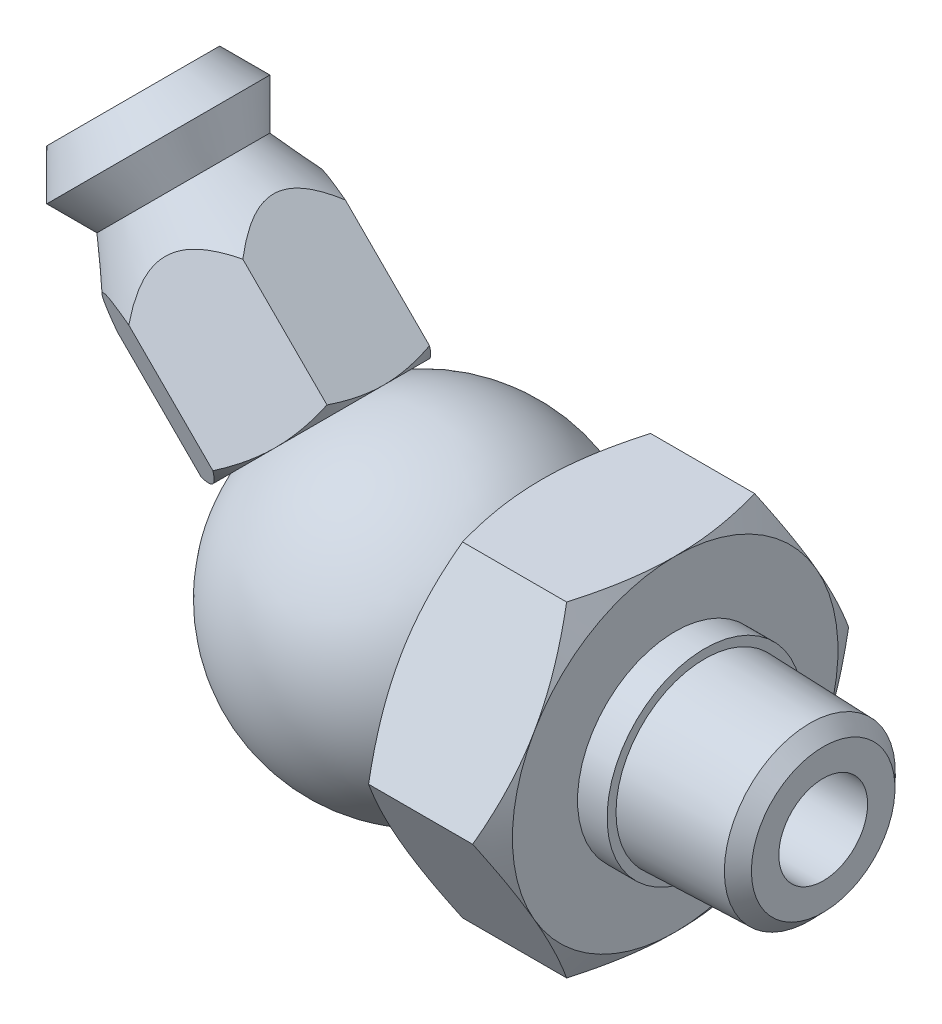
ISO-10303-21;
HEADER;
FILE_DESCRIPTION(('STEP AP214'),'2;1');
FILE_NAME('part.step','',(''),(''),'','','');
FILE_SCHEMA(('AUTOMOTIVE_DESIGN { 1 0 10303 214 1 1 1 1 }'));
ENDSEC;
DATA;
#1=APPLICATION_CONTEXT('core data for automotive mechanical design processes');
#2=APPLICATION_PROTOCOL_DEFINITION('international standard','automotive_design',2000,#1);
#3=PRODUCT_CONTEXT('',#1,'mechanical');
#4=PRODUCT('Part','Part','',(#3));
#5=PRODUCT_RELATED_PRODUCT_CATEGORY('part','',(#4));
#6=PRODUCT_DEFINITION_FORMATION('','',#4);
#7=PRODUCT_DEFINITION_CONTEXT('part definition',#1,'design');
#8=PRODUCT_DEFINITION('design','',#6,#7);
#9=PRODUCT_DEFINITION_SHAPE('','',#8);
#10=(LENGTH_UNIT() NAMED_UNIT(*) SI_UNIT(.MILLI.,.METRE.));
#11=(NAMED_UNIT(*) PLANE_ANGLE_UNIT() SI_UNIT($,.RADIAN.));
#12=(NAMED_UNIT(*) SI_UNIT($,.STERADIAN.) SOLID_ANGLE_UNIT());
#13=UNCERTAINTY_MEASURE_WITH_UNIT(LENGTH_MEASURE(1.E-05),#10,'distance_accuracy_value','');
#14=(GEOMETRIC_REPRESENTATION_CONTEXT(3) GLOBAL_UNCERTAINTY_ASSIGNED_CONTEXT((#13)) GLOBAL_UNIT_ASSIGNED_CONTEXT((#10,
#11,#12)) REPRESENTATION_CONTEXT('',''));
#15=CARTESIAN_POINT('',(0.,0.,0.));
#16=DIRECTION('',(0.,0.,1.));
#17=DIRECTION('',(1.,0.,0.));
#18=AXIS2_PLACEMENT_3D('',#15,#16,#17);
#19=CARTESIAN_POINT('',(4.,1.2125,0.));
#20=DIRECTION('',(1.,0.,0.));
#21=DIRECTION('',(0.,0.,-1.));
#22=AXIS2_PLACEMENT_3D('',#19,#20,#21);
#23=PLANE('',#22);
#24=CARTESIAN_POINT('',(4.,0.,0.));
#25=DIRECTION('',(1.,0.,0.));
#26=DIRECTION('',(0.,0.,-1.));
#27=AXIS2_PLACEMENT_3D('',#24,#25,#26);
#28=CIRCLE('',#27,1.5);
#29=CARTESIAN_POINT('',(4.,0.,-1.5));
#30=VERTEX_POINT('',#29);
#31=EDGE_CURVE('E1101',#30,#30,#28,.T.);
#32=ORIENTED_EDGE('',*,*,#31,.F.);
#33=EDGE_LOOP('',(#32));
#34=FACE_BOUND('',#33,.T.);
#35=CARTESIAN_POINT('',(4.00000000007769,0.,0.));
#36=DIRECTION('',(-1.,0.,0.));
#37=DIRECTION('',(0.,0.,1.));
#38=AXIS2_PLACEMENT_3D('',#35,#36,#37);
#39=CIRCLE('',#38,2.42500000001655);
#40=CARTESIAN_POINT('',(4.00000000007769,0.,2.42500000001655));
#41=VERTEX_POINT('',#40);
#42=EDGE_CURVE('E706',#41,#41,#39,.T.);
#43=ORIENTED_EDGE('',*,*,#42,.F.);
#44=EDGE_LOOP('',(#43));
#45=FACE_BOUND('',#44,.T.);
#46=ADVANCED_FACE('F31',(#34,#45),#23,.T.);
#47=CARTESIAN_POINT('',(3.55021956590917,0.,0.));
#48=DIRECTION('',(-1.,0.,0.));
#49=DIRECTION('',(0.,0.,1.));
#50=AXIS2_PLACEMENT_3D('',#47,#48,#49);
#51=CONICAL_SURFACE('',#50,2.88905563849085,0.801018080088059);
#52=CARTESIAN_POINT('',(3.55021956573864,0.,0.));
#53=DIRECTION('',(-1.,0.,0.));
#54=DIRECTION('',(0.,1.,0.));
#55=AXIS2_PLACEMENT_3D('',#52,#53,#54);
#56=CIRCLE('',#55,2.889055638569);
#57=CARTESIAN_POINT('',(3.55021956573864,2.889055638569,0.));
#58=VERTEX_POINT('',#57);
#59=EDGE_CURVE('E439',#58,#58,#56,.T.);
#60=ORIENTED_EDGE('',*,*,#59,.F.);
#61=EDGE_LOOP('',(#60));
#62=FACE_BOUND('',#61,.T.);
#63=ORIENTED_EDGE('',*,*,#42,.T.);
#64=EDGE_LOOP('',(#63));
#65=FACE_BOUND('',#64,.T.);
#66=ADVANCED_FACE('F1051',(#62,#65),#51,.T.);
#67=CARTESIAN_POINT('',(0.,0.,0.));
#68=DIRECTION('',(-1.,0.,0.));
#69=DIRECTION('',(0.,0.,1.));
#70=AXIS2_PLACEMENT_3D('',#67,#68,#69);
#71=CONICAL_SURFACE('',#70,3.00000000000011,0.0312398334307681);
#72=CARTESIAN_POINT('',(0.,0.,0.));
#73=DIRECTION('',(-1.,0.,0.));
#74=DIRECTION('',(0.,0.,1.));
#75=AXIS2_PLACEMENT_3D('',#72,#73,#74);
#76=CIRCLE('',#75,3.00000000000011);
#77=CARTESIAN_POINT('',(0.,0.,3.00000000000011));
#78=VERTEX_POINT('',#77);
#79=EDGE_CURVE('E1107',#78,#78,#76,.T.);
#80=ORIENTED_EDGE('',*,*,#79,.F.);
#81=EDGE_LOOP('',(#80));
#82=FACE_BOUND('',#81,.T.);
#83=ORIENTED_EDGE('',*,*,#59,.T.);
#84=EDGE_LOOP('',(#83));
#85=FACE_BOUND('',#84,.T.);
#86=ADVANCED_FACE('F1041',(#82,#85),#71,.T.);
#87=CARTESIAN_POINT('',(0.,3.15,0.));
#88=DIRECTION('',(1.,0.,0.));
#89=DIRECTION('',(0.,0.,-1.));
#90=AXIS2_PLACEMENT_3D('',#87,#88,#89);
#91=PLANE('',#90);
#92=ORIENTED_EDGE('',*,*,#79,.T.);
#93=EDGE_LOOP('',(#92));
#94=FACE_BOUND('',#93,.T.);
#95=CARTESIAN_POINT('',(0.,0.,0.));
#96=DIRECTION('',(1.,0.,0.));
#97=DIRECTION('',(0.,0.,-1.));
#98=AXIS2_PLACEMENT_3D('',#95,#96,#97);
#99=CIRCLE('',#98,3.3);
#100=CARTESIAN_POINT('',(0.,0.,-3.3));
#101=VERTEX_POINT('',#100);
#102=EDGE_CURVE('E1152',#101,#101,#99,.F.);
#103=ORIENTED_EDGE('',*,*,#102,.F.);
#104=EDGE_LOOP('',(#103));
#105=FACE_BOUND('',#104,.T.);
#106=ADVANCED_FACE('F1031',(#94,#105),#91,.T.);
#107=CARTESIAN_POINT('',(-20.1551020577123,8.96711112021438,0.));
#108=DIRECTION('',(-0.707106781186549,0.707106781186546,0.));
#109=DIRECTION('',(-0.707106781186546,-0.707106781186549,0.));
#110=AXIS2_PLACEMENT_3D('',#107,#108,#109);
#111=PLANE('',#110);
#112=CARTESIAN_POINT('',(-19.3111065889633,9.81110658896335,0.));
#113=DIRECTION('',(-0.707106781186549,0.707106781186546,0.));
#114=DIRECTION('',(-0.707106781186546,-0.707106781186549,0.));
#115=AXIS2_PLACEMENT_3D('',#112,#113,#114);
#116=CIRCLE('',#115,1.25);
#117=CARTESIAN_POINT('',(-20.1949900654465,8.92722311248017,0.));
#118=VERTEX_POINT('',#117);
#119=EDGE_CURVE('E703',#118,#118,#116,.T.);
#120=ORIENTED_EDGE('',*,*,#119,.F.);
#121=EDGE_LOOP('',(#120));
#122=FACE_BOUND('',#121,.T.);
#123=CARTESIAN_POINT('',(-19.3111065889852,9.81110658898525,0.));
#124=DIRECTION('',(0.707106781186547,-0.707106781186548,0.));
#125=DIRECTION('',(0.707106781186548,0.707106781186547,0.));
#126=AXIS2_PLACEMENT_3D('',#123,#124,#125);
#127=CIRCLE('',#126,2.38717967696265);
#128=CARTESIAN_POINT('',(-17.6231156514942,11.4990975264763,0.));
#129=VERTEX_POINT('',#128);
#130=EDGE_CURVE('E1148',#129,#129,#127,.T.);
#131=ORIENTED_EDGE('',*,*,#130,.F.);
#132=EDGE_LOOP('',(#131));
#133=FACE_BOUND('',#132,.T.);
#134=ADVANCED_FACE('F1020',(#122,#133),#111,.T.);
#135=CARTESIAN_POINT('',(-0.5,0.,0.));
#136=DIRECTION('',(1.,0.,0.));
#137=DIRECTION('',(0.,0.,-1.));
#138=AXIS2_PLACEMENT_3D('',#135,#136,#137);
#139=CYLINDRICAL_SURFACE('',#138,3.3);
#140=CARTESIAN_POINT('',(-1.,0.,0.));
#141=DIRECTION('',(1.,0.,0.));
#142=DIRECTION('',(0.,0.,-1.));
#143=AXIS2_PLACEMENT_3D('',#140,#141,#142);
#144=CIRCLE('',#143,3.3);
#145=CARTESIAN_POINT('',(-1.,0.,-3.3));
#146=VERTEX_POINT('',#145);
#147=EDGE_CURVE('E1144',#146,#146,#144,.F.);
#148=ORIENTED_EDGE('',*,*,#147,.F.);
#149=EDGE_LOOP('',(#148));
#150=FACE_BOUND('',#149,.T.);
#151=ORIENTED_EDGE('',*,*,#102,.T.);
#152=EDGE_LOOP('',(#151));
#153=FACE_BOUND('',#152,.T.);
#154=ADVANCED_FACE('F1010',(#150,#153),#139,.T.);
#155=CARTESIAN_POINT('',(-18.4625784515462,8.96257845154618,0.));
#156=DIRECTION('',(0.707106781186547,-0.707106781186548,0.));
#157=DIRECTION('',(0.707106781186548,0.707106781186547,0.));
#158=AXIS2_PLACEMENT_3D('',#155,#156,#157);
#159=CONICAL_SURFACE('',#158,3.07999999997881,0.523598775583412);
#160=CARTESIAN_POINT('',(-18.462578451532,8.96257845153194,0.));
#161=DIRECTION('',(-0.707106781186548,0.707106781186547,0.));
#162=DIRECTION('',(-0.707106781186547,-0.707106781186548,0.));
#163=AXIS2_PLACEMENT_3D('',#160,#161,#162);
#164=CIRCLE('',#163,3.07999999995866);
#165=CARTESIAN_POINT('',(-20.6404673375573,6.7846895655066,0.));
#166=VERTEX_POINT('',#165);
#167=EDGE_CURVE('E223',#166,#166,#164,.F.);
#168=ORIENTED_EDGE('',*,*,#167,.F.);
#169=EDGE_LOOP('',(#168));
#170=FACE_BOUND('',#169,.T.);
#171=ORIENTED_EDGE('',*,*,#130,.T.);
#172=EDGE_LOOP('',(#171));
#173=FACE_BOUND('',#172,.T.);
#174=ADVANCED_FACE('F1001',(#170,#173),#159,.T.);
#175=CARTESIAN_POINT('',(-1.,4.4,0.));
#176=DIRECTION('',(1.,0.,0.));
#177=DIRECTION('',(0.,1.,0.));
#178=AXIS2_PLACEMENT_3D('',#175,#176,#177);
#179=PLANE('',#178);
#180=ORIENTED_EDGE('',*,*,#147,.T.);
#181=EDGE_LOOP('',(#180));
#182=FACE_BOUND('',#181,.T.);
#183=CARTESIAN_POINT('',(-1.0000000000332,0.,0.));
#184=DIRECTION('',(-1.,0.,0.));
#185=DIRECTION('',(0.,0.,1.));
#186=AXIS2_PLACEMENT_3D('',#183,#184,#185);
#187=CIRCLE('',#186,5.50000000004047);
#188=CARTESIAN_POINT('',(-1.00000000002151,-2.75000000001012,-4.76313972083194));
#189=VERTEX_POINT('',#188);
#190=CARTESIAN_POINT('',(-1.00000000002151,-5.50000000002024,0.));
#191=VERTEX_POINT('',#190);
#192=EDGE_CURVE('E194',#189,#191,#187,.T.);
#193=ORIENTED_EDGE('',*,*,#192,.F.);
#194=CARTESIAN_POINT('',(-1.0000000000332,0.,0.));
#195=DIRECTION('',(-1.,0.,0.));
#196=DIRECTION('',(0.,0.,1.));
#197=AXIS2_PLACEMENT_3D('',#194,#195,#196);
#198=CIRCLE('',#197,5.50000000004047);
#199=CARTESIAN_POINT('',(-1.00000000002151,2.75000000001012,-4.76313972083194));
#200=VERTEX_POINT('',#199);
#201=EDGE_CURVE('E198',#200,#189,#198,.T.);
#202=ORIENTED_EDGE('',*,*,#201,.F.);
#203=CARTESIAN_POINT('',(-1.0000000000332,0.,0.));
#204=DIRECTION('',(-1.,0.,0.));
#205=DIRECTION('',(0.,0.,1.));
#206=AXIS2_PLACEMENT_3D('',#203,#204,#205);
#207=CIRCLE('',#206,5.50000000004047);
#208=CARTESIAN_POINT('',(-1.00000000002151,5.50000000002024,0.));
#209=VERTEX_POINT('',#208);
#210=EDGE_CURVE('E1142',#209,#200,#207,.T.);
#211=ORIENTED_EDGE('',*,*,#210,.F.);
#212=CARTESIAN_POINT('',(-1.0000000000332,0.,0.));
#213=DIRECTION('',(-1.,0.,0.));
#214=DIRECTION('',(0.,0.,1.));
#215=AXIS2_PLACEMENT_3D('',#212,#213,#214);
#216=CIRCLE('',#215,5.50000000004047);
#217=CARTESIAN_POINT('',(-1.00000000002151,2.75000000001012,4.76313972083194));
#218=VERTEX_POINT('',#217);
#219=EDGE_CURVE('E1166',#218,#209,#216,.T.);
#220=ORIENTED_EDGE('',*,*,#219,.F.);
#221=CARTESIAN_POINT('',(-1.0000000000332,0.,0.));
#222=DIRECTION('',(-1.,0.,0.));
#223=DIRECTION('',(0.,0.,1.));
#224=AXIS2_PLACEMENT_3D('',#221,#222,#223);
#225=CIRCLE('',#224,5.50000000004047);
#226=CARTESIAN_POINT('',(-1.00000000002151,-2.75000000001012,4.76313972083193));
#227=VERTEX_POINT('',#226);
#228=EDGE_CURVE('E1164',#227,#218,#225,.T.);
#229=ORIENTED_EDGE('',*,*,#228,.F.);
#230=CARTESIAN_POINT('',(-1.0000000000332,0.,0.));
#231=DIRECTION('',(-1.,0.,0.));
#232=DIRECTION('',(0.,0.,1.));
#233=AXIS2_PLACEMENT_3D('',#230,#231,#232);
#234=CIRCLE('',#233,5.50000000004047);
#235=EDGE_CURVE('E201',#191,#227,#234,.T.);
#236=ORIENTED_EDGE('',*,*,#235,.F.);
#237=EDGE_LOOP('',(#193,#202,#211,#220,#229,#236));
#238=FACE_BOUND('',#237,.T.);
#239=ADVANCED_FACE('F196',(#182,#238),#179,.T.);
#240=CARTESIAN_POINT('',(-18.4625784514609,8.96257845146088,0.));
#241=DIRECTION('',(-0.707106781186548,0.707106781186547,0.));
#242=DIRECTION('',(-0.707106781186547,-0.707106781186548,0.));
#243=AXIS2_PLACEMENT_3D('',#240,#241,#242);
#244=CONICAL_SURFACE('',#243,3.07999999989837,0.523598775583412);
#245=CARTESIAN_POINT('',(-17.6140503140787,8.11405031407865,0.));
#246=DIRECTION('',(0.707106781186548,-0.707106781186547,0.));
#247=DIRECTION('',(-0.707106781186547,-0.707106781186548,0.));
#248=AXIS2_PLACEMENT_3D('',#245,#246,#247);
#249=CIRCLE('',#248,2.3871796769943);
#250=CARTESIAN_POINT('',(-19.3020412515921,6.42605937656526,0.));
#251=VERTEX_POINT('',#250);
#252=EDGE_CURVE('E1140',#251,#251,#249,.T.);
#253=ORIENTED_EDGE('',*,*,#252,.F.);
#254=EDGE_LOOP('',(#253));
#255=FACE_BOUND('',#254,.T.);
#256=ORIENTED_EDGE('',*,*,#167,.T.);
#257=EDGE_LOOP('',(#256));
#258=FACE_BOUND('',#257,.T.);
#259=ADVANCED_FACE('F253',(#255,#258),#244,.T.);
#260=CARTESIAN_POINT('',(-1.49418762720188,0.,0.));
#261=DIRECTION('',(-1.,0.,0.));
#262=DIRECTION('',(0.,0.,1.));
#263=AXIS2_PLACEMENT_3D('',#260,#261,#262);
#264=CONICAL_SURFACE('',#263,6.35595807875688,1.0471975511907);
#265=ORIENTED_EDGE('',*,*,#201,.T.);
#266=CARTESIAN_POINT('',(-1.00000000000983,-2.75,-4.76313972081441));
#267=CARTESIAN_POINT('',(-0.999977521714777,-2.63327792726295,-4.83052924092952));
#268=CARTESIAN_POINT('',(-1.00285976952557,-2.51656147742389,-4.89791551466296));
#269=CARTESIAN_POINT('',(-1.01426664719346,-2.2833577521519,-5.03255574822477));
#270=CARTESIAN_POINT('',(-1.02279016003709,-2.16687043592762,-5.09980973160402));
#271=CARTESIAN_POINT('',(-1.04525637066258,-1.93487739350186,-5.23375097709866));
#272=CARTESIAN_POINT('',(-1.05917178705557,-1.81936967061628,-5.30043939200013));
#273=CARTESIAN_POINT('',(-1.09212247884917,-1.58890454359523,-5.43349849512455));
#274=CARTESIAN_POINT('',(-1.11115788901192,-1.47394715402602,-5.49986917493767));
#275=CARTESIAN_POINT('',(-1.17535605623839,-1.1303769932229,-5.69822949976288));
#276=CARTESIAN_POINT('',(-1.22764192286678,-0.902762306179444,-5.82964290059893));
#277=CARTESIAN_POINT('',(-1.34822650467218,-0.449490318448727,-6.09133960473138));
#278=CARTESIAN_POINT('',(-1.41660519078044,-0.22384882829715,-6.22161377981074));
#279=CARTESIAN_POINT('',(-1.49124018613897,-3.81216260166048E-12,-6.35085296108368));
#280=B_SPLINE_CURVE_WITH_KNOTS('',3,(#266,#267,#268,#269,#270,#271,#272,#273,#274,#275,#276,
#277,#278,#279),.UNSPECIFIED.,.F.,.F.,(4,2,2,2,2,2,4),(0.,0.404295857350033,0.808511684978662,
1.2107084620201,1.61291582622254,2.41627637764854,3.2237167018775),.UNSPECIFIED.);
#281=CARTESIAN_POINT('',(-1.49124018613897,0.,-6.35085296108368));
#282=VERTEX_POINT('',#281);
#283=EDGE_CURVE('E213',#189,#282,#280,.T.);
#284=ORIENTED_EDGE('',*,*,#283,.T.);
#285=CARTESIAN_POINT('',(-1.49124018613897,3.81302813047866E-12,-6.35085296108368));
#286=CARTESIAN_POINT('',(-1.41660519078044,0.223848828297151,-6.22161377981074));
#287=CARTESIAN_POINT('',(-1.34822650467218,0.449490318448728,-6.09133960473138));
#288=CARTESIAN_POINT('',(-1.22764192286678,0.902762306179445,-5.82964290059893));
#289=CARTESIAN_POINT('',(-1.17535605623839,1.1303769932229,-5.69822949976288));
#290=CARTESIAN_POINT('',(-1.11115788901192,1.47394715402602,-5.49986917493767));
#291=CARTESIAN_POINT('',(-1.09212247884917,1.58890454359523,-5.43349849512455));
#292=CARTESIAN_POINT('',(-1.05917178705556,1.81936967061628,-5.30043939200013));
#293=CARTESIAN_POINT('',(-1.04525637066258,1.93487739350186,-5.23375097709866));
#294=CARTESIAN_POINT('',(-1.02279016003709,2.16687043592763,-5.09980973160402));
#295=CARTESIAN_POINT('',(-1.01426664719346,2.2833577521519,-5.03255574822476));
#296=CARTESIAN_POINT('',(-1.00285976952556,2.51656147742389,-4.89791551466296));
#297=CARTESIAN_POINT('',(-0.999977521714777,2.63327792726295,-4.83052924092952));
#298=CARTESIAN_POINT('',(-1.00000000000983,2.75,-4.76313972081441));
#299=B_SPLINE_CURVE_WITH_KNOTS('',3,(#285,#286,#287,#288,#289,#290,#291,#292,#293,#294,#295,
#296,#297,#298),.UNSPECIFIED.,.F.,.F.,(4,2,2,2,2,2,4),(0.,0.807440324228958,1.61080087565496,
2.0130082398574,2.41520501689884,2.81942084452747,3.2237167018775),.UNSPECIFIED.);
#300=EDGE_CURVE('E221',#282,#200,#299,.T.);
#301=ORIENTED_EDGE('',*,*,#300,.T.);
#302=EDGE_LOOP('',(#265,#284,#301));
#303=FACE_BOUND('',#302,.T.);
#304=ADVANCED_FACE('F219',(#303),#264,.T.);
#305=CARTESIAN_POINT('',(-1.49418762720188,0.,0.));
#306=DIRECTION('',(-1.,0.,0.));
#307=DIRECTION('',(0.,0.,1.));
#308=AXIS2_PLACEMENT_3D('',#305,#306,#307);
#309=CONICAL_SURFACE('',#308,6.35595807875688,1.0471975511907);
#310=ORIENTED_EDGE('',*,*,#192,.T.);
#311=CARTESIAN_POINT('',(-1.00000000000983,-5.5,0.));
#312=CARTESIAN_POINT('',(-0.999977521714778,-5.5,-0.134779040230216));
#313=CARTESIAN_POINT('',(-1.00285976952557,-5.5,-0.269551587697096));
#314=CARTESIAN_POINT('',(-1.01426664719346,-5.5,-0.538832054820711));
#315=CARTESIAN_POINT('',(-1.02279016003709,-5.5,-0.673340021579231));
#316=CARTESIAN_POINT('',(-1.04525637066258,-5.5,-0.941222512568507));
#317=CARTESIAN_POINT('',(-1.05917178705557,-5.5,-1.07459934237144));
#318=CARTESIAN_POINT('',(-1.09212247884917,-5.5,-1.34071754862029));
#319=CARTESIAN_POINT('',(-1.11115788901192,-5.5,-1.47345890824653));
#320=CARTESIAN_POINT('',(-1.17535605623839,-5.5,-1.87017955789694));
#321=CARTESIAN_POINT('',(-1.22764192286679,-5.5,-2.13300635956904));
#322=CARTESIAN_POINT('',(-1.34822650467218,-5.5,-2.65639976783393));
#323=CARTESIAN_POINT('',(-1.41660519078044,-5.5,-2.91694811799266));
#324=CARTESIAN_POINT('',(-1.49124018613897,-5.5,-3.17542648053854));
#325=B_SPLINE_CURVE_WITH_KNOTS('',3,(#311,#312,#313,#314,#315,#316,#317,#318,#319,#320,#321,
#322,#323,#324),.UNSPECIFIED.,.F.,.F.,(4,2,2,2,2,2,4),(0.,0.404295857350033,0.808511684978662,
1.2107084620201,1.61291582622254,2.41627637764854,3.2237167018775),.UNSPECIFIED.);
#326=CARTESIAN_POINT('',(-1.49124018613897,-5.49999999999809,-3.17542648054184));
#327=VERTEX_POINT('',#326);
#328=EDGE_CURVE('E209',#191,#327,#325,.T.);
#329=ORIENTED_EDGE('',*,*,#328,.T.);
#330=CARTESIAN_POINT('',(-1.49124018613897,-5.49999999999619,-3.17542648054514));
#331=CARTESIAN_POINT('',(-1.41660519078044,-5.27615117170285,-3.30466566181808));
#332=CARTESIAN_POINT('',(-1.34822650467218,-5.05050968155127,-3.43493983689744));
#333=CARTESIAN_POINT('',(-1.22764192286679,-4.59723769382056,-3.69663654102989));
#334=CARTESIAN_POINT('',(-1.17535605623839,-4.3696230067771,-3.82804994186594));
#335=CARTESIAN_POINT('',(-1.11115788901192,-4.02605284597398,-4.02641026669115));
#336=CARTESIAN_POINT('',(-1.09212247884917,-3.91109545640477,-4.09278094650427));
#337=CARTESIAN_POINT('',(-1.05917178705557,-3.68063032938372,-4.22584004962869));
#338=CARTESIAN_POINT('',(-1.04525637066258,-3.56512260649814,-4.29252846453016));
#339=CARTESIAN_POINT('',(-1.02279016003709,-3.33312956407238,-4.4264697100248));
#340=CARTESIAN_POINT('',(-1.01426664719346,-3.2166422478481,-4.49372369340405));
#341=CARTESIAN_POINT('',(-1.00285976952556,-2.98343852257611,-4.62836392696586));
#342=CARTESIAN_POINT('',(-0.999977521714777,-2.86672207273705,-4.6957502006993));
#343=CARTESIAN_POINT('',(-1.00000000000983,-2.75,-4.76313972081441));
#344=B_SPLINE_CURVE_WITH_KNOTS('',3,(#330,#331,#332,#333,#334,#335,#336,#337,#338,#339,#340,
#341,#342,#343),.UNSPECIFIED.,.F.,.F.,(4,2,2,2,2,2,4),(0.,0.807440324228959,1.61080087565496,
2.0130082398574,2.41520501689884,2.81942084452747,3.2237167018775),.UNSPECIFIED.);
#345=EDGE_CURVE('E207',#327,#189,#344,.T.);
#346=ORIENTED_EDGE('',*,*,#345,.T.);
#347=EDGE_LOOP('',(#310,#329,#346));
#348=FACE_BOUND('',#347,.T.);
#349=ADVANCED_FACE('F208',(#348),#309,.T.);
#350=CARTESIAN_POINT('',(-1.49418762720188,0.,0.));
#351=DIRECTION('',(-1.,0.,0.));
#352=DIRECTION('',(0.,0.,1.));
#353=AXIS2_PLACEMENT_3D('',#350,#351,#352);
#354=CONICAL_SURFACE('',#353,6.35595807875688,1.0471975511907);
#355=ORIENTED_EDGE('',*,*,#235,.T.);
#356=CARTESIAN_POINT('',(-1.00000000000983,-2.75,4.76313972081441));
#357=CARTESIAN_POINT('',(-0.999977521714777,-2.86672207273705,4.6957502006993));
#358=CARTESIAN_POINT('',(-1.00285976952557,-2.98343852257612,4.62836392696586));
#359=CARTESIAN_POINT('',(-1.01426664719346,-3.21664224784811,4.49372369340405));
#360=CARTESIAN_POINT('',(-1.02279016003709,-3.33312956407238,4.42646971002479));
#361=CARTESIAN_POINT('',(-1.04525637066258,-3.56512260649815,4.29252846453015));
#362=CARTESIAN_POINT('',(-1.05917178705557,-3.68063032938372,4.22584004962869));
#363=CARTESIAN_POINT('',(-1.09212247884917,-3.91109545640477,4.09278094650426));
#364=CARTESIAN_POINT('',(-1.11115788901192,-4.02605284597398,4.02641026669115));
#365=CARTESIAN_POINT('',(-1.17535605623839,-4.3696230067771,3.82804994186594));
#366=CARTESIAN_POINT('',(-1.22764192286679,-4.59723769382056,3.69663654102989));
#367=CARTESIAN_POINT('',(-1.34822650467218,-5.05050968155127,3.43493983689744));
#368=CARTESIAN_POINT('',(-1.41660519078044,-5.27615117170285,3.30466566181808));
#369=CARTESIAN_POINT('',(-1.49124018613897,-5.49999999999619,3.17542648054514));
#370=B_SPLINE_CURVE_WITH_KNOTS('',3,(#356,#357,#358,#359,#360,#361,#362,#363,#364,#365,#366,
#367,#368,#369),.UNSPECIFIED.,.F.,.F.,(4,2,2,2,2,2,4),(0.,0.404295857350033,0.808511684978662,
1.2107084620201,1.61291582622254,2.41627637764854,3.2237167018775),.UNSPECIFIED.);
#371=CARTESIAN_POINT('',(-1.49124018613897,-5.49999999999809,3.17542648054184));
#372=VERTEX_POINT('',#371);
#373=EDGE_CURVE('E616',#227,#372,#370,.T.);
#374=ORIENTED_EDGE('',*,*,#373,.T.);
#375=CARTESIAN_POINT('',(-1.49124018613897,-5.5,3.17542648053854));
#376=CARTESIAN_POINT('',(-1.41660519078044,-5.5,2.91694811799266));
#377=CARTESIAN_POINT('',(-1.34822650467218,-5.5,2.65639976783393));
#378=CARTESIAN_POINT('',(-1.22764192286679,-5.5,2.13300635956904));
#379=CARTESIAN_POINT('',(-1.17535605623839,-5.5,1.87017955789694));
#380=CARTESIAN_POINT('',(-1.11115788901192,-5.5,1.47345890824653));
#381=CARTESIAN_POINT('',(-1.09212247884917,-5.5,1.34071754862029));
#382=CARTESIAN_POINT('',(-1.05917178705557,-5.5,1.07459934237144));
#383=CARTESIAN_POINT('',(-1.04525637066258,-5.5,0.941222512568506));
#384=CARTESIAN_POINT('',(-1.02279016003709,-5.5,0.673340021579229));
#385=CARTESIAN_POINT('',(-1.01426664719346,-5.5,0.53883205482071));
#386=CARTESIAN_POINT('',(-1.00285976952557,-5.5,0.269551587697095));
#387=CARTESIAN_POINT('',(-0.999977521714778,-5.5,0.134779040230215));
#388=CARTESIAN_POINT('',(-1.00000000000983,-5.5,0.));
#389=B_SPLINE_CURVE_WITH_KNOTS('',3,(#375,#376,#377,#378,#379,#380,#381,#382,#383,#384,#385,
#386,#387,#388),.UNSPECIFIED.,.F.,.F.,(4,2,2,2,2,2,4),(0.,0.807440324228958,1.61080087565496,
2.0130082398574,2.41520501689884,2.81942084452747,3.2237167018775),.UNSPECIFIED.);
#390=EDGE_CURVE('E229',#372,#191,#389,.T.);
#391=ORIENTED_EDGE('',*,*,#390,.T.);
#392=EDGE_LOOP('',(#355,#374,#391));
#393=FACE_BOUND('',#392,.T.);
#394=ADVANCED_FACE('F852',(#393),#354,.T.);
#395=CARTESIAN_POINT('',(-1.49418762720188,0.,0.));
#396=DIRECTION('',(-1.,0.,0.));
#397=DIRECTION('',(0.,0.,1.));
#398=AXIS2_PLACEMENT_3D('',#395,#396,#397);
#399=CONICAL_SURFACE('',#398,6.35595807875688,1.0471975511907);
#400=CARTESIAN_POINT('',(-1.49124018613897,-3.81302813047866E-12,6.35085296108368));
#401=CARTESIAN_POINT('',(-1.41660519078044,-0.223848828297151,6.22161377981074));
#402=CARTESIAN_POINT('',(-1.34822650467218,-0.449490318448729,6.09133960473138));
#403=CARTESIAN_POINT('',(-1.22764192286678,-0.902762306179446,5.82964290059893));
#404=CARTESIAN_POINT('',(-1.17535605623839,-1.1303769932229,5.69822949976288));
#405=CARTESIAN_POINT('',(-1.11115788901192,-1.47394715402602,5.49986917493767));
#406=CARTESIAN_POINT('',(-1.09212247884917,-1.58890454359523,5.43349849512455));
#407=CARTESIAN_POINT('',(-1.05917178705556,-1.81936967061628,5.30043939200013));
#408=CARTESIAN_POINT('',(-1.04525637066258,-1.93487739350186,5.23375097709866));
#409=CARTESIAN_POINT('',(-1.02279016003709,-2.16687043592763,5.09980973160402));
#410=CARTESIAN_POINT('',(-1.01426664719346,-2.2833577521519,5.03255574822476));
#411=CARTESIAN_POINT('',(-1.00285976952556,-2.51656147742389,4.89791551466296));
#412=CARTESIAN_POINT('',(-0.999977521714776,-2.63327792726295,4.83052924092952));
#413=CARTESIAN_POINT('',(-1.00000000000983,-2.75,4.76313972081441));
#414=B_SPLINE_CURVE_WITH_KNOTS('',3,(#400,#401,#402,#403,#404,#405,#406,#407,#408,#409,#410,
#411,#412,#413),.UNSPECIFIED.,.F.,.F.,(4,2,2,2,2,2,4),(0.,0.807440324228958,1.61080087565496,
2.0130082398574,2.41520501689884,2.81942084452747,3.2237167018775),.UNSPECIFIED.);
#415=CARTESIAN_POINT('',(-1.49124018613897,0.,6.35085296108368));
#416=VERTEX_POINT('',#415);
#417=EDGE_CURVE('E621',#416,#227,#414,.T.);
#418=ORIENTED_EDGE('',*,*,#417,.T.);
#419=ORIENTED_EDGE('',*,*,#228,.T.);
#420=CARTESIAN_POINT('',(-1.00000000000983,2.75,4.76313972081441));
#421=CARTESIAN_POINT('',(-0.999977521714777,2.63327792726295,4.83052924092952));
#422=CARTESIAN_POINT('',(-1.00285976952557,2.51656147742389,4.89791551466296));
#423=CARTESIAN_POINT('',(-1.01426664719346,2.28335775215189,5.03255574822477));
#424=CARTESIAN_POINT('',(-1.02279016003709,2.16687043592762,5.09980973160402));
#425=CARTESIAN_POINT('',(-1.04525637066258,1.93487739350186,5.23375097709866));
#426=CARTESIAN_POINT('',(-1.05917178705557,1.81936967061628,5.30043939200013));
#427=CARTESIAN_POINT('',(-1.09212247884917,1.58890454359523,5.43349849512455));
#428=CARTESIAN_POINT('',(-1.11115788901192,1.47394715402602,5.49986917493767));
#429=CARTESIAN_POINT('',(-1.17535605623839,1.1303769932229,5.69822949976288));
#430=CARTESIAN_POINT('',(-1.22764192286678,0.902762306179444,5.82964290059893));
#431=CARTESIAN_POINT('',(-1.34822650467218,0.449490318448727,6.09133960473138));
#432=CARTESIAN_POINT('',(-1.41660519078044,0.223848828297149,6.22161377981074));
#433=CARTESIAN_POINT('',(-1.49124018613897,3.81197303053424E-12,6.35085296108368));
#434=B_SPLINE_CURVE_WITH_KNOTS('',3,(#420,#421,#422,#423,#424,#425,#426,#427,#428,#429,#430,
#431,#432,#433),.UNSPECIFIED.,.F.,.F.,(4,2,2,2,2,2,4),(0.,0.404295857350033,0.808511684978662,
1.2107084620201,1.61291582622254,2.41627637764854,3.2237167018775),.UNSPECIFIED.);
#435=EDGE_CURVE('E611',#218,#416,#434,.T.);
#436=ORIENTED_EDGE('',*,*,#435,.T.);
#437=EDGE_LOOP('',(#418,#419,#436));
#438=FACE_BOUND('',#437,.T.);
#439=ADVANCED_FACE('F594',(#438),#399,.T.);
#440=CARTESIAN_POINT('',(-1.49418762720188,0.,0.));
#441=DIRECTION('',(-1.,0.,0.));
#442=DIRECTION('',(0.,0.,1.));
#443=AXIS2_PLACEMENT_3D('',#440,#441,#442);
#444=CONICAL_SURFACE('',#443,6.35595807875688,1.0471975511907);
#445=CARTESIAN_POINT('',(-1.49124018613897,5.49999999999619,3.17542648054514));
#446=CARTESIAN_POINT('',(-1.41660519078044,5.27615117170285,3.30466566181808));
#447=CARTESIAN_POINT('',(-1.34822650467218,5.05050968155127,3.43493983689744));
#448=CARTESIAN_POINT('',(-1.22764192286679,4.59723769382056,3.69663654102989));
#449=CARTESIAN_POINT('',(-1.17535605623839,4.3696230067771,3.82804994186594));
#450=CARTESIAN_POINT('',(-1.11115788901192,4.02605284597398,4.02641026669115));
#451=CARTESIAN_POINT('',(-1.09212247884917,3.91109545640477,4.09278094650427));
#452=CARTESIAN_POINT('',(-1.05917178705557,3.68063032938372,4.22584004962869));
#453=CARTESIAN_POINT('',(-1.04525637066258,3.56512260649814,4.29252846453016));
#454=CARTESIAN_POINT('',(-1.02279016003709,3.33312956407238,4.4264697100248));
#455=CARTESIAN_POINT('',(-1.01426664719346,3.2166422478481,4.49372369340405));
#456=CARTESIAN_POINT('',(-1.00285976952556,2.98343852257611,4.62836392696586));
#457=CARTESIAN_POINT('',(-0.999977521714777,2.86672207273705,4.6957502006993));
#458=CARTESIAN_POINT('',(-1.00000000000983,2.75,4.76313972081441));
#459=B_SPLINE_CURVE_WITH_KNOTS('',3,(#445,#446,#447,#448,#449,#450,#451,#452,#453,#454,#455,
#456,#457,#458),.UNSPECIFIED.,.F.,.F.,(4,2,2,2,2,2,4),(0.,0.807440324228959,1.61080087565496,
2.0130082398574,2.41520501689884,2.81942084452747,3.2237167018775),.UNSPECIFIED.);
#460=CARTESIAN_POINT('',(-1.49124018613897,5.49999999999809,3.17542648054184));
#461=VERTEX_POINT('',#460);
#462=EDGE_CURVE('E599',#461,#218,#459,.T.);
#463=ORIENTED_EDGE('',*,*,#462,.T.);
#464=ORIENTED_EDGE('',*,*,#219,.T.);
#465=CARTESIAN_POINT('',(-1.00000000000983,5.5,0.));
#466=CARTESIAN_POINT('',(-0.999977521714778,5.5,0.134779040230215));
#467=CARTESIAN_POINT('',(-1.00285976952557,5.5,0.269551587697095));
#468=CARTESIAN_POINT('',(-1.01426664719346,5.5,0.53883205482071));
#469=CARTESIAN_POINT('',(-1.02279016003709,5.5,0.673340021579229));
#470=CARTESIAN_POINT('',(-1.04525637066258,5.5,0.941222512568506));
#471=CARTESIAN_POINT('',(-1.05917178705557,5.5,1.07459934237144));
#472=CARTESIAN_POINT('',(-1.09212247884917,5.5,1.34071754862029));
#473=CARTESIAN_POINT('',(-1.11115788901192,5.5,1.47345890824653));
#474=CARTESIAN_POINT('',(-1.17535605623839,5.5,1.87017955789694));
#475=CARTESIAN_POINT('',(-1.22764192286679,5.5,2.13300635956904));
#476=CARTESIAN_POINT('',(-1.34822650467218,5.5,2.65639976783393));
#477=CARTESIAN_POINT('',(-1.41660519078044,5.5,2.91694811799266));
#478=CARTESIAN_POINT('',(-1.49124018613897,5.5,3.17542648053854));
#479=B_SPLINE_CURVE_WITH_KNOTS('',3,(#465,#466,#467,#468,#469,#470,#471,#472,#473,#474,#475,
#476,#477,#478),.UNSPECIFIED.,.F.,.F.,(4,2,2,2,2,2,4),(0.,0.404295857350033,0.808511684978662,
1.2107084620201,1.61291582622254,2.41627637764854,3.2237167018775),.UNSPECIFIED.);
#480=EDGE_CURVE('E354',#209,#461,#479,.T.);
#481=ORIENTED_EDGE('',*,*,#480,.T.);
#482=EDGE_LOOP('',(#463,#464,#481));
#483=FACE_BOUND('',#482,.T.);
#484=ADVANCED_FACE('F588',(#483),#444,.T.);
#485=CARTESIAN_POINT('',(-1.49418762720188,0.,0.));
#486=DIRECTION('',(-1.,0.,0.));
#487=DIRECTION('',(0.,0.,1.));
#488=AXIS2_PLACEMENT_3D('',#485,#486,#487);
#489=CONICAL_SURFACE('',#488,6.35595807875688,1.0471975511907);
#490=CARTESIAN_POINT('',(-1.49124018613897,5.5,-3.17542648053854));
#491=CARTESIAN_POINT('',(-1.41660519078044,5.5,-2.91694811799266));
#492=CARTESIAN_POINT('',(-1.34822650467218,5.5,-2.65639976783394));
#493=CARTESIAN_POINT('',(-1.22764192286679,5.5,-2.13300635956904));
#494=CARTESIAN_POINT('',(-1.17535605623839,5.5,-1.87017955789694));
#495=CARTESIAN_POINT('',(-1.11115788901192,5.5,-1.47345890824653));
#496=CARTESIAN_POINT('',(-1.09212247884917,5.5,-1.34071754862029));
#497=CARTESIAN_POINT('',(-1.05917178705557,5.5,-1.07459934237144));
#498=CARTESIAN_POINT('',(-1.04525637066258,5.5,-0.941222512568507));
#499=CARTESIAN_POINT('',(-1.02279016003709,5.5,-0.673340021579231));
#500=CARTESIAN_POINT('',(-1.01426664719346,5.5,-0.538832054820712));
#501=CARTESIAN_POINT('',(-1.00285976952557,5.5,-0.269551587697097));
#502=CARTESIAN_POINT('',(-0.999977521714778,5.5,-0.134779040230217));
#503=CARTESIAN_POINT('',(-1.00000000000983,5.5,0.));
#504=B_SPLINE_CURVE_WITH_KNOTS('',3,(#490,#491,#492,#493,#494,#495,#496,#497,#498,#499,#500,
#501,#502,#503),.UNSPECIFIED.,.F.,.F.,(4,2,2,2,2,2,4),(0.,0.807440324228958,1.61080087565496,
2.0130082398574,2.41520501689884,2.81942084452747,3.2237167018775),.UNSPECIFIED.);
#505=CARTESIAN_POINT('',(-1.49124018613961,5.49999999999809,-3.17542648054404));
#506=VERTEX_POINT('',#505);
#507=EDGE_CURVE('E349',#506,#209,#504,.T.);
#508=ORIENTED_EDGE('',*,*,#507,.T.);
#509=ORIENTED_EDGE('',*,*,#210,.T.);
#510=CARTESIAN_POINT('',(-1.00000000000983,2.75,-4.76313972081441));
#511=CARTESIAN_POINT('',(-0.999977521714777,2.86672207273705,-4.6957502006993));
#512=CARTESIAN_POINT('',(-1.00285976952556,2.98343852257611,-4.62836392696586));
#513=CARTESIAN_POINT('',(-1.01426664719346,3.21664224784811,-4.49372369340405));
#514=CARTESIAN_POINT('',(-1.02279016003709,3.33312956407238,-4.42646971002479));
#515=CARTESIAN_POINT('',(-1.04525637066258,3.56512260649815,-4.29252846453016));
#516=CARTESIAN_POINT('',(-1.05917178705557,3.68063032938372,-4.22584004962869));
#517=CARTESIAN_POINT('',(-1.09212247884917,3.91109545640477,-4.09278094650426));
#518=CARTESIAN_POINT('',(-1.11115788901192,4.02605284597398,-4.02641026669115));
#519=CARTESIAN_POINT('',(-1.17535605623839,4.3696230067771,-3.82804994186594));
#520=CARTESIAN_POINT('',(-1.22764192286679,4.59723769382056,-3.69663654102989));
#521=CARTESIAN_POINT('',(-1.34822650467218,5.05050968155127,-3.43493983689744));
#522=CARTESIAN_POINT('',(-1.41660519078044,5.27615117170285,-3.30466566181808));
#523=CARTESIAN_POINT('',(-1.49124018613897,5.49999999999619,-3.17542648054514));
#524=B_SPLINE_CURVE_WITH_KNOTS('',3,(#510,#511,#512,#513,#514,#515,#516,#517,#518,#519,#520,
#521,#522,#523),.UNSPECIFIED.,.F.,.F.,(4,2,2,2,2,2,4),(0.,0.404295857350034,0.808511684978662,
1.2107084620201,1.61291582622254,2.41627637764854,3.2237167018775),.UNSPECIFIED.);
#525=EDGE_CURVE('E261',#200,#506,#524,.T.);
#526=ORIENTED_EDGE('',*,*,#525,.T.);
#527=EDGE_LOOP('',(#508,#509,#526));
#528=FACE_BOUND('',#527,.T.);
#529=ADVANCED_FACE('F582',(#528),#489,.T.);
#530=CARTESIAN_POINT('',(-15.9875731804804,6.48757318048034,0.));
#531=DIRECTION('',(0.707106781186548,-0.707106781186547,0.));
#532=DIRECTION('',(0.707106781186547,0.707106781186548,0.));
#533=AXIS2_PLACEMENT_3D('',#530,#531,#532);
#534=CONICAL_SURFACE('',#533,3.47056311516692,0.44017815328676);
#535=CARTESIAN_POINT('',(-18.1185941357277,4.37595344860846,-1.73205080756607));
#536=CARTESIAN_POINT('',(-18.144420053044,4.40177936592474,-1.69764188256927));
#537=CARTESIAN_POINT('',(-18.1699774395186,4.42733675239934,-1.66283039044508));
#538=CARTESIAN_POINT('',(-18.220472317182,4.47783163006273,-1.59229986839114));
#539=CARTESIAN_POINT('',(-18.2454096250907,4.50276893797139,-1.55658057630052));
#540=CARTESIAN_POINT('',(-18.3194819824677,4.57684129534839,-1.44744076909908));
#541=CARTESIAN_POINT('',(-18.3675203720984,4.62487968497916,-1.37250807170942));
#542=CARTESIAN_POINT('',(-18.4611298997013,4.71848921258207,-1.21520031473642));
#543=CARTESIAN_POINT('',(-18.5065636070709,4.76392291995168,-1.13265966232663));
#544=CARTESIAN_POINT('',(-18.5911687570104,4.84852806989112,-0.961629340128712));
#545=CARTESIAN_POINT('',(-18.6303593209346,4.88771863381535,-0.873159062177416));
#546=CARTESIAN_POINT('',(-18.6964968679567,4.9538561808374,-0.69835129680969));
#547=CARTESIAN_POINT('',(-18.7242655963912,4.98162490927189,-0.612648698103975));
#548=CARTESIAN_POINT('',(-18.7697100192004,5.02706933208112,-0.436685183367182));
#549=CARTESIAN_POINT('',(-18.7874759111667,5.04483522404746,-0.346473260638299));
#550=CARTESIAN_POINT('',(-18.8044749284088,5.06183424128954,-0.212773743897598));
#551=CARTESIAN_POINT('',(-18.8085338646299,5.06589317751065,-0.170460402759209));
#552=CARTESIAN_POINT('',(-18.8139718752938,5.07133118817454,-0.0854332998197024));
#553=CARTESIAN_POINT('',(-18.8153479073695,5.07270722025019,-0.0427191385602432));
#554=CARTESIAN_POINT('',(-18.8153462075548,5.07270552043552,0.0518363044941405));
#555=CARTESIAN_POINT('',(-18.8133180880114,5.07067740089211,0.103679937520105));
#556=CARTESIAN_POINT('',(-18.8053263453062,5.06268565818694,0.206771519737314));
#557=CARTESIAN_POINT('',(-18.7993600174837,5.05671933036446,0.258019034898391));
#558=CARTESIAN_POINT('',(-18.7759360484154,5.03329536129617,0.410323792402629));
#559=CARTESIAN_POINT('',(-18.7529554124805,5.01031472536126,0.50971760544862));
#560=CARTESIAN_POINT('',(-18.6862006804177,4.94355999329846,0.734624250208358));
#561=CARTESIAN_POINT('',(-18.6379953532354,4.89535466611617,0.857379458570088));
#562=CARTESIAN_POINT('',(-18.5293408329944,4.78670014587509,1.09170443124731));
#563=CARTESIAN_POINT('',(-18.468838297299,4.72619761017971,1.20322218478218));
#564=CARTESIAN_POINT('',(-18.359709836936,4.61706914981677,1.38482894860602));
#565=CARTESIAN_POINT('',(-18.3129951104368,4.57035442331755,1.45727971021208));
#566=CARTESIAN_POINT('',(-18.2173398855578,4.4746991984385,1.59763277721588));
#567=CARTESIAN_POINT('',(-18.168430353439,4.42578966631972,1.66557709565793));
#568=CARTESIAN_POINT('',(-18.1185941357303,4.37595344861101,1.7320508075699));
#569=B_SPLINE_CURVE_WITH_KNOTS('',3,(#535,#536,#537,#538,#539,#540,#541,#542,#543,#544,#545,
#546,#547,#548,#549,#550,#551,#552,#553,#554,#555,#556,#557,#558,#559,#560,#561,#562,#563,#564,
#565,#566,#567,#568),.UNSPECIFIED.,.F.,.F.,(4,2,2,2,2,2,2,2,2,2,2,2,2,2,2,2,4),(0.,
0.150531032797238,0.301106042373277,0.604322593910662,0.917743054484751,1.23018431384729,
1.5121250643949,1.79148102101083,1.91943795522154,2.04753990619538,2.20298151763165,
2.35852999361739,2.67029037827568,3.08915381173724,3.50987452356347,3.80388175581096,
4.09458015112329),.UNSPECIFIED.);
#570=CARTESIAN_POINT('',(-18.1185941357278,4.37595344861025,-1.73205080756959));
#571=VERTEX_POINT('',#570);
#572=CARTESIAN_POINT('',(-18.1185941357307,4.37595344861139,1.73205080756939));
#573=VERTEX_POINT('',#572);
#574=EDGE_CURVE('E372',#571,#573,#569,.T.);
#575=ORIENTED_EDGE('',*,*,#574,.T.);
#576=CARTESIAN_POINT('',(-18.1185941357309,4.37595344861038,1.73205080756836));
#577=CARTESIAN_POINT('',(-18.1233482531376,4.42284300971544,1.74925253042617));
#578=CARTESIAN_POINT('',(-18.1275874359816,4.46971057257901,1.76665549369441));
#579=CARTESIAN_POINT('',(-18.1348905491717,4.56338155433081,1.8019150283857));
#580=CARTESIAN_POINT('',(-18.1379541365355,4.61018495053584,1.81977173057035));
#581=CARTESIAN_POINT('',(-18.1451924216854,4.75106781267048,1.87433190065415));
#582=CARTESIAN_POINT('',(-18.1473453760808,4.84497670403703,1.91179110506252));
#583=CARTESIAN_POINT('',(-18.1446281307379,5.03491624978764,1.9904429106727));
#584=CARTESIAN_POINT('',(-18.139516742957,5.13091053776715,2.0317191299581));
#585=CARTESIAN_POINT('',(-18.1193902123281,5.32028104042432,2.11724593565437));
#586=CARTESIAN_POINT('',(-18.1044058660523,5.4136644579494,2.16148688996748));
#587=CARTESIAN_POINT('',(-18.0640562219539,5.58444240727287,2.24767936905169));
#588=CARTESIAN_POINT('',(-18.0402140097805,5.66238091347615,2.28923117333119));
#589=CARTESIAN_POINT('',(-17.980474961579,5.81152992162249,2.37450936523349));
#590=CARTESIAN_POINT('',(-17.9446711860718,5.88278708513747,2.41821681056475));
#591=CARTESIAN_POINT('',(-17.8590358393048,6.01676374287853,2.50787303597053));
#592=CARTESIAN_POINT('',(-17.809014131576,6.07934912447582,2.55384468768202));
#593=CARTESIAN_POINT('',(-17.6961212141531,6.19161075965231,2.64576364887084));
#594=CARTESIAN_POINT('',(-17.6332496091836,6.24128661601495,2.69171095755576));
#595=CARTESIAN_POINT('',(-17.4925720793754,6.33016410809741,2.78542640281));
#596=CARTESIAN_POINT('',(-17.413985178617,6.36825144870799,2.83305846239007));
#597=CARTESIAN_POINT('',(-17.2492891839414,6.4305079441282,2.92571142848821));
#598=CARTESIAN_POINT('',(-17.1631193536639,6.4545501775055,2.97070531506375));
#599=CARTESIAN_POINT('',(-16.9874583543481,6.49113800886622,3.05735553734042));
#600=CARTESIAN_POINT('',(-16.8979855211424,6.50373934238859,3.09902714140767));
#601=CARTESIAN_POINT('',(-16.7168969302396,6.52033091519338,3.17972973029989));
#602=CARTESIAN_POINT('',(-16.625276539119,6.52430038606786,3.21875412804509));
#603=CARTESIAN_POINT('',(-16.4442061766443,6.52562656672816,3.29321720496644));
#604=CARTESIAN_POINT('',(-16.354787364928,6.52320201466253,3.328732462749));
#605=CARTESIAN_POINT('',(-16.1760048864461,6.51351547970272,3.39776559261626));
#606=CARTESIAN_POINT('',(-16.0866437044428,6.50628060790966,3.4312935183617));
#607=CARTESIAN_POINT('',(-15.9972737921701,6.49727379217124,3.46410161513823));
#608=B_SPLINE_CURVE_WITH_KNOTS('',3,(#576,#577,#578,#579,#580,#581,#582,#583,#584,#585,#586,
#587,#588,#589,#590,#591,#592,#593,#594,#595,#596,#597,#598,#599,#600,#601,#602,#603,#604,#605,
#606,#607),.UNSPECIFIED.,.F.,.F.,(4,2,2,2,2,2,2,2,2,2,2,2,2,2,2,4),(0.,0.150507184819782,
0.301058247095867,0.604222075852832,0.917689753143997,1.23018423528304,1.50380867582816,
1.77535206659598,2.05071301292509,2.32608243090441,2.62285623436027,2.92227198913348,
3.22022115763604,3.51888640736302,3.80746798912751,4.09443674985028),.UNSPECIFIED.);
#609=CARTESIAN_POINT('',(-15.9972737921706,6.49727379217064,3.46410161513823));
#610=VERTEX_POINT('',#609);
#611=EDGE_CURVE('E296',#573,#610,#608,.T.);
#612=ORIENTED_EDGE('',*,*,#611,.T.);
#613=CARTESIAN_POINT('',(-15.9972737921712,6.49727379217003,3.46410161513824));
#614=CARTESIAN_POINT('',(-16.0020279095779,6.54416335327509,3.44689989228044));
#615=CARTESIAN_POINT('',(-16.0062670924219,6.59103091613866,3.4294969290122));
#616=CARTESIAN_POINT('',(-16.0135702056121,6.68470189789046,3.3942373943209));
#617=CARTESIAN_POINT('',(-16.0166337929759,6.73150529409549,3.37638069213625));
#618=CARTESIAN_POINT('',(-16.0238720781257,6.87238815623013,3.32182052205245));
#619=CARTESIAN_POINT('',(-16.0260250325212,6.96629704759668,3.28436131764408));
#620=CARTESIAN_POINT('',(-16.0233077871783,7.15623659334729,3.2057095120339));
#621=CARTESIAN_POINT('',(-16.0181963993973,7.2522308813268,3.1644332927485));
#622=CARTESIAN_POINT('',(-15.9980698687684,7.44160138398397,3.07890648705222));
#623=CARTESIAN_POINT('',(-15.9830855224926,7.53498480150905,3.03466553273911));
#624=CARTESIAN_POINT('',(-15.9427358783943,7.70576275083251,2.9484730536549));
#625=CARTESIAN_POINT('',(-15.9188936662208,7.7837012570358,2.9069212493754));
#626=CARTESIAN_POINT('',(-15.8591546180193,7.93285026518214,2.82164305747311));
#627=CARTESIAN_POINT('',(-15.8233508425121,8.00410742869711,2.77793561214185));
#628=CARTESIAN_POINT('',(-15.7377154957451,8.13808408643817,2.68827938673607));
#629=CARTESIAN_POINT('',(-15.6876937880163,8.20066946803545,2.64230773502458));
#630=CARTESIAN_POINT('',(-15.5748008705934,8.31293110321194,2.55038877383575));
#631=CARTESIAN_POINT('',(-15.5119292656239,8.36260695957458,2.50444146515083));
#632=CARTESIAN_POINT('',(-15.3712517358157,8.45148445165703,2.4107260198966));
#633=CARTESIAN_POINT('',(-15.2926648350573,8.48957179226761,2.36309396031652));
#634=CARTESIAN_POINT('',(-15.1279688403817,8.55182828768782,2.27044099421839));
#635=CARTESIAN_POINT('',(-15.0417990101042,8.57587052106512,2.22544710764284));
#636=CARTESIAN_POINT('',(-14.8661380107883,8.61245835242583,2.13879688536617));
#637=CARTESIAN_POINT('',(-14.7766651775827,8.6250596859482,2.09712528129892));
#638=CARTESIAN_POINT('',(-14.5955765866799,8.64165125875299,2.0164226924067));
#639=CARTESIAN_POINT('',(-14.5039561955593,8.64562072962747,1.97739829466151));
#640=CARTESIAN_POINT('',(-14.3228858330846,8.64694691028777,1.90293521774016));
#641=CARTESIAN_POINT('',(-14.2334670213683,8.64452235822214,1.8674199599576));
#642=CARTESIAN_POINT('',(-14.0546845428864,8.63483582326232,1.79838683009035));
#643=CARTESIAN_POINT('',(-13.9653233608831,8.62760095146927,1.76485890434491));
#644=CARTESIAN_POINT('',(-13.8759534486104,8.61859413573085,1.73205080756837));
#645=B_SPLINE_CURVE_WITH_KNOTS('',3,(#613,#614,#615,#616,#617,#618,#619,#620,#621,#622,#623,
#624,#625,#626,#627,#628,#629,#630,#631,#632,#633,#634,#635,#636,#637,#638,#639,#640,#641,#642,
#643,#644),.UNSPECIFIED.,.F.,.F.,(4,2,2,2,2,2,2,2,2,2,2,2,2,2,2,4),(0.,0.150507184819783,
0.301058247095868,0.604222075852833,0.917689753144,1.23018423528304,1.50380867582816,
1.77535206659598,2.05071301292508,2.32608243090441,2.62285623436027,2.9222719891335,
3.22022115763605,3.51888640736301,3.80746798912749,4.09443674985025),.UNSPECIFIED.);
#646=CARTESIAN_POINT('',(-13.8759534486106,8.61859413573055,1.73205080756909));
#647=VERTEX_POINT('',#646);
#648=EDGE_CURVE('E368',#610,#647,#645,.T.);
#649=ORIENTED_EDGE('',*,*,#648,.T.);
#650=CARTESIAN_POINT('',(-13.8759534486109,8.61859413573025,1.73205080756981));
#651=CARTESIAN_POINT('',(-13.9017793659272,8.64442005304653,1.69764188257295));
#652=CARTESIAN_POINT('',(-13.9273367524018,8.66997743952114,1.66283039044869));
#653=CARTESIAN_POINT('',(-13.9778316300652,8.72047231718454,1.59229986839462));
#654=CARTESIAN_POINT('',(-14.0027689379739,8.74540962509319,1.55658057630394));
#655=CARTESIAN_POINT('',(-14.0768412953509,8.8194819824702,1.44744076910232));
#656=CARTESIAN_POINT('',(-14.1248796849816,8.86752037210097,1.37250807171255));
#657=CARTESIAN_POINT('',(-14.2184892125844,8.96112989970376,1.21520031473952));
#658=CARTESIAN_POINT('',(-14.2639229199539,9.00656360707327,1.13265966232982));
#659=CARTESIAN_POINT('',(-14.3485280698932,9.09116875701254,0.961629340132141));
#660=CARTESIAN_POINT('',(-14.3877186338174,9.13035932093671,0.873159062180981));
#661=CARTESIAN_POINT('',(-14.4538561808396,9.19649686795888,0.698351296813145));
#662=CARTESIAN_POINT('',(-14.4816249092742,9.2242655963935,0.612648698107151));
#663=CARTESIAN_POINT('',(-14.5270693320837,9.26971001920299,0.4366851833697));
#664=CARTESIAN_POINT('',(-14.5448352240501,9.28747591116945,0.346473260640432));
#665=CARTESIAN_POINT('',(-14.5618342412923,9.30447492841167,0.212773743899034));
#666=CARTESIAN_POINT('',(-14.5658931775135,9.30853386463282,0.170460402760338));
#667=CARTESIAN_POINT('',(-14.5713311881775,9.31397187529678,0.0854332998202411));
#668=CARTESIAN_POINT('',(-14.5727072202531,9.31534790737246,0.0427191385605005));
#669=CARTESIAN_POINT('',(-14.5727055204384,9.31534620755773,-0.0518363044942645));
#670=CARTESIAN_POINT('',(-14.5706774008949,9.31331808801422,-0.103679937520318));
#671=CARTESIAN_POINT('',(-14.56268565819,9.30532634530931,-0.206771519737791));
#672=CARTESIAN_POINT('',(-14.5567193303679,9.2993600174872,-0.258019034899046));
#673=CARTESIAN_POINT('',(-14.5332953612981,9.27593604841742,-0.410323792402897));
#674=CARTESIAN_POINT('',(-14.5103147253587,9.25295541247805,-0.509717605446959));
#675=CARTESIAN_POINT('',(-14.4435599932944,9.18620068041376,-0.734624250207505));
#676=CARTESIAN_POINT('',(-14.3953546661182,9.13799535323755,-0.857379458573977));
#677=CARTESIAN_POINT('',(-14.2867001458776,9.02934083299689,-1.09170443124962));
#678=CARTESIAN_POINT('',(-14.2261976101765,8.96883829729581,-1.20322218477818));
#679=CARTESIAN_POINT('',(-14.1170691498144,8.85970983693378,-1.38482894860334));
#680=CARTESIAN_POINT('',(-14.0703544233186,8.81299511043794,-1.45727971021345));
#681=CARTESIAN_POINT('',(-13.9746991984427,8.71733988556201,-1.5976327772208));
#682=CARTESIAN_POINT('',(-13.9257896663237,8.66843035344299,-1.6655770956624));
#683=CARTESIAN_POINT('',(-13.8759534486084,8.6185941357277,-1.73205080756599));
#684=B_SPLINE_CURVE_WITH_KNOTS('',3,(#650,#651,#652,#653,#654,#655,#656,#657,#658,#659,#660,
#661,#662,#663,#664,#665,#666,#667,#668,#669,#670,#671,#672,#673,#674,#675,#676,#677,#678,#679,
#680,#681,#682,#683),.UNSPECIFIED.,.F.,.F.,(4,2,2,2,2,2,2,2,2,2,2,2,2,2,2,2,4),(0.,
0.150531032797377,0.301106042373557,0.604322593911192,0.917743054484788,1.23018431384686,
1.51212506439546,1.79148102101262,1.91943795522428,2.04753990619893,2.20298151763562,
2.35852999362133,2.67029037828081,3.08915381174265,3.50987452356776,3.80388175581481,
4.09458015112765),.UNSPECIFIED.);
#685=CARTESIAN_POINT('',(-13.8759534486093,8.61859413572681,-1.73205080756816));
#686=VERTEX_POINT('',#685);
#687=EDGE_CURVE('E365',#647,#686,#684,.T.);
#688=ORIENTED_EDGE('',*,*,#687,.T.);
#689=CARTESIAN_POINT('',(-13.8759534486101,8.61859413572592,-1.73205080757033));
#690=CARTESIAN_POINT('',(-13.9228430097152,8.62334825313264,-1.74925253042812));
#691=CARTESIAN_POINT('',(-13.9697105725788,8.62758743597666,-1.76665549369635));
#692=CARTESIAN_POINT('',(-14.0633815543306,8.63489054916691,-1.80191502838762));
#693=CARTESIAN_POINT('',(-14.1101849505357,8.63795413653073,-1.81977173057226));
#694=CARTESIAN_POINT('',(-14.2510678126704,8.6451924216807,-1.87433190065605));
#695=CARTESIAN_POINT('',(-14.3449767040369,8.6473453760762,-1.9117911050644));
#696=CARTESIAN_POINT('',(-14.5349162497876,8.64462813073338,-1.99044291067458));
#697=CARTESIAN_POINT('',(-14.6309105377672,8.63951674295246,-2.03171912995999));
#698=CARTESIAN_POINT('',(-14.8202810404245,8.6193902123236,-2.11724593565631));
#699=CARTESIAN_POINT('',(-14.9136644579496,8.60440586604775,-2.16148688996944));
#700=CARTESIAN_POINT('',(-15.0844424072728,8.56405622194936,-2.24767936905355));
#701=CARTESIAN_POINT('',(-15.1623809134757,8.54021400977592,-2.28923117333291));
#702=CARTESIAN_POINT('',(-15.3115299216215,8.48047496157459,-2.37450936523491));
#703=CARTESIAN_POINT('',(-15.3827870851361,8.44467118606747,-2.41821681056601));
#704=CARTESIAN_POINT('',(-15.5167637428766,8.35903583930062,-2.50787303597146));
#705=CARTESIAN_POINT('',(-15.5793491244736,8.30901413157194,-2.55384468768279));
#706=CARTESIAN_POINT('',(-15.6916107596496,8.19612121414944,-2.64576364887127));
#707=CARTESIAN_POINT('',(-15.741286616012,8.13324960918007,-2.69171095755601));
#708=CARTESIAN_POINT('',(-15.830164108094,7.99257207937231,-2.78542640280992));
#709=CARTESIAN_POINT('',(-15.8682514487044,7.91398517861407,-2.83305846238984));
#710=CARTESIAN_POINT('',(-15.9305079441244,7.74928918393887,-2.92571142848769));
#711=CARTESIAN_POINT('',(-15.9545501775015,7.66311935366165,-2.97070531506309));
#712=CARTESIAN_POINT('',(-15.9911380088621,7.48745835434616,-3.05735553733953));
#713=CARTESIAN_POINT('',(-16.0037393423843,7.39798552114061,-3.09902714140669));
#714=CARTESIAN_POINT('',(-16.020330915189,7.21689693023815,-3.17972973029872));
#715=CARTESIAN_POINT('',(-16.0243003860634,7.12527653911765,-3.21875412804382));
#716=CARTESIAN_POINT('',(-16.0256265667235,6.94420617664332,-3.29321720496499));
#717=CARTESIAN_POINT('',(-16.0232020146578,6.85478736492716,-3.32873246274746));
#718=CARTESIAN_POINT('',(-16.0135154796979,6.6760048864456,-3.39776559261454));
#719=CARTESIAN_POINT('',(-16.0062806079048,6.58664370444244,-3.43129351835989));
#720=CARTESIAN_POINT('',(-15.9972737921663,6.49727379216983,-3.46410161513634));
#721=B_SPLINE_CURVE_WITH_KNOTS('',3,(#689,#690,#691,#692,#693,#694,#695,#696,#697,#698,#699,
#700,#701,#702,#703,#704,#705,#706,#707,#708,#709,#710,#711,#712,#713,#714,#715,#716,#717,#718,
#719,#720),.UNSPECIFIED.,.F.,.F.,(4,2,2,2,2,2,2,2,2,2,2,2,2,2,2,4),(0.,0.150507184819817,
0.301058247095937,0.604222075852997,0.917689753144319,1.2301842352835,1.50380867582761,
1.77535206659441,2.05071301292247,2.32608243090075,2.62285623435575,2.9222719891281,
3.22022115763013,3.51888640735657,3.80746798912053,4.09443674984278),.UNSPECIFIED.);
#722=CARTESIAN_POINT('',(-15.9972737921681,6.49727379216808,-3.46410161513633));
#723=VERTEX_POINT('',#722);
#724=EDGE_CURVE('E362',#686,#723,#721,.T.);
#725=ORIENTED_EDGE('',*,*,#724,.T.);
#726=CARTESIAN_POINT('',(-15.9972737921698,6.49727379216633,-3.46410161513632));
#727=CARTESIAN_POINT('',(-16.0441633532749,6.50202790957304,-3.44689989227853));
#728=CARTESIAN_POINT('',(-16.0910309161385,6.50626709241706,-3.42949692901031));
#729=CARTESIAN_POINT('',(-16.1847018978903,6.51357020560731,-3.39423739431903));
#730=CARTESIAN_POINT('',(-16.2315052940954,6.51663379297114,-3.37638069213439));
#731=CARTESIAN_POINT('',(-16.3723881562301,6.5238720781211,-3.32182052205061));
#732=CARTESIAN_POINT('',(-16.4662970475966,6.5260250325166,-3.28436131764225));
#733=CARTESIAN_POINT('',(-16.6562365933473,6.52330778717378,-3.20570951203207));
#734=CARTESIAN_POINT('',(-16.7522308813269,6.51819639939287,-3.16443329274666));
#735=CARTESIAN_POINT('',(-16.9416013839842,6.49806986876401,-3.07890648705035));
#736=CARTESIAN_POINT('',(-17.0349848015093,6.48308552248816,-3.03466553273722));
#737=CARTESIAN_POINT('',(-17.2057627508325,6.44273587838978,-2.94847305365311));
#738=CARTESIAN_POINT('',(-17.2837012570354,6.41889366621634,-2.90692124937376));
#739=CARTESIAN_POINT('',(-17.4328502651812,6.35915461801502,-2.82164305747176));
#740=CARTESIAN_POINT('',(-17.5041074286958,6.32335084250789,-2.77793561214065));
#741=CARTESIAN_POINT('',(-17.6380840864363,6.23771549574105,-2.6882793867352));
#742=CARTESIAN_POINT('',(-17.7006694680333,6.18769378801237,-2.64230773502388));
#743=CARTESIAN_POINT('',(-17.8129311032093,6.07480087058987,-2.5503887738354));
#744=CARTESIAN_POINT('',(-17.8626069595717,6.01192926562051,-2.50444146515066));
#745=CARTESIAN_POINT('',(-17.9514844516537,5.87125173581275,-2.41072601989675));
#746=CARTESIAN_POINT('',(-17.9895717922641,5.79266483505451,-2.36309396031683));
#747=CARTESIAN_POINT('',(-18.0518282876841,5.62796884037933,-2.27044099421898));
#748=CARTESIAN_POINT('',(-18.0758705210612,5.54179901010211,-2.22544710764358));
#749=CARTESIAN_POINT('',(-18.1124583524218,5.36613801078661,-2.13879688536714));
#750=CARTESIAN_POINT('',(-18.125059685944,5.27666517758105,-2.09712528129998));
#751=CARTESIAN_POINT('',(-18.1416512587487,5.09557658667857,-2.01642269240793));
#752=CARTESIAN_POINT('',(-18.1456207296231,5.00395619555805,-1.97739829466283));
#753=CARTESIAN_POINT('',(-18.1469469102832,4.82288583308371,-1.90293521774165));
#754=CARTESIAN_POINT('',(-18.1445223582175,4.73346702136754,-1.86741995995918));
#755=CARTESIAN_POINT('',(-18.1348358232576,4.55468454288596,-1.7983868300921));
#756=CARTESIAN_POINT('',(-18.1276009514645,4.4653233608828,-1.76485890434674));
#757=CARTESIAN_POINT('',(-18.118594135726,4.37595344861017,-1.73205080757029));
#758=B_SPLINE_CURVE_WITH_KNOTS('',3,(#726,#727,#728,#729,#730,#731,#732,#733,#734,#735,#736,
#737,#738,#739,#740,#741,#742,#743,#744,#745,#746,#747,#748,#749,#750,#751,#752,#753,#754,#755,
#756,#757),.UNSPECIFIED.,.F.,.F.,(4,2,2,2,2,2,2,2,2,2,2,2,2,2,2,4),(0.,0.150507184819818,
0.301058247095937,0.604222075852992,0.91768975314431,1.23018423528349,1.5038086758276,
1.77535206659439,2.05071301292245,2.32608243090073,2.62285623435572,2.92227198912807,
3.22022115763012,3.5188864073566,3.80746798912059,4.09443674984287),.UNSPECIFIED.);
#759=EDGE_CURVE('E352',#723,#571,#758,.T.);
#760=ORIENTED_EDGE('',*,*,#759,.T.);
#761=EDGE_LOOP('',(#575,#612,#649,#688,#725,#760));
#762=FACE_BOUND('',#761,.T.);
#763=ORIENTED_EDGE('',*,*,#252,.T.);
#764=EDGE_LOOP('',(#763));
#765=FACE_BOUND('',#764,.T.);
#766=ADVANCED_FACE('F271',(#762,#765),#534,.T.);
#767=CARTESIAN_POINT('',(-6.5,0.,-6.35085296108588));
#768=DIRECTION('',(0.,-0.5,0.866025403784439));
#769=DIRECTION('',(0.,-0.866025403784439,-0.5));
#770=AXIS2_PLACEMENT_3D('',#767,#768,#769);
#771=PLANE('',#770);
#772=DIRECTION('',(1.,0.,0.));
#773=VECTOR('',#772,1.);
#774=CARTESIAN_POINT('',(-6.5,0.,-6.35085296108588));
#775=LINE('',#774,#773);
#776=CARTESIAN_POINT('',(-5.00875981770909,-1.15435257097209E-08,-6.35085295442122));
#777=VERTEX_POINT('',#776);
#778=EDGE_CURVE('E214',#282,#777,#775,.F.);
#779=ORIENTED_EDGE('',*,*,#778,.T.);
#780=CARTESIAN_POINT('',(-5.49999999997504,2.75000000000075,-4.76313972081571));
#781=CARTESIAN_POINT('',(-5.50002247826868,2.63327792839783,-4.83052924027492));
#782=CARTESIAN_POINT('',(-5.49714023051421,2.51656147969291,-4.8979155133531));
#783=CARTESIAN_POINT('',(-5.48573335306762,2.2833577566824,-5.03255574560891));
#784=CARTESIAN_POINT('',(-5.47720984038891,2.16687044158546,-5.09980972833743));
#785=CARTESIAN_POINT('',(-5.45474363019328,1.93487740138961,-5.23375097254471));
#786=CARTESIAN_POINT('',(-5.44082821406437,1.81936967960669,-5.30043938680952));
#787=CARTESIAN_POINT('',(-5.40787752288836,1.5889045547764,-5.43349848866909));
#788=CARTESIAN_POINT('',(-5.38884211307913,1.47394716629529,-5.499869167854));
#789=CARTESIAN_POINT('',(-5.32464394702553,1.1303770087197,-5.69822949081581));
#790=CARTESIAN_POINT('',(-5.27235808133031,0.902762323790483,-5.8296428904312));
#791=CARTESIAN_POINT('',(-5.15177350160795,0.449490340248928,-6.09133959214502));
#792=CARTESIAN_POINT('',(-5.08339481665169,0.223848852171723,-6.22161376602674));
#793=CARTESIAN_POINT('',(-5.00875982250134,2.59202883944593E-08,-6.35085294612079));
#794=B_SPLINE_CURVE_WITH_KNOTS('',3,(#780,#781,#782,#783,#784,#785,#786,#787,#788,#789,#790,
#791,#792,#793),.UNSPECIFIED.,.F.,.F.,(4,2,2,2,2,2,4),(0.,0.404295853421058,0.808511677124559,
1.21070845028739,1.61291581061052,2.41627635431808,3.22371667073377),.UNSPECIFIED.);
#795=CARTESIAN_POINT('',(-5.4999999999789,2.7499999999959,-4.76313972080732));
#796=VERTEX_POINT('',#795);
#797=EDGE_CURVE('E279',#796,#777,#794,.T.);
#798=ORIENTED_EDGE('',*,*,#797,.F.);
#799=CARTESIAN_POINT('',(-5.00875983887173,5.49999992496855,-3.17542652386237));
#800=CARTESIAN_POINT('',(-5.08339483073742,5.27615110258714,-3.30466570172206));
#801=CARTESIAN_POINT('',(-5.15177351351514,5.05050961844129,-3.43493987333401));
#802=CARTESIAN_POINT('',(-5.27235808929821,4.59723764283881,-3.69663657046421));
#803=CARTESIAN_POINT('',(-5.32464395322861,4.36962296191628,-3.82804996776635));
#804=CARTESIAN_POINT('',(-5.38884211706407,4.02605281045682,-4.02641028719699));
#805=CARTESIAN_POINT('',(-5.40787752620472,3.91109542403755,-4.09278096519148));
#806=CARTESIAN_POINT('',(-5.44082821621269,3.68063030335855,-4.22584006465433));
#807=CARTESIAN_POINT('',(-5.45474363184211,3.56512258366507,-4.29252847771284));
#808=CARTESIAN_POINT('',(-5.47720984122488,3.33312954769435,-4.42646971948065));
#809=CARTESIAN_POINT('',(-5.48573335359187,3.21664223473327,-4.49372370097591));
#810=CARTESIAN_POINT('',(-5.49714023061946,2.98343851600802,-4.62836393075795));
#811=CARTESIAN_POINT('',(-5.50002247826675,2.86672206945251,-4.69575020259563));
#812=CARTESIAN_POINT('',(-5.49999999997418,2.74999999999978,-4.76313972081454));
#813=B_SPLINE_CURVE_WITH_KNOTS('',3,(#799,#800,#801,#802,#803,#804,#805,#806,#807,#808,#809,
#810,#811,#812),.UNSPECIFIED.,.F.,.F.,(4,2,2,2,2,2,4),(0.,0.807440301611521,1.61080083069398,
2.01300818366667,2.41520494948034,2.81942076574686,3.22371661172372),.UNSPECIFIED.);
#814=CARTESIAN_POINT('',(-5.00875982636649,5.49999996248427,-3.17542650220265));
#815=VERTEX_POINT('',#814);
#816=EDGE_CURVE('E287',#815,#796,#813,.T.);
#817=ORIENTED_EDGE('',*,*,#816,.F.);
#818=DIRECTION('',(1.,0.,0.));
#819=VECTOR('',#818,1.);
#820=CARTESIAN_POINT('',(-6.5,5.5,-3.17542648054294));
#821=LINE('',#820,#819);
#822=EDGE_CURVE('E346',#815,#506,#821,.T.);
#823=ORIENTED_EDGE('',*,*,#822,.T.);
#824=ORIENTED_EDGE('',*,*,#525,.F.);
#825=ORIENTED_EDGE('',*,*,#300,.F.);
#826=EDGE_LOOP('',(#779,#798,#817,#823,#824,#825));
#827=FACE_BOUND('',#826,.T.);
#828=ADVANCED_FACE('F267',(#827),#771,.F.);
#829=CARTESIAN_POINT('',(-6.5,-5.5,-3.17542648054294));
#830=DIRECTION('',(0.,0.5,0.866025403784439));
#831=DIRECTION('',(0.,-0.866025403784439,0.5));
#832=AXIS2_PLACEMENT_3D('',#829,#830,#831);
#833=PLANE('',#832);
#834=ORIENTED_EDGE('',*,*,#345,.F.);
#835=DIRECTION('',(1.,0.,0.));
#836=VECTOR('',#835,1.);
#837=CARTESIAN_POINT('',(-6.5,-5.5,-3.17542648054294));
#838=LINE('',#837,#836);
#839=CARTESIAN_POINT('',(-5.00875982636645,-5.5,-3.17542643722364));
#840=VERTEX_POINT('',#839);
#841=EDGE_CURVE('E227',#327,#840,#838,.F.);
#842=ORIENTED_EDGE('',*,*,#841,.T.);
#843=CARTESIAN_POINT('',(-5.49999999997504,-2.75000000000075,-4.76313972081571));
#844=CARTESIAN_POINT('',(-5.50002247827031,-2.86672207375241,-4.69575020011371));
#845=CARTESIAN_POINT('',(-5.4971402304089,-2.98343852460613,-4.628363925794));
#846=CARTESIAN_POINT('',(-5.48573335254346,-3.21664225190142,-4.4937236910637));
#847=CARTESIAN_POINT('',(-5.47720983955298,-3.33312956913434,-4.42646970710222));
#848=CARTESIAN_POINT('',(-5.45474362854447,-3.56512261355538,-4.29252846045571));
#849=CARTESIAN_POINT('',(-5.4408282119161,-3.68063033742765,-4.22584004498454));
#850=CARTESIAN_POINT('',(-5.40787751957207,-3.91109546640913,-4.09278094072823));
#851=CARTESIAN_POINT('',(-5.38884210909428,-4.02605285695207,-4.02641026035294));
#852=CARTESIAN_POINT('',(-5.32464394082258,-4.36962302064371,-3.82804993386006));
#853=CARTESIAN_POINT('',(-5.27235807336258,-4.59723770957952,-3.69663653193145));
#854=CARTESIAN_POINT('',(-5.15177348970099,-5.05050970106,-3.43493982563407));
#855=CARTESIAN_POINT('',(-5.08339480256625,-5.27615119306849,-3.30466564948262));
#856=CARTESIAN_POINT('',(-5.00875980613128,-5.50000002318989,-3.17542646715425));
#857=B_SPLINE_CURVE_WITH_KNOTS('',3,(#843,#844,#845,#846,#847,#848,#849,#850,#851,#852,#853,
#854,#855,#856),.UNSPECIFIED.,.F.,.F.,(4,2,2,2,2,2,4),(0.,0.404295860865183,0.808511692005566,
1.21070847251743,1.6129158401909,2.41627639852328,3.22371672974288),.UNSPECIFIED.);
#858=CARTESIAN_POINT('',(-5.4999999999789,-2.74999999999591,-4.76313972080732));
#859=VERTEX_POINT('',#858);
#860=EDGE_CURVE('E678',#859,#840,#857,.T.);
#861=ORIENTED_EDGE('',*,*,#860,.F.);
#862=CARTESIAN_POINT('',(-5.00875981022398,-1.6543972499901E-08,-6.35085292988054));
#863=CARTESIAN_POINT('',(-5.08339481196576,-0.223848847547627,-6.22161376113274));
#864=CARTESIAN_POINT('',(-5.15177350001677,-0.449490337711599,-6.09133959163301));
#865=CARTESIAN_POINT('',(-5.2723580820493,-0.902762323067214,-5.82964289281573));
#866=CARTESIAN_POINT('',(-5.32464394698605,-1.13037700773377,-5.69822949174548));
#867=CARTESIAN_POINT('',(-5.3888421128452,-1.4739471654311,-5.49986916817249));
#868=CARTESIAN_POINT('',(-5.40787752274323,-1.58890455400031,-5.43349848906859));
#869=CARTESIAN_POINT('',(-5.44082821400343,-1.81936967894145,-5.30043938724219));
#870=CARTESIAN_POINT('',(-5.45474363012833,-1.93487740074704,-5.23375097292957));
#871=CARTESIAN_POINT('',(-5.47720984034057,-2.16687044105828,-5.09980972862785));
#872=CARTESIAN_POINT('',(-5.48573335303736,-2.28335775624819,-5.03255574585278));
#873=CARTESIAN_POINT('',(-5.49714023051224,-2.5165614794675,-4.89791551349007));
#874=CARTESIAN_POINT('',(-5.50002247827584,-2.63327792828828,-4.83052924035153));
#875=CARTESIAN_POINT('',(-5.49999999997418,-2.75000000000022,-4.76313972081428));
#876=B_SPLINE_CURVE_WITH_KNOTS('',3,(#862,#863,#864,#865,#866,#867,#868,#869,#870,#871,#872,
#873,#874,#875),.UNSPECIFIED.,.F.,.F.,(4,2,2,2,2,2,4),(0.,0.807440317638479,1.61080086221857,
2.01300822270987,2.4152049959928,2.8194208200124,3.22371667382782),.UNSPECIFIED.);
#877=EDGE_CURVE('E323',#777,#859,#876,.T.);
#878=ORIENTED_EDGE('',*,*,#877,.F.);
#879=ORIENTED_EDGE('',*,*,#778,.F.);
#880=ORIENTED_EDGE('',*,*,#283,.F.);
#881=EDGE_LOOP('',(#834,#842,#861,#878,#879,#880));
#882=FACE_BOUND('',#881,.T.);
#883=ADVANCED_FACE('F225',(#882),#833,.F.);
#884=CARTESIAN_POINT('',(-6.5,-5.5,3.17542648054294));
#885=DIRECTION('',(0.,1.,0.));
#886=DIRECTION('',(0.,0.,1.));
#887=AXIS2_PLACEMENT_3D('',#884,#885,#886);
#888=PLANE('',#887);
#889=ORIENTED_EDGE('',*,*,#390,.F.);
#890=DIRECTION('',(1.,0.,0.));
#891=VECTOR('',#890,1.);
#892=CARTESIAN_POINT('',(-6.5,-5.5,3.17542648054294));
#893=LINE('',#892,#891);
#894=CARTESIAN_POINT('',(-5.00875980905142,-5.50000001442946,3.17542647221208));
#895=VERTEX_POINT('',#894);
#896=EDGE_CURVE('E695',#372,#895,#893,.F.);
#897=ORIENTED_EDGE('',*,*,#896,.T.);
#898=CARTESIAN_POINT('',(-5.49999999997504,-5.5000000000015,0.));
#899=CARTESIAN_POINT('',(-5.50002247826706,-5.50000000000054,0.134779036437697));
#900=CARTESIAN_POINT('',(-5.49714023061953,-5.50000000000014,0.269551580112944));
#901=CARTESIAN_POINT('',(-5.4857333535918,-5.49999999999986,0.538832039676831));
#902=CARTESIAN_POINT('',(-5.47720984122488,-5.49999999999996,0.673340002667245));
#903=CARTESIAN_POINT('',(-5.45474363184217,-5.50000000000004,0.941222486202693));
#904=CARTESIAN_POINT('',(-5.44082821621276,-5.50000000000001,1.07459931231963));
#905=CARTESIAN_POINT('',(-5.40787752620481,-5.49999999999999,1.34071751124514));
#906=CARTESIAN_POINT('',(-5.38884211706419,-5.5,1.47345886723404));
#907=CARTESIAN_POINT('',(-5.3246439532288,-5.50000000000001,1.87017950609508));
#908=CARTESIAN_POINT('',(-5.27235808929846,-5.5,2.1330063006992));
#909=CARTESIAN_POINT('',(-5.15177351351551,-5.5,2.65639969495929));
#910=CARTESIAN_POINT('',(-5.08339483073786,-5.49999999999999,2.91694803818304));
#911=CARTESIAN_POINT('',(-5.00875983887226,-5.5,3.17542639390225));
#912=B_SPLINE_CURVE_WITH_KNOTS('',3,(#898,#899,#900,#901,#902,#903,#904,#905,#906,#907,#908,
#909,#910,#911),.UNSPECIFIED.,.F.,.F.,(4,2,2,2,2,2,4),(0.,0.404295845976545,0.808511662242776,
1.21070842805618,1.61291578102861,2.41627631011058,3.22371661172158),.UNSPECIFIED.);
#913=CARTESIAN_POINT('',(-5.4999999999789,-5.49999999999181,0.));
#914=VERTEX_POINT('',#913);
#915=EDGE_CURVE('E672',#914,#895,#912,.T.);
#916=ORIENTED_EDGE('',*,*,#915,.F.);
#917=CARTESIAN_POINT('',(-5.00875983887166,-5.5,-3.17542639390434));
#918=CARTESIAN_POINT('',(-5.08339483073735,-5.5,-2.91694803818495));
#919=CARTESIAN_POINT('',(-5.15177351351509,-5.5,-2.65639969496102));
#920=CARTESIAN_POINT('',(-5.27235808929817,-5.5,-2.13300630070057));
#921=CARTESIAN_POINT('',(-5.32464395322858,-5.5,-1.87017950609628));
#922=CARTESIAN_POINT('',(-5.38884211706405,-5.5,-1.47345886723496));
#923=CARTESIAN_POINT('',(-5.40787752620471,-5.5,-1.34071751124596));
#924=CARTESIAN_POINT('',(-5.44082821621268,-5.5,-1.07459931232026));
#925=CARTESIAN_POINT('',(-5.4547436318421,-5.5,-0.941222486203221));
#926=CARTESIAN_POINT('',(-5.47720984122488,-5.5,-0.673340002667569));
#927=CARTESIAN_POINT('',(-5.48573335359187,-5.5,-0.538832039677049));
#928=CARTESIAN_POINT('',(-5.49714023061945,-5.5,-0.269551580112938));
#929=CARTESIAN_POINT('',(-5.50002247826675,-5.5,-0.134779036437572));
#930=CARTESIAN_POINT('',(-5.49999999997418,-5.5,2.49921904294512E-13));
#931=B_SPLINE_CURVE_WITH_KNOTS('',3,(#917,#918,#919,#920,#921,#922,#923,#924,#925,#926,#927,
#928,#929,#930),.UNSPECIFIED.,.F.,.F.,(4,2,2,2,2,2,4),(0.,0.807440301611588,1.61080083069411,
2.01300818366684,2.41520494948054,2.8194207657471,3.22371661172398),.UNSPECIFIED.);
#932=EDGE_CURVE('E331',#840,#914,#931,.T.);
#933=ORIENTED_EDGE('',*,*,#932,.F.);
#934=ORIENTED_EDGE('',*,*,#841,.F.);
#935=ORIENTED_EDGE('',*,*,#328,.F.);
#936=EDGE_LOOP('',(#889,#897,#916,#933,#934,#935));
#937=FACE_BOUND('',#936,.T.);
#938=ADVANCED_FACE('F682',(#937),#888,.F.);
#939=CARTESIAN_POINT('',(-6.5,0.,6.35085296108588));
#940=DIRECTION('',(0.,0.5,-0.866025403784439));
#941=DIRECTION('',(0.,0.866025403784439,0.5));
#942=AXIS2_PLACEMENT_3D('',#939,#940,#941);
#943=PLANE('',#942);
#944=ORIENTED_EDGE('',*,*,#417,.F.);
#945=DIRECTION('',(1.,0.,0.));
#946=VECTOR('',#945,1.);
#947=CARTESIAN_POINT('',(-6.5,0.,6.35085296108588));
#948=LINE('',#947,#946);
#949=CARTESIAN_POINT('',(-5.00875980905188,-1.44281157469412E-08,6.35085296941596));
#950=VERTEX_POINT('',#949);
#951=EDGE_CURVE('E357',#416,#950,#948,.F.);
#952=ORIENTED_EDGE('',*,*,#951,.T.);
#953=CARTESIAN_POINT('',(-5.49999999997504,-2.75000000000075,4.76313972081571));
#954=CARTESIAN_POINT('',(-5.50002247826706,-2.63327793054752,4.83052923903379));
#955=CARTESIAN_POINT('',(-5.49714023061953,-2.51656148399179,4.89791551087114));
#956=CARTESIAN_POINT('',(-5.48573335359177,-2.28335776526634,5.03255574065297));
#957=CARTESIAN_POINT('',(-5.47720984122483,-2.16687045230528,5.09980972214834));
#958=CARTESIAN_POINT('',(-5.45474363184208,-1.93487741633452,5.23375096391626));
#959=CARTESIAN_POINT('',(-5.44082821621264,-1.81936969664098,5.30043937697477));
#960=CARTESIAN_POINT('',(-5.40787752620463,-1.58890457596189,5.43349847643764));
#961=CARTESIAN_POINT('',(-5.38884211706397,-1.4739471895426,5.49986915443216));
#962=CARTESIAN_POINT('',(-5.32464395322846,-1.13037703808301,5.69822947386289));
#963=CARTESIAN_POINT('',(-5.27235808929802,-0.902762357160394,5.82964287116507));
#964=CARTESIAN_POINT('',(-5.15177351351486,-0.449490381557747,6.09133956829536));
#965=CARTESIAN_POINT('',(-5.08339483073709,-0.223848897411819,6.22161373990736));
#966=CARTESIAN_POINT('',(-5.00875983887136,-7.50303372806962E-08,6.35085291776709));
#967=B_SPLINE_CURVE_WITH_KNOTS('',3,(#953,#954,#955,#956,#957,#958,#959,#960,#961,#962,#963,
#964,#965,#966),.UNSPECIFIED.,.F.,.F.,(4,2,2,2,2,2,4),(0.,0.404295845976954,0.808511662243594,
1.21070842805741,1.61291578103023,2.41627631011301,3.22371661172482),.UNSPECIFIED.);
#968=CARTESIAN_POINT('',(-5.4999999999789,-2.74999999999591,4.76313972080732));
#969=VERTEX_POINT('',#968);
#970=EDGE_CURVE('E652',#969,#950,#967,.T.);
#971=ORIENTED_EDGE('',*,*,#970,.F.);
#972=CARTESIAN_POINT('',(-5.0087597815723,-5.50000000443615,3.17542643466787));
#973=CARTESIAN_POINT('',(-5.08339479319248,-5.27615118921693,3.30466563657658));
#974=CARTESIAN_POINT('',(-5.15177348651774,-5.0505097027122,3.43493982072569));
#975=CARTESIAN_POINT('',(-5.27235807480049,-4.59723771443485,3.69663653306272));
#976=CARTESIAN_POINT('',(-5.32464394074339,-4.36962302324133,3.82804993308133));
#977=CARTESIAN_POINT('',(-5.38884210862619,-4.02605285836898,4.02641025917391));
#978=CARTESIAN_POINT('',(-5.40787751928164,-3.91109546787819,4.09278093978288));
#979=CARTESIAN_POINT('',(-5.44082821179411,-3.68063033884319,4.22584004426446));
#980=CARTESIAN_POINT('',(-5.4547436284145,-3.56512261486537,4.29252845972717));
#981=CARTESIAN_POINT('',(-5.47720983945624,-3.33312957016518,4.42646970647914));
#982=CARTESIAN_POINT('',(-5.48573335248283,-3.2166422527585,4.49372369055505));
#983=CARTESIAN_POINT('',(-5.49714023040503,-2.98343852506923,4.62836392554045));
#984=CARTESIAN_POINT('',(-5.50002247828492,-2.86672207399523,4.69575020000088));
#985=CARTESIAN_POINT('',(-5.49999999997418,-2.74999999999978,4.76313972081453));
#986=B_SPLINE_CURVE_WITH_KNOTS('',3,(#972,#973,#974,#975,#976,#977,#978,#979,#980,#981,#982,
#983,#984,#985),.UNSPECIFIED.,.F.,.F.,(4,2,2,2,2,2,4),(0.,0.807440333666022,1.61080089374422,
2.01300826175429,2.41520504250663,2.81942087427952,3.22371673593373),.UNSPECIFIED.);
#987=EDGE_CURVE('E667',#895,#969,#986,.T.);
#988=ORIENTED_EDGE('',*,*,#987,.F.);
#989=ORIENTED_EDGE('',*,*,#896,.F.);
#990=ORIENTED_EDGE('',*,*,#373,.F.);
#991=EDGE_LOOP('',(#944,#952,#971,#988,#989,#990));
#992=FACE_BOUND('',#991,.T.);
#993=ADVANCED_FACE('F634',(#992),#943,.F.);
#994=CARTESIAN_POINT('',(-6.5,5.5,3.17542648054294));
#995=DIRECTION('',(0.,-0.5,-0.866025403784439));
#996=DIRECTION('',(0.,0.866025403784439,-0.5));
#997=AXIS2_PLACEMENT_3D('',#994,#995,#996);
#998=PLANE('',#997);
#999=DIRECTION('',(1.,0.,0.));
#1000=VECTOR('',#999,1.);
#1001=CARTESIAN_POINT('',(-6.5,5.5,3.17542648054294));
#1002=LINE('',#1001,#1000);
#1003=CARTESIAN_POINT('',(-5.00875980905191,5.5,3.17542649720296));
#1004=VERTEX_POINT('',#1003);
#1005=EDGE_CURVE('E350',#461,#1004,#1002,.F.);
#1006=ORIENTED_EDGE('',*,*,#1005,.T.);
#1007=CARTESIAN_POINT('',(-5.49999999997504,2.75000000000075,4.76313972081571));
#1008=CARTESIAN_POINT('',(-5.50002247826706,2.86672206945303,4.69575020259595));
#1009=CARTESIAN_POINT('',(-5.49714023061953,2.98343851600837,4.62836393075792));
#1010=CARTESIAN_POINT('',(-5.48573335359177,3.21664223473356,4.49372370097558));
#1011=CARTESIAN_POINT('',(-5.47720984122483,3.33312954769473,4.42646971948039));
#1012=CARTESIAN_POINT('',(-5.45474363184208,3.56512258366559,4.29252847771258));
#1013=CARTESIAN_POINT('',(-5.44082821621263,3.68063030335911,4.22584006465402));
#1014=CARTESIAN_POINT('',(-5.40787752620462,3.91109542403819,4.09278096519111));
#1015=CARTESIAN_POINT('',(-5.38884211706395,4.0260528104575,4.02641028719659));
#1016=CARTESIAN_POINT('',(-5.32464395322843,4.36962296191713,3.82804996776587));
#1017=CARTESIAN_POINT('',(-5.27235808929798,4.59723764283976,3.69663657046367));
#1018=CARTESIAN_POINT('',(-5.15177351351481,5.05050961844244,3.43493987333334));
#1019=CARTESIAN_POINT('',(-5.08339483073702,5.27615110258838,3.30466570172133));
#1020=CARTESIAN_POINT('',(-5.00875983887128,5.49999992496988,3.1754265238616));
#1021=B_SPLINE_CURVE_WITH_KNOTS('',3,(#1007,#1008,#1009,#1010,#1011,#1012,#1013,#1014,#1015,
#1016,#1017,#1018,#1019,#1020),.UNSPECIFIED.,.F.,.F.,(4,2,2,2,2,2,4),(0.,0.404295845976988,
0.808511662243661,1.21070842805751,1.61291578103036,2.41627631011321,3.22371661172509),.UNSPECIFIED.);
#1022=CARTESIAN_POINT('',(-5.4999999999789,2.74999999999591,4.76313972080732));
#1023=VERTEX_POINT('',#1022);
#1024=EDGE_CURVE('E641',#1023,#1004,#1021,.T.);
#1025=ORIENTED_EDGE('',*,*,#1024,.F.);
#1026=CARTESIAN_POINT('',(-5.00875978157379,-4.19440176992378E-08,6.35085294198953));
#1027=CARTESIAN_POINT('',(-5.08339479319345,0.223848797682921,6.22161378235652));
#1028=CARTESIAN_POINT('',(-5.15177348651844,0.449490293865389,6.09133961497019));
#1029=CARTESIAN_POINT('',(-5.27235807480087,0.902762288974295,5.82964291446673));
#1030=CARTESIAN_POINT('',(-5.32464394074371,1.13037697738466,5.69822950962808));
#1031=CARTESIAN_POINT('',(-5.38884210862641,1.47394714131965,5.49986918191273));
#1032=CARTESIAN_POINT('',(-5.40787751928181,1.58890453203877,5.43349850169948));
#1033=CARTESIAN_POINT('',(-5.44082821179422,1.81936966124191,5.30043939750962));
#1034=CARTESIAN_POINT('',(-5.45474362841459,1.93487738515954,5.23375098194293));
#1035=CARTESIAN_POINT('',(-5.47720983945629,2.16687042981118,5.09980973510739));
#1036=CARTESIAN_POINT('',(-5.48573335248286,2.28335774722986,5.03255575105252));
#1037=CARTESIAN_POINT('',(-5.49714023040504,2.51656147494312,4.89791551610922));
#1038=CARTESIAN_POINT('',(-5.50002247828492,2.63327792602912,4.83052924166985));
#1039=CARTESIAN_POINT('',(-5.49999999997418,2.75000000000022,4.76313972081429));
#1040=B_SPLINE_CURVE_WITH_KNOTS('',3,(#1026,#1027,#1028,#1029,#1030,#1031,#1032,#1033,#1034,
#1035,#1036,#1037,#1038,#1039),.UNSPECIFIED.,.F.,.F.,(4,2,2,2,2,2,4),(0.,0.80744033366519,
1.61080089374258,2.01300826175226,2.41520504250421,2.8194208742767,3.22371673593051),.UNSPECIFIED.);
#1041=EDGE_CURVE('E646',#950,#1023,#1040,.T.);
#1042=ORIENTED_EDGE('',*,*,#1041,.F.);
#1043=ORIENTED_EDGE('',*,*,#951,.F.);
#1044=ORIENTED_EDGE('',*,*,#435,.F.);
#1045=ORIENTED_EDGE('',*,*,#462,.F.);
#1046=EDGE_LOOP('',(#1006,#1025,#1042,#1043,#1044,#1045));
#1047=FACE_BOUND('',#1046,.T.);
#1048=ADVANCED_FACE('F631',(#1047),#998,.F.);
#1049=CARTESIAN_POINT('',(-6.5,5.5,-3.17542648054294));
#1050=DIRECTION('',(0.,-1.,0.));
#1051=DIRECTION('',(0.,0.,-1.));
#1052=AXIS2_PLACEMENT_3D('',#1049,#1050,#1051);
#1053=PLANE('',#1052);
#1054=ORIENTED_EDGE('',*,*,#822,.F.);
#1055=CARTESIAN_POINT('',(-5.49999999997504,5.5000000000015,0.));
#1056=CARTESIAN_POINT('',(-5.50002247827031,5.50000000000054,-0.134779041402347));
#1057=CARTESIAN_POINT('',(-5.49714023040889,5.50000000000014,-0.269551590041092));
#1058=CARTESIAN_POINT('',(-5.48573335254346,5.49999999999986,-0.538832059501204));
#1059=CARTESIAN_POINT('',(-5.47720983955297,5.49999999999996,-0.673340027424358));
#1060=CARTESIAN_POINT('',(-5.45474362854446,5.50000000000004,-0.941222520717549));
#1061=CARTESIAN_POINT('',(-5.44082821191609,5.50000000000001,-1.07459935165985));
#1062=CARTESIAN_POINT('',(-5.40787751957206,5.49999999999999,-1.34071756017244));
#1063=CARTESIAN_POINT('',(-5.38884210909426,5.5,-1.47345892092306));
#1064=CARTESIAN_POINT('',(-5.32464394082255,5.50000000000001,-1.87017957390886));
#1065=CARTESIAN_POINT('',(-5.27235807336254,5.5,-2.13300637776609));
#1066=CARTESIAN_POINT('',(-5.15177348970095,5.5,-2.65639979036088));
#1067=CARTESIAN_POINT('',(-5.0833948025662,5.49999999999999,-2.9169481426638));
#1068=CARTESIAN_POINT('',(-5.00875980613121,5.5,-3.17542650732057));
#1069=B_SPLINE_CURVE_WITH_KNOTS('',3,(#1055,#1056,#1057,#1058,#1059,#1060,#1061,#1062,#1063,
#1064,#1065,#1066,#1067,#1068),.UNSPECIFIED.,.F.,.F.,(4,2,2,2,2,2,4),(0.,0.404295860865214,
0.808511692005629,1.21070847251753,1.61291584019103,2.41627639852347,3.22371672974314),.UNSPECIFIED.);
#1070=CARTESIAN_POINT('',(-5.4999999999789,5.49999999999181,0.));
#1071=VERTEX_POINT('',#1070);
#1072=EDGE_CURVE('E295',#1071,#815,#1069,.T.);
#1073=ORIENTED_EDGE('',*,*,#1072,.F.);
#1074=CARTESIAN_POINT('',(-5.00875978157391,5.49999996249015,3.17542650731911));
#1075=CARTESIAN_POINT('',(-5.08339479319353,5.49999998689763,2.91694814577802));
#1076=CARTESIAN_POINT('',(-5.1517734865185,5.49999999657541,2.65639979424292));
#1077=CARTESIAN_POINT('',(-5.2723580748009,5.50000000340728,2.13300638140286));
#1078=CARTESIAN_POINT('',(-5.32464394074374,5.5000000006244,1.87017957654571));
#1079=CARTESIAN_POINT('',(-5.38884210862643,5.49999999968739,1.47345892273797));
#1080=CARTESIAN_POINT('',(-5.40787751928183,5.49999999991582,1.34071756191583));
#1081=CARTESIAN_POINT('',(-5.44082821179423,5.50000000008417,1.07459935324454));
#1082=CARTESIAN_POINT('',(-5.4547436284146,5.5000000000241,0.941222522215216));
#1083=CARTESIAN_POINT('',(-5.47720983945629,5.49999999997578,0.67334002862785));
#1084=CARTESIAN_POINT('',(-5.48573335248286,5.49999999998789,0.538832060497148));
#1085=CARTESIAN_POINT('',(-5.49714023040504,5.50000000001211,0.269551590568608));
#1086=CARTESIAN_POINT('',(-5.50002247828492,5.50000000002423,0.13477904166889));
#1087=CARTESIAN_POINT('',(-5.49999999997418,5.5,-2.50823178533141E-13));
#1088=B_SPLINE_CURVE_WITH_KNOTS('',3,(#1074,#1075,#1076,#1077,#1078,#1079,#1080,#1081,#1082,
#1083,#1084,#1085,#1086,#1087),.UNSPECIFIED.,.F.,.F.,(4,2,2,2,2,2,4),(0.,0.807440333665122,
1.61080089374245,2.0130082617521,2.41520504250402,2.81942087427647,3.22371673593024),.UNSPECIFIED.);
#1089=EDGE_CURVE('E342',#1004,#1071,#1088,.T.);
#1090=ORIENTED_EDGE('',*,*,#1089,.F.);
#1091=ORIENTED_EDGE('',*,*,#1005,.F.);
#1092=ORIENTED_EDGE('',*,*,#480,.F.);
#1093=ORIENTED_EDGE('',*,*,#507,.F.);
#1094=EDGE_LOOP('',(#1054,#1073,#1090,#1091,#1092,#1093));
#1095=FACE_BOUND('',#1094,.T.);
#1096=ADVANCED_FACE('F340',(#1095),#1053,.F.);
#1097=CARTESIAN_POINT('',(-12.9648232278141,3.46482322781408,-3.46410161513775));
#1098=DIRECTION('',(0.353553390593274,0.353553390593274,0.866025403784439));
#1099=DIRECTION('',(0.925820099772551,0.,-0.377964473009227));
#1100=AXIS2_PLACEMENT_3D('',#1097,#1098,#1099);
#1101=PLANE('',#1100);
#1102=DIRECTION('',(0.707106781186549,-0.707106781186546,0.));
#1103=VECTOR('',#1102,1.);
#1104=CARTESIAN_POINT('',(-15.99727379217,6.49727379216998,-3.46410161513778));
#1105=LINE('',#1104,#1103);
#1106=CARTESIAN_POINT('',(-13.1542918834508,3.65429193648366,-3.46410159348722));
#1107=VERTEX_POINT('',#1106);
#1108=EDGE_CURVE('E360',#723,#1107,#1105,.T.);
#1109=ORIENTED_EDGE('',*,*,#1108,.T.);
#1110=CARTESIAN_POINT('',(-14.0254833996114,2.40416305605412,-2.59807621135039));
#1111=CARTESIAN_POINT('',(-13.9804556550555,2.4491734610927,-2.63483413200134));
#1112=CARTESIAN_POINT('',(-13.9365504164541,2.49530203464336,-2.67159028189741));
#1113=CARTESIAN_POINT('',(-13.8510045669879,2.5896470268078,-2.74503041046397));
#1114=CARTESIAN_POINT('',(-13.809363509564,2.63786303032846,-2.78171440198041));
#1115=CARTESIAN_POINT('',(-13.7285501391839,2.73600659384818,-2.85477326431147));
#1116=CARTESIAN_POINT('',(-13.6893665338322,2.78592440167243,-2.89114876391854));
#1117=CARTESIAN_POINT('',(-13.6131862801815,2.8875224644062,-2.9637264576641));
#1118=CARTESIAN_POINT('',(-13.5761896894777,2.93920276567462,-2.99992864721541));
#1119=CARTESIAN_POINT('',(-13.468437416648,3.09647681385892,-3.10812518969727));
#1120=CARTESIAN_POINT('',(-13.400814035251,3.2044329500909,-3.17980522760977));
#1121=CARTESIAN_POINT('',(-13.2724982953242,3.42576633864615,-3.32254888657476));
#1122=CARTESIAN_POINT('',(-13.2118428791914,3.53916833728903,-3.39360752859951));
#1123=CARTESIAN_POINT('',(-13.1542919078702,3.65429194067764,-3.46410162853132));
#1124=B_SPLINE_CURVE_WITH_KNOTS('',3,(#1110,#1111,#1112,#1113,#1114,#1115,#1116,#1117,#1118,
#1119,#1120,#1121,#1122,#1123),.UNSPECIFIED.,.F.,.F.,(4,2,2,2,2,2,4),(0.,0.220525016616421,
0.441006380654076,0.660386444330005,0.879772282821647,1.3179689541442,1.758390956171),.UNSPECIFIED.);
#1125=CARTESIAN_POINT('',(-14.025483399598,2.40416305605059,-2.5980762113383));
#1126=VERTEX_POINT('',#1125);
#1127=EDGE_CURVE('E547',#1126,#1107,#1124,.T.);
#1128=ORIENTED_EDGE('',*,*,#1127,.F.);
#1129=CARTESIAN_POINT('',(-15.2756121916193,1.53297161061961,-1.73205085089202));
#1130=CARTESIAN_POINT('',(-15.160488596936,1.59052257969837,-1.80254494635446));
#1131=CARTESIAN_POINT('',(-15.0470866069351,1.65117799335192,-1.87360358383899));
#1132=CARTESIAN_POINT('',(-14.8257532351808,1.77949372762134,-2.01634723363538));
#1133=CARTESIAN_POINT('',(-14.7177971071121,1.84711710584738,-2.0880272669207));
#1134=CARTESIAN_POINT('',(-14.560523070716,1.95486937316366,-2.19622380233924));
#1135=CARTESIAN_POINT('',(-14.5088427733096,1.99186596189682,-2.23242598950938));
#1136=CARTESIAN_POINT('',(-14.4072447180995,2.06804621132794,-2.3050036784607));
#1137=CARTESIAN_POINT('',(-14.357326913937,2.10722981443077,-2.3413791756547));
#1138=CARTESIAN_POINT('',(-14.2591833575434,2.18804317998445,-2.41443803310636));
#1139=CARTESIAN_POINT('',(-14.210967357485,2.22968423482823,-2.4511220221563));
#1140=CARTESIAN_POINT('',(-14.1166223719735,2.31523007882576,-2.52456214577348));
#1141=CARTESIAN_POINT('',(-14.0704938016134,2.35913531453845,-2.56131829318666));
#1142=CARTESIAN_POINT('',(-14.0254833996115,2.40416305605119,-2.59807621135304));
#1143=B_SPLINE_CURVE_WITH_KNOTS('',3,(#1129,#1130,#1131,#1132,#1133,#1134,#1135,#1136,#1137,
#1138,#1139,#1140,#1141,#1142),.UNSPECIFIED.,.F.,.F.,(4,2,2,2,2,2,4),(0.,0.440421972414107,
0.878618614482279,1.09800443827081,1.31738448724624,1.53786583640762,1.75839083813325),.UNSPECIFIED.);
#1144=CARTESIAN_POINT('',(-15.2756122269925,1.53297159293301,-1.73205082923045));
#1145=VERTEX_POINT('',#1144);
#1146=EDGE_CURVE('E517',#1145,#1126,#1143,.T.);
#1147=ORIENTED_EDGE('',*,*,#1146,.F.);
#1148=DIRECTION('',(-0.707106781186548,0.707106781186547,0.));
#1149=VECTOR('',#1148,1.);
#1150=CARTESIAN_POINT('',(-15.0861435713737,1.34350288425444,-1.73205080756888));
#1151=LINE('',#1150,#1149);
#1152=EDGE_CURVE('E369',#1145,#571,#1151,.T.);
#1153=ORIENTED_EDGE('',*,*,#1152,.T.);
#1154=ORIENTED_EDGE('',*,*,#759,.F.);
#1155=EDGE_LOOP('',(#1109,#1128,#1147,#1153,#1154));
#1156=FACE_BOUND('',#1155,.T.);
#1157=ADVANCED_FACE('F558',(#1156),#1101,.F.);
#1158=CARTESIAN_POINT('',(-10.8435028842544,5.58614357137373,-1.73205080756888));
#1159=DIRECTION('',(-0.353553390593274,-0.353553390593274,0.866025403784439));
#1160=DIRECTION('',(0.925820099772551,0.,0.377964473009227));
#1161=AXIS2_PLACEMENT_3D('',#1158,#1159,#1160);
#1162=PLANE('',#1161);
#1163=DIRECTION('',(0.707106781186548,-0.707106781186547,0.));
#1164=VECTOR('',#1163,1.);
#1165=CARTESIAN_POINT('',(-10.8435028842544,5.58614357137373,-1.73205080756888));
#1166=LINE('',#1165,#1164);
#1167=CARTESIAN_POINT('',(-11.0329715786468,5.77561226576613,-1.73205082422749));
#1168=VERTEX_POINT('',#1167);
#1169=EDGE_CURVE('E363',#686,#1168,#1166,.T.);
#1170=ORIENTED_EDGE('',*,*,#1169,.T.);
#1171=CARTESIAN_POINT('',(-11.9041630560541,4.52548339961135,-2.5980762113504));
#1172=CARTESIAN_POINT('',(-11.8591353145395,4.57049380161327,-2.56131829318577));
#1173=CARTESIAN_POINT('',(-11.815230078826,4.61662237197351,-2.52456214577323));
#1174=CARTESIAN_POINT('',(-11.7296842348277,4.71096735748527,-2.45112202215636));
#1175=CARTESIAN_POINT('',(-11.688043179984,4.75918335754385,-2.41443803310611));
#1176=CARTESIAN_POINT('',(-11.6072298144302,4.85732691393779,-2.34137917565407));
#1177=CARTESIAN_POINT('',(-11.5680462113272,4.90724471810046,-2.30500367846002));
#1178=CARTESIAN_POINT('',(-11.4918659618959,5.00884277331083,-2.23242598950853));
#1179=CARTESIAN_POINT('',(-11.4548693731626,5.06052307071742,-2.19622380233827));
#1180=CARTESIAN_POINT('',(-11.3471171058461,5.21779710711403,-2.0880272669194));
#1181=CARTESIAN_POINT('',(-11.2794937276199,5.32575323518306,-2.0163472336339));
#1182=CARTESIAN_POINT('',(-11.1511779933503,5.54708660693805,-1.87360358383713));
#1183=CARTESIAN_POINT('',(-11.0905225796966,5.66048859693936,-1.80254494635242));
#1184=CARTESIAN_POINT('',(-11.0329716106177,5.775612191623,-1.73205085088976));
#1185=B_SPLINE_CURVE_WITH_KNOTS('',3,(#1171,#1172,#1173,#1174,#1175,#1176,#1177,#1178,#1179,
#1180,#1181,#1182,#1183,#1184),.UNSPECIFIED.,.F.,.F.,(4,2,2,2,2,2,4),(0.,0.220525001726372,
0.441006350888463,0.660386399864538,0.879772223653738,1.3179688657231,1.75839083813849),.UNSPECIFIED.);
#1186=CARTESIAN_POINT('',(-11.9041630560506,4.52548339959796,-2.59807621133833));
#1187=VERTEX_POINT('',#1186);
#1188=EDGE_CURVE('E553',#1187,#1168,#1185,.T.);
#1189=ORIENTED_EDGE('',*,*,#1188,.F.);
#1190=CARTESIAN_POINT('',(-13.1542918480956,3.65429195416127,-3.46410157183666));
#1191=CARTESIAN_POINT('',(-13.039168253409,3.7118429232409,-3.39360747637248));
#1192=CARTESIAN_POINT('',(-12.9257662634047,3.77249833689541,-3.32254883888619));
#1193=CARTESIAN_POINT('',(-12.7044328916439,3.90081407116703,-3.17980518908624));
#1194=CARTESIAN_POINT('',(-12.596476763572,3.9684374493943,-3.10812515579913));
#1195=CARTESIAN_POINT('',(-12.4392027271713,4.07618971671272,-2.99992862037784));
#1196=CARTESIAN_POINT('',(-12.3875224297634,4.11318630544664,-2.96372643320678));
#1197=CARTESIAN_POINT('',(-12.2859243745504,4.1893665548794,-2.8911487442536));
#1198=CARTESIAN_POINT('',(-12.2360065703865,4.2285501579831,-2.85477324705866));
#1199=CARTESIAN_POINT('',(-12.1378630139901,4.30936352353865,-2.78171438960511));
#1200=CARTESIAN_POINT('',(-12.0896470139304,4.35100457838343,-2.74503040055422));
#1201=CARTESIAN_POINT('',(-11.9953020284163,4.43655042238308,-2.67159027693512));
#1202=CARTESIAN_POINT('',(-11.9491734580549,4.4804556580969,-2.63483412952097));
#1203=CARTESIAN_POINT('',(-11.9041630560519,4.52548339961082,-2.59807621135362));
#1204=B_SPLINE_CURVE_WITH_KNOTS('',3,(#1190,#1191,#1192,#1193,#1194,#1195,#1196,#1197,#1198,
#1199,#1200,#1201,#1202,#1203),.UNSPECIFIED.,.F.,.F.,(4,2,2,2,2,2,4),(0.,0.440421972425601,
0.878618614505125,1.09800443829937,1.3173844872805,1.53786583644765,1.75839083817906),.UNSPECIFIED.);
#1205=EDGE_CURVE('E516',#1107,#1187,#1204,.T.);
#1206=ORIENTED_EDGE('',*,*,#1205,.F.);
#1207=ORIENTED_EDGE('',*,*,#1108,.F.);
#1208=ORIENTED_EDGE('',*,*,#724,.F.);
#1209=EDGE_LOOP('',(#1170,#1189,#1206,#1207,#1208));
#1210=FACE_BOUND('',#1209,.T.);
#1211=ADVANCED_FACE('F561',(#1210),#1162,.F.);
#1212=CARTESIAN_POINT('',(-10.8435028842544,5.58614357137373,1.73205080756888));
#1213=DIRECTION('',(-0.707106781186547,-0.707106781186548,0.));
#1214=DIRECTION('',(0.707106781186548,-0.707106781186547,0.));
#1215=AXIS2_PLACEMENT_3D('',#1212,#1213,#1214);
#1216=PLANE('',#1215);
#1217=DIRECTION('',(0.707106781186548,-0.707106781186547,0.));
#1218=VECTOR('',#1217,1.);
#1219=CARTESIAN_POINT('',(-13.8759534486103,8.61859413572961,1.73205080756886));
#1220=LINE('',#1219,#1218);
#1221=CARTESIAN_POINT('',(-11.0329715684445,5.7756122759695,1.73205079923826));
#1222=VERTEX_POINT('',#1221);
#1223=EDGE_CURVE('E366',#647,#1222,#1220,.T.);
#1224=ORIENTED_EDGE('',*,*,#1223,.T.);
#1225=CARTESIAN_POINT('',(-10.8435028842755,5.58614357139,0.));
#1226=CARTESIAN_POINT('',(-10.8434942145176,5.58613490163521,0.0735158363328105));
#1227=CARTESIAN_POINT('',(-10.8446058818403,5.58724656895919,0.147028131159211));
#1228=CARTESIAN_POINT('',(-10.8490054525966,5.59164613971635,0.293908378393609));
#1229=CARTESIAN_POINT('',(-10.8522929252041,5.59493361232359,0.367276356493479));
#1230=CARTESIAN_POINT('',(-10.8609580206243,5.60359870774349,0.513394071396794));
#1231=CARTESIAN_POINT('',(-10.8663251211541,5.60896580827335,0.586145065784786));
#1232=CARTESIAN_POINT('',(-10.8790340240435,5.62167471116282,0.731300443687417));
#1233=CARTESIAN_POINT('',(-10.8863758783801,5.62901656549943,0.803704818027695));
#1234=CARTESIAN_POINT('',(-10.91113676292,5.65377745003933,1.02009788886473));
#1235=CARTESIAN_POINT('',(-10.9313031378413,5.67394382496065,1.16345795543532));
#1236=CARTESIAN_POINT('',(-10.9778119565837,5.72045264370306,1.44894525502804));
#1237=CARTESIAN_POINT('',(-11.0041852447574,5.74682593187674,1.59106252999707));
#1238=CARTESIAN_POINT('',(-11.0329715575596,5.77561224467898,1.73205072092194));
#1239=B_SPLINE_CURVE_WITH_KNOTS('',3,(#1225,#1226,#1227,#1228,#1229,#1230,#1231,#1232,#1233,
#1234,#1235,#1236,#1237,#1238),.UNSPECIFIED.,.F.,.F.,(4,2,2,2,2,2,4),(0.,0.220525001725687,
0.441006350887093,0.660386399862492,0.879772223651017,1.31796886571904,1.75839083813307),.UNSPECIFIED.);
#1240=CARTESIAN_POINT('',(-10.8435028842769,5.58614357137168,0.));
#1241=VERTEX_POINT('',#1240);
#1242=EDGE_CURVE('E793',#1241,#1222,#1239,.T.);
#1243=ORIENTED_EDGE('',*,*,#1242,.F.);
#1244=CARTESIAN_POINT('',(-11.0329716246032,5.77561225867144,-1.73205083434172));
#1245=CARTESIAN_POINT('',(-11.0041852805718,5.74682594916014,-1.59106263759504));
#1246=CARTESIAN_POINT('',(-10.9778119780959,5.72045266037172,-1.44894535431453));
#1247=CARTESIAN_POINT('',(-10.9313031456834,5.6739438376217,-1.1634580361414));
#1248=CARTESIAN_POINT('',(-10.911136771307,5.65377745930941,-1.02009795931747));
#1249=CARTESIAN_POINT('',(-10.8863758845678,5.62901657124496,-0.803704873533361));
#1250=CARTESIAN_POINT('',(-10.8790340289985,5.62167471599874,-0.731300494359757));
#1251=CARTESIAN_POINT('',(-10.866325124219,5.60896581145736,-0.58614510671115));
#1252=CARTESIAN_POINT('',(-10.8609580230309,5.6035987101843,-0.513394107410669));
#1253=CARTESIAN_POINT('',(-10.852292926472,5.59493361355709,-0.367276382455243));
#1254=CARTESIAN_POINT('',(-10.8490054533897,5.59164614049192,-0.29390839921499));
#1255=CARTESIAN_POINT('',(-10.844605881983,5.58724656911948,-0.147028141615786));
#1256=CARTESIAN_POINT('',(-10.8434942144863,5.58613490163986,-0.0735158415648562));
#1257=CARTESIAN_POINT('',(-10.8435028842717,5.58614357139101,-5.63622433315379E-13));
#1258=B_SPLINE_CURVE_WITH_KNOTS('',3,(#1244,#1245,#1246,#1247,#1248,#1249,#1250,#1251,#1252,
#1253,#1254,#1255,#1256,#1257),.UNSPECIFIED.,.F.,.F.,(4,2,2,2,2,2,4),(0.,0.440422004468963,
0.878618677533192,1.09800451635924,1.31738458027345,1.53786594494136,1.7583909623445),.UNSPECIFIED.);
#1259=EDGE_CURVE('E790',#1168,#1241,#1258,.T.);
#1260=ORIENTED_EDGE('',*,*,#1259,.F.);
#1261=ORIENTED_EDGE('',*,*,#1169,.F.);
#1262=ORIENTED_EDGE('',*,*,#687,.F.);
#1263=EDGE_LOOP('',(#1224,#1243,#1260,#1261,#1262));
#1264=FACE_BOUND('',#1263,.T.);
#1265=ADVANCED_FACE('F900',(#1264),#1216,.F.);
#1266=CARTESIAN_POINT('',(-12.9648232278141,3.46482322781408,3.46410161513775));
#1267=DIRECTION('',(-0.353553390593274,-0.353553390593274,-0.866025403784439));
#1268=DIRECTION('',(-0.925820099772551,0.,0.377964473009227));
#1269=AXIS2_PLACEMENT_3D('',#1266,#1267,#1268);
#1270=PLANE('',#1269);
#1271=DIRECTION('',(0.707106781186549,-0.707106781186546,0.));
#1272=VECTOR('',#1271,1.);
#1273=CARTESIAN_POINT('',(-15.99727379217,6.49727379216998,3.46410161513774));
#1274=LINE('',#1273,#1272);
#1275=CARTESIAN_POINT('',(-13.1542919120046,3.65429193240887,3.46410162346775));
#1276=VERTEX_POINT('',#1275);
#1277=EDGE_CURVE('E376',#610,#1276,#1274,.T.);
#1278=ORIENTED_EDGE('',*,*,#1277,.T.);
#1279=CARTESIAN_POINT('',(-11.9041630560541,4.52548339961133,2.59807621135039));
#1280=CARTESIAN_POINT('',(-11.9491734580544,4.48045565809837,2.63483412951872));
#1281=CARTESIAN_POINT('',(-11.9953020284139,4.43655042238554,2.67159027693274));
#1282=CARTESIAN_POINT('',(-12.0896470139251,4.35100457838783,2.74503040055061));
#1283=CARTESIAN_POINT('',(-12.1378630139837,4.30936352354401,2.78171438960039));
#1284=CARTESIAN_POINT('',(-12.2360065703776,4.22855015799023,2.854773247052));
#1285=CARTESIAN_POINT('',(-12.2859243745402,4.18936655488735,2.8911487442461));
#1286=CARTESIAN_POINT('',(-12.3875224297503,4.11318630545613,2.96372643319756));
#1287=CARTESIAN_POINT('',(-12.4392027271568,4.07618971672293,2.99992862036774));
#1288=CARTESIAN_POINT('',(-12.5964767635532,3.96843744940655,3.10812515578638));
#1289=CARTESIAN_POINT('',(-12.704432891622,3.90081407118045,3.17980518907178));
#1290=CARTESIAN_POINT('',(-12.9257662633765,3.77249833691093,3.32254883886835));
#1291=CARTESIAN_POINT('',(-13.0391682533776,3.71184292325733,3.39360747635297));
#1292=CARTESIAN_POINT('',(-13.1542918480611,3.65429195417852,3.46410157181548));
#1293=B_SPLINE_CURVE_WITH_KNOTS('',3,(#1279,#1280,#1281,#1282,#1283,#1284,#1285,#1286,#1287,
#1288,#1289,#1290,#1291,#1292),.UNSPECIFIED.,.F.,.F.,(4,2,2,2,2,2,4),(0.,0.220525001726,
0.441006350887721,0.660386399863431,0.879772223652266,1.3179688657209,1.75839083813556),.UNSPECIFIED.);
#1294=CARTESIAN_POINT('',(-11.9041630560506,4.52548339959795,2.59807621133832));
#1295=VERTEX_POINT('',#1294);
#1296=EDGE_CURVE('E763',#1295,#1276,#1293,.T.);
#1297=ORIENTED_EDGE('',*,*,#1296,.F.);
#1298=CARTESIAN_POINT('',(-11.0329715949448,5.7756122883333,1.73205076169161));
#1299=CARTESIAN_POINT('',(-11.0905225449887,5.66048868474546,1.80254488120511));
#1300=CARTESIAN_POINT('',(-11.1511779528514,5.54708668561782,1.87360353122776));
#1301=CARTESIAN_POINT('',(-11.2794936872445,5.32575329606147,2.01634719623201));
#1302=CARTESIAN_POINT('',(-11.3471170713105,5.21779715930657,2.08802723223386));
#1303=CARTESIAN_POINT('',(-11.4548693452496,5.06052311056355,2.19622377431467));
#1304=CARTESIAN_POINT('',(-11.4918659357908,5.00884280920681,2.23242596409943));
#1305=CARTESIAN_POINT('',(-11.5680461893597,4.90724474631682,2.30500365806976));
#1306=CARTESIAN_POINT('',(-11.6072297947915,4.85732693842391,2.34137915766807));
#1307=CARTESIAN_POINT('',(-11.688043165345,4.75918337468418,2.41443802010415));
#1308=CARTESIAN_POINT('',(-11.729684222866,4.71096737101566,2.45112201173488));
#1309=CARTESIAN_POINT('',(-11.8152300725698,4.6166223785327,2.52456214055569));
#1310=CARTESIAN_POINT('',(-11.8591353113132,4.57049380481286,2.56131829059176));
#1311=CARTESIAN_POINT('',(-11.9041630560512,4.52548339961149,2.59807621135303));
#1312=B_SPLINE_CURVE_WITH_KNOTS('',3,(#1298,#1299,#1300,#1301,#1302,#1303,#1304,#1305,#1306,
#1307,#1308,#1309,#1310,#1311),.UNSPECIFIED.,.F.,.F.,(4,2,2,2,2,2,4),(0.,0.440422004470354,
0.878618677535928,1.09800451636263,1.31738458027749,1.53786594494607,1.75839096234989),.UNSPECIFIED.);
#1313=EDGE_CURVE('E799',#1222,#1295,#1312,.T.);
#1314=ORIENTED_EDGE('',*,*,#1313,.F.);
#1315=ORIENTED_EDGE('',*,*,#1223,.F.);
#1316=ORIENTED_EDGE('',*,*,#648,.F.);
#1317=EDGE_LOOP('',(#1278,#1297,#1314,#1315,#1316));
#1318=FACE_BOUND('',#1317,.T.);
#1319=ADVANCED_FACE('F497',(#1318),#1270,.F.);
#1320=CARTESIAN_POINT('',(-15.0861435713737,1.34350288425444,-1.73205080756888));
#1321=DIRECTION('',(0.707106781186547,0.707106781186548,0.));
#1322=DIRECTION('',(-0.707106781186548,0.707106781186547,0.));
#1323=AXIS2_PLACEMENT_3D('',#1320,#1321,#1322);
#1324=PLANE('',#1323);
#1325=ORIENTED_EDGE('',*,*,#1152,.F.);
#1326=CARTESIAN_POINT('',(-15.08614357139,1.3435028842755,0.));
#1327=CARTESIAN_POINT('',(-15.0861349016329,1.34349421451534,-0.0735158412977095));
#1328=CARTESIAN_POINT('',(-15.0872465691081,1.34460588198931,-0.147028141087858));
#1329=CARTESIAN_POINT('',(-15.0916461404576,1.34900545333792,-0.293908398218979));
#1330=CARTESIAN_POINT('',(-15.0949336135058,1.35229292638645,-0.367276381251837));
#1331=CARTESIAN_POINT('',(-15.1035987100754,1.36095802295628,-0.513394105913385));
#1332=CARTESIAN_POINT('',(-15.1089658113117,1.36632512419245,-0.586145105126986));
#1333=CARTESIAN_POINT('',(-15.1216747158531,1.3790340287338,-0.731300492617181));
#1334=CARTESIAN_POINT('',(-15.1290165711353,1.38637588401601,-0.803704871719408));
#1335=CARTESIAN_POINT('',(-15.1537774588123,1.41113677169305,-1.02009795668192));
#1336=CARTESIAN_POINT('',(-15.1739438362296,1.43130314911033,-1.16345803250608));
#1337=CARTESIAN_POINT('',(-15.2204526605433,1.47781197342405,-1.44894535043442));
#1338=CARTESIAN_POINT('',(-15.2468259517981,1.50418526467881,-1.59106263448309));
#1339=CARTESIAN_POINT('',(-15.2756122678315,1.53297158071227,-1.73205083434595));
#1340=B_SPLINE_CURVE_WITH_KNOTS('',3,(#1326,#1327,#1328,#1329,#1330,#1331,#1332,#1333,#1334,
#1335,#1336,#1337,#1338,#1339),.UNSPECIFIED.,.F.,.F.,(4,2,2,2,2,2,4),(0.,0.220525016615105,
0.441006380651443,0.660386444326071,0.879772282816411,1.31796895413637,1.75839095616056),.UNSPECIFIED.);
#1341=CARTESIAN_POINT('',(-15.0861435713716,1.34350288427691,0.));
#1342=VERTEX_POINT('',#1341);
#1343=EDGE_CURVE('E508',#1342,#1145,#1340,.T.);
#1344=ORIENTED_EDGE('',*,*,#1343,.F.);
#1345=CARTESIAN_POINT('',(-15.2756122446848,1.5329715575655,1.73205072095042));
#1346=CARTESIAN_POINT('',(-15.2468259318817,1.50418524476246,1.59106253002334));
#1347=CARTESIAN_POINT('',(-15.2204526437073,1.477811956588,1.44894525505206));
#1348=CARTESIAN_POINT('',(-15.1739438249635,1.4313031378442,1.16345795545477));
#1349=CARTESIAN_POINT('',(-15.1537774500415,1.41113676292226,1.02009788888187));
#1350=CARTESIAN_POINT('',(-15.1290165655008,1.38637587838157,0.803704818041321));
#1351=CARTESIAN_POINT('',(-15.121674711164,1.37903402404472,0.731300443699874));
#1352=CARTESIAN_POINT('',(-15.1089658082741,1.36632512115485,0.586145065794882));
#1353=CARTESIAN_POINT('',(-15.1035987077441,1.36095802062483,0.5133940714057));
#1354=CARTESIAN_POINT('',(-15.0949336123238,1.35229292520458,0.367276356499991));
#1355=CARTESIAN_POINT('',(-15.0916461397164,1.34900545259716,0.293908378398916));
#1356=CARTESIAN_POINT('',(-15.0872465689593,1.34460588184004,0.147028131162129));
#1357=CARTESIAN_POINT('',(-15.0861349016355,1.34349421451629,0.0735158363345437));
#1358=CARTESIAN_POINT('',(-15.086143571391,1.34350288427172,5.63704639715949E-13));
#1359=B_SPLINE_CURVE_WITH_KNOTS('',3,(#1345,#1346,#1347,#1348,#1349,#1350,#1351,#1352,#1353,
#1354,#1355,#1356,#1357,#1358),.UNSPECIFIED.,.F.,.F.,(4,2,2,2,2,2,4),(0.,0.440421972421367,
0.878618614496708,1.09800443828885,1.31738448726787,1.5378658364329,1.75839083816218),.UNSPECIFIED.);
#1360=CARTESIAN_POINT('',(-15.2756122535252,1.53297156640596,1.73205076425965));
#1361=VERTEX_POINT('',#1360);
#1362=EDGE_CURVE('E482',#1361,#1342,#1359,.T.);
#1363=ORIENTED_EDGE('',*,*,#1362,.F.);
#1364=DIRECTION('',(-0.707106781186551,0.707106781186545,0.));
#1365=VECTOR('',#1364,1.);
#1366=CARTESIAN_POINT('',(-15.2756122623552,1.53297157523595,1.73205080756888));
#1367=LINE('',#1366,#1365);
#1368=EDGE_CURVE('E373',#1361,#573,#1367,.T.);
#1369=ORIENTED_EDGE('',*,*,#1368,.T.);
#1370=ORIENTED_EDGE('',*,*,#574,.F.);
#1371=EDGE_LOOP('',(#1325,#1344,#1363,#1369,#1370));
#1372=FACE_BOUND('',#1371,.T.);
#1373=ADVANCED_FACE('F493',(#1372),#1324,.F.);
#1374=CARTESIAN_POINT('',(-15.0861435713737,1.34350288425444,1.73205080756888));
#1375=DIRECTION('',(0.353553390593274,0.353553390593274,-0.866025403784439));
#1376=DIRECTION('',(-0.925820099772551,0.,-0.377964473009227));
#1377=AXIS2_PLACEMENT_3D('',#1374,#1375,#1376);
#1378=PLANE('',#1377);
#1379=ORIENTED_EDGE('',*,*,#1368,.F.);
#1380=CARTESIAN_POINT('',(-14.0254833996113,2.40416305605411,2.59807621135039));
#1381=CARTESIAN_POINT('',(-14.0704938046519,2.35913531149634,2.56131829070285));
#1382=CARTESIAN_POINT('',(-14.1166223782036,2.31523007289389,2.52456214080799));
#1383=CARTESIAN_POINT('',(-14.2109673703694,2.2296842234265,2.45112201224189));
#1384=CARTESIAN_POINT('',(-14.2591833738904,2.18804316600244,2.4144380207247));
#1385=CARTESIAN_POINT('',(-14.3573269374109,2.10722979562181,2.34137915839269));
#1386=CARTESIAN_POINT('',(-14.4072447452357,2.06804619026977,2.3050036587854));
#1387=CARTESIAN_POINT('',(-14.5088428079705,1.99186593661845,2.23242596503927));
#1388=CARTESIAN_POINT('',(-14.5605231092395,1.95486934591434,2.19622377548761));
#1389=CARTESIAN_POINT('',(-14.7177971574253,1.84711707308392,2.08802723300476));
#1390=CARTESIAN_POINT('',(-14.8257532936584,1.77949369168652,2.01634719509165));
#1391=CARTESIAN_POINT('',(-15.047086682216,1.65117795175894,1.87360353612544));
#1392=CARTESIAN_POINT('',(-15.16048868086,1.5905225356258,1.8025448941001));
#1393=CARTESIAN_POINT('',(-15.2756122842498,1.53297156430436,1.73205079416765));
#1394=B_SPLINE_CURVE_WITH_KNOTS('',3,(#1380,#1381,#1382,#1383,#1384,#1385,#1386,#1387,#1388,
#1389,#1390,#1391,#1392,#1393),.UNSPECIFIED.,.F.,.F.,(4,2,2,2,2,2,4),(0.,0.220525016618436,
0.441006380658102,0.660386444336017,0.879772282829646,1.31796895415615,1.75839095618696),.UNSPECIFIED.);
#1395=CARTESIAN_POINT('',(-14.025483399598,2.40416305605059,2.5980762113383));
#1396=VERTEX_POINT('',#1395);
#1397=EDGE_CURVE('E476',#1396,#1361,#1394,.T.);
#1398=ORIENTED_EDGE('',*,*,#1397,.F.);
#1399=CARTESIAN_POINT('',(-13.1542919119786,3.65429197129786,3.46410159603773));
#1400=CARTESIAN_POINT('',(-13.2118428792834,3.53916835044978,3.39360751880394));
#1401=CARTESIAN_POINT('',(-13.2724982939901,3.4257663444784,3.32254888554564));
#1402=CARTESIAN_POINT('',(-13.4008140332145,3.20443295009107,3.17980523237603));
#1403=CARTESIAN_POINT('',(-13.4684374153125,3.09647681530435,3.10812519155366));
#1404=CARTESIAN_POINT('',(-13.5761896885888,2.9392027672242,2.99992864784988));
#1405=CARTESIAN_POINT('',(-13.6131862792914,2.887522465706,2.96372645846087));
#1406=CARTESIAN_POINT('',(-13.6893665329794,2.78592440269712,2.89114876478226));
#1407=CARTESIAN_POINT('',(-13.7285501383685,2.73600659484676,2.85477326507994));
#1408=CARTESIAN_POINT('',(-13.8093635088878,2.63786303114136,2.78171440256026));
#1409=CARTESIAN_POINT('',(-13.8510045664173,2.58964702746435,2.74503041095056));
#1410=CARTESIAN_POINT('',(-13.9365504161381,2.49530203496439,2.67159028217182));
#1411=CARTESIAN_POINT('',(-13.9804556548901,2.44917346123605,2.63483413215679));
#1412=CARTESIAN_POINT('',(-14.0254833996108,2.40416305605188,2.5980762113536));
#1413=B_SPLINE_CURVE_WITH_KNOTS('',3,(#1399,#1400,#1401,#1402,#1403,#1404,#1405,#1406,#1407,
#1408,#1409,#1410,#1411,#1412),.UNSPECIFIED.,.F.,.F.,(4,2,2,2,2,2,4),(0.,0.440422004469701,
0.878618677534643,1.09800451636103,1.31738458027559,1.53786594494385,1.75839096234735),.UNSPECIFIED.);
#1414=EDGE_CURVE('E488',#1276,#1396,#1413,.T.);
#1415=ORIENTED_EDGE('',*,*,#1414,.F.);
#1416=ORIENTED_EDGE('',*,*,#1277,.F.);
#1417=ORIENTED_EDGE('',*,*,#611,.F.);
#1418=EDGE_LOOP('',(#1379,#1398,#1415,#1416,#1417));
#1419=FACE_BOUND('',#1418,.T.);
#1420=ADVANCED_FACE('F310',(#1419),#1378,.F.);
#1421=CARTESIAN_POINT('',(-5.00581237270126,0.,0.));
#1422=DIRECTION('',(1.,0.,0.));
#1423=DIRECTION('',(0.,0.,-1.));
#1424=AXIS2_PLACEMENT_3D('',#1421,#1422,#1423);
#1425=CONICAL_SURFACE('',#1424,6.35595807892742,1.04719755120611);
#1426=CARTESIAN_POINT('',(-5.49999999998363,0.,0.));
#1427=DIRECTION('',(1.,0.,0.));
#1428=DIRECTION('',(0.,0.,-1.));
#1429=AXIS2_PLACEMENT_3D('',#1426,#1427,#1428);
#1430=CIRCLE('',#1429,5.49999999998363);
#1431=EDGE_CURVE('E335',#1071,#796,#1430,.F.);
#1432=ORIENTED_EDGE('',*,*,#1431,.F.);
#1433=ORIENTED_EDGE('',*,*,#1072,.T.);
#1434=ORIENTED_EDGE('',*,*,#816,.T.);
#1435=EDGE_LOOP('',(#1432,#1433,#1434));
#1436=FACE_BOUND('',#1435,.T.);
#1437=ADVANCED_FACE('F306',(#1436),#1425,.T.);
#1438=CARTESIAN_POINT('',(-5.00581237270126,0.,0.));
#1439=DIRECTION('',(1.,0.,0.));
#1440=DIRECTION('',(0.,0.,-1.));
#1441=AXIS2_PLACEMENT_3D('',#1438,#1439,#1440);
#1442=CONICAL_SURFACE('',#1441,6.35595807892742,1.04719755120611);
#1443=CARTESIAN_POINT('',(-5.49999999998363,0.,0.));
#1444=DIRECTION('',(1.,0.,0.));
#1445=DIRECTION('',(0.,0.,-1.));
#1446=AXIS2_PLACEMENT_3D('',#1443,#1444,#1445);
#1447=CIRCLE('',#1446,5.49999999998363);
#1448=EDGE_CURVE('E471',#796,#859,#1447,.F.);
#1449=ORIENTED_EDGE('',*,*,#1448,.F.);
#1450=ORIENTED_EDGE('',*,*,#797,.T.);
#1451=ORIENTED_EDGE('',*,*,#877,.T.);
#1452=EDGE_LOOP('',(#1449,#1450,#1451));
#1453=FACE_BOUND('',#1452,.T.);
#1454=ADVANCED_FACE('F309',(#1453),#1442,.T.);
#1455=CARTESIAN_POINT('',(-5.00581237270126,0.,0.));
#1456=DIRECTION('',(1.,0.,0.));
#1457=DIRECTION('',(0.,0.,-1.));
#1458=AXIS2_PLACEMENT_3D('',#1455,#1456,#1457);
#1459=CONICAL_SURFACE('',#1458,6.35595807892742,1.04719755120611);
#1460=CARTESIAN_POINT('',(-5.49999999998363,0.,0.));
#1461=DIRECTION('',(1.,0.,0.));
#1462=DIRECTION('',(0.,0.,-1.));
#1463=AXIS2_PLACEMENT_3D('',#1460,#1461,#1462);
#1464=CIRCLE('',#1463,5.49999999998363);
#1465=EDGE_CURVE('E468',#859,#914,#1464,.F.);
#1466=ORIENTED_EDGE('',*,*,#1465,.F.);
#1467=ORIENTED_EDGE('',*,*,#860,.T.);
#1468=ORIENTED_EDGE('',*,*,#932,.T.);
#1469=EDGE_LOOP('',(#1466,#1467,#1468));
#1470=FACE_BOUND('',#1469,.T.);
#1471=ADVANCED_FACE('F318',(#1470),#1459,.T.);
#1472=CARTESIAN_POINT('',(-5.00581237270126,0.,0.));
#1473=DIRECTION('',(1.,0.,0.));
#1474=DIRECTION('',(0.,0.,-1.));
#1475=AXIS2_PLACEMENT_3D('',#1472,#1473,#1474);
#1476=CONICAL_SURFACE('',#1475,6.35595807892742,1.04719755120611);
#1477=ORIENTED_EDGE('',*,*,#987,.T.);
#1478=CARTESIAN_POINT('',(-5.49999999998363,0.,0.));
#1479=DIRECTION('',(1.,0.,0.));
#1480=DIRECTION('',(0.,0.,-1.));
#1481=AXIS2_PLACEMENT_3D('',#1478,#1479,#1480);
#1482=CIRCLE('',#1481,5.49999999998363);
#1483=EDGE_CURVE('E465',#914,#969,#1482,.F.);
#1484=ORIENTED_EDGE('',*,*,#1483,.F.);
#1485=ORIENTED_EDGE('',*,*,#915,.T.);
#1486=EDGE_LOOP('',(#1477,#1484,#1485));
#1487=FACE_BOUND('',#1486,.T.);
#1488=ADVANCED_FACE('F660',(#1487),#1476,.T.);
#1489=CARTESIAN_POINT('',(-5.00581237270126,0.,0.));
#1490=DIRECTION('',(1.,0.,0.));
#1491=DIRECTION('',(0.,0.,-1.));
#1492=AXIS2_PLACEMENT_3D('',#1489,#1490,#1491);
#1493=CONICAL_SURFACE('',#1492,6.35595807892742,1.04719755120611);
#1494=ORIENTED_EDGE('',*,*,#1041,.T.);
#1495=CARTESIAN_POINT('',(-5.49999999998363,0.,0.));
#1496=DIRECTION('',(1.,0.,0.));
#1497=DIRECTION('',(0.,0.,-1.));
#1498=AXIS2_PLACEMENT_3D('',#1495,#1496,#1497);
#1499=CIRCLE('',#1498,5.49999999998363);
#1500=EDGE_CURVE('E462',#969,#1023,#1499,.F.);
#1501=ORIENTED_EDGE('',*,*,#1500,.F.);
#1502=ORIENTED_EDGE('',*,*,#970,.T.);
#1503=EDGE_LOOP('',(#1494,#1501,#1502));
#1504=FACE_BOUND('',#1503,.T.);
#1505=ADVANCED_FACE('F657',(#1504),#1493,.T.);
#1506=CARTESIAN_POINT('',(-5.00581237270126,0.,0.));
#1507=DIRECTION('',(1.,0.,0.));
#1508=DIRECTION('',(0.,0.,-1.));
#1509=AXIS2_PLACEMENT_3D('',#1506,#1507,#1508);
#1510=CONICAL_SURFACE('',#1509,6.35595807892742,1.04719755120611);
#1511=ORIENTED_EDGE('',*,*,#1089,.T.);
#1512=CARTESIAN_POINT('',(-5.49999999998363,0.,0.));
#1513=DIRECTION('',(1.,0.,0.));
#1514=DIRECTION('',(0.,0.,-1.));
#1515=AXIS2_PLACEMENT_3D('',#1512,#1513,#1514);
#1516=CIRCLE('',#1515,5.49999999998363);
#1517=EDGE_CURVE('E459',#1023,#1071,#1516,.F.);
#1518=ORIENTED_EDGE('',*,*,#1517,.F.);
#1519=ORIENTED_EDGE('',*,*,#1024,.T.);
#1520=EDGE_LOOP('',(#1511,#1518,#1519));
#1521=FACE_BOUND('',#1520,.T.);
#1522=ADVANCED_FACE('F534',(#1521),#1510,.T.);
#1523=CARTESIAN_POINT('',(-13.1554287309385,3.65542873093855,0.));
#1524=DIRECTION('',(-0.707106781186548,0.707106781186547,0.));
#1525=DIRECTION('',(-0.707106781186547,-0.707106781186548,0.));
#1526=AXIS2_PLACEMENT_3D('',#1523,#1524,#1525);
#1527=CONICAL_SURFACE('',#1526,3.46688622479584,1.04719755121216);
#1528=CARTESIAN_POINT('',(-12.9648232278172,3.46482322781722,0.));
#1529=DIRECTION('',(-0.707106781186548,0.707106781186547,0.));
#1530=DIRECTION('',(-0.707106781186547,-0.707106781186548,0.));
#1531=AXIS2_PLACEMENT_3D('',#1528,#1529,#1530);
#1532=CIRCLE('',#1531,2.99999999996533);
#1533=EDGE_CURVE('E456',#1342,#1126,#1532,.F.);
#1534=ORIENTED_EDGE('',*,*,#1533,.F.);
#1535=ORIENTED_EDGE('',*,*,#1343,.T.);
#1536=ORIENTED_EDGE('',*,*,#1146,.T.);
#1537=EDGE_LOOP('',(#1534,#1535,#1536));
#1538=FACE_BOUND('',#1537,.T.);
#1539=ADVANCED_FACE('F529',(#1538),#1527,.T.);
#1540=CARTESIAN_POINT('',(-13.1554287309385,3.65542873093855,0.));
#1541=DIRECTION('',(-0.707106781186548,0.707106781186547,0.));
#1542=DIRECTION('',(-0.707106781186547,-0.707106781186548,0.));
#1543=AXIS2_PLACEMENT_3D('',#1540,#1541,#1542);
#1544=CONICAL_SURFACE('',#1543,3.46688622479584,1.04719755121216);
#1545=CARTESIAN_POINT('',(-12.9648232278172,3.46482322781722,0.));
#1546=DIRECTION('',(-0.707106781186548,0.707106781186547,0.));
#1547=DIRECTION('',(-0.707106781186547,-0.707106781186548,0.));
#1548=AXIS2_PLACEMENT_3D('',#1545,#1546,#1547);
#1549=CIRCLE('',#1548,2.99999999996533);
#1550=EDGE_CURVE('E453',#1126,#1187,#1549,.F.);
#1551=ORIENTED_EDGE('',*,*,#1550,.F.);
#1552=ORIENTED_EDGE('',*,*,#1127,.T.);
#1553=ORIENTED_EDGE('',*,*,#1205,.T.);
#1554=EDGE_LOOP('',(#1551,#1552,#1553));
#1555=FACE_BOUND('',#1554,.T.);
#1556=ADVANCED_FACE('F533',(#1555),#1544,.T.);
#1557=CARTESIAN_POINT('',(-13.1554287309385,3.65542873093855,0.));
#1558=DIRECTION('',(-0.707106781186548,0.707106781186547,0.));
#1559=DIRECTION('',(-0.707106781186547,-0.707106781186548,0.));
#1560=AXIS2_PLACEMENT_3D('',#1557,#1558,#1559);
#1561=CONICAL_SURFACE('',#1560,3.46688622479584,1.04719755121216);
#1562=ORIENTED_EDGE('',*,*,#1259,.T.);
#1563=CARTESIAN_POINT('',(-12.9648232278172,3.46482322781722,0.));
#1564=DIRECTION('',(-0.707106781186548,0.707106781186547,0.));
#1565=DIRECTION('',(-0.707106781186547,-0.707106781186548,0.));
#1566=AXIS2_PLACEMENT_3D('',#1563,#1564,#1565);
#1567=CIRCLE('',#1566,2.99999999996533);
#1568=EDGE_CURVE('E450',#1187,#1241,#1567,.F.);
#1569=ORIENTED_EDGE('',*,*,#1568,.F.);
#1570=ORIENTED_EDGE('',*,*,#1188,.T.);
#1571=EDGE_LOOP('',(#1562,#1569,#1570));
#1572=FACE_BOUND('',#1571,.T.);
#1573=ADVANCED_FACE('F542',(#1572),#1561,.T.);
#1574=CARTESIAN_POINT('',(-13.1554287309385,3.65542873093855,0.));
#1575=DIRECTION('',(-0.707106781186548,0.707106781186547,0.));
#1576=DIRECTION('',(-0.707106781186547,-0.707106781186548,0.));
#1577=AXIS2_PLACEMENT_3D('',#1574,#1575,#1576);
#1578=CONICAL_SURFACE('',#1577,3.46688622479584,1.04719755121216);
#1579=ORIENTED_EDGE('',*,*,#1313,.T.);
#1580=CARTESIAN_POINT('',(-12.9648232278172,3.46482322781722,0.));
#1581=DIRECTION('',(-0.707106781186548,0.707106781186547,0.));
#1582=DIRECTION('',(-0.707106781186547,-0.707106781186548,0.));
#1583=AXIS2_PLACEMENT_3D('',#1580,#1581,#1582);
#1584=CIRCLE('',#1583,2.99999999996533);
#1585=EDGE_CURVE('E447',#1241,#1295,#1584,.F.);
#1586=ORIENTED_EDGE('',*,*,#1585,.F.);
#1587=ORIENTED_EDGE('',*,*,#1242,.T.);
#1588=EDGE_LOOP('',(#1579,#1586,#1587));
#1589=FACE_BOUND('',#1588,.T.);
#1590=ADVANCED_FACE('F797',(#1589),#1578,.T.);
#1591=CARTESIAN_POINT('',(-13.1554287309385,3.65542873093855,0.));
#1592=DIRECTION('',(-0.707106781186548,0.707106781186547,0.));
#1593=DIRECTION('',(-0.707106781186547,-0.707106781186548,0.));
#1594=AXIS2_PLACEMENT_3D('',#1591,#1592,#1593);
#1595=CONICAL_SURFACE('',#1594,3.46688622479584,1.04719755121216);
#1596=ORIENTED_EDGE('',*,*,#1414,.T.);
#1597=CARTESIAN_POINT('',(-12.9648232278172,3.46482322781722,0.));
#1598=DIRECTION('',(-0.707106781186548,0.707106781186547,0.));
#1599=DIRECTION('',(-0.707106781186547,-0.707106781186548,0.));
#1600=AXIS2_PLACEMENT_3D('',#1597,#1598,#1599);
#1601=CIRCLE('',#1600,2.99999999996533);
#1602=EDGE_CURVE('E444',#1295,#1396,#1601,.F.);
#1603=ORIENTED_EDGE('',*,*,#1602,.F.);
#1604=ORIENTED_EDGE('',*,*,#1296,.T.);
#1605=EDGE_LOOP('',(#1596,#1603,#1604));
#1606=FACE_BOUND('',#1605,.T.);
#1607=ADVANCED_FACE('F762',(#1606),#1595,.T.);
#1608=CARTESIAN_POINT('',(-13.1554287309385,3.65542873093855,0.));
#1609=DIRECTION('',(-0.707106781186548,0.707106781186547,0.));
#1610=DIRECTION('',(-0.707106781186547,-0.707106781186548,0.));
#1611=AXIS2_PLACEMENT_3D('',#1608,#1609,#1610);
#1612=CONICAL_SURFACE('',#1611,3.46688622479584,1.04719755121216);
#1613=CARTESIAN_POINT('',(-12.9648232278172,3.46482322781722,0.));
#1614=DIRECTION('',(-0.707106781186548,0.707106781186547,0.));
#1615=DIRECTION('',(-0.707106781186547,-0.707106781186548,0.));
#1616=AXIS2_PLACEMENT_3D('',#1613,#1614,#1615);
#1617=CIRCLE('',#1616,2.99999999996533);
#1618=EDGE_CURVE('E441',#1396,#1342,#1617,.F.);
#1619=ORIENTED_EDGE('',*,*,#1618,.F.);
#1620=ORIENTED_EDGE('',*,*,#1397,.T.);
#1621=ORIENTED_EDGE('',*,*,#1362,.T.);
#1622=EDGE_LOOP('',(#1619,#1620,#1621));
#1623=FACE_BOUND('',#1622,.T.);
#1624=ADVANCED_FACE('F399',(#1623),#1612,.T.);
#1625=CARTESIAN_POINT('',(-5.5,4.75935312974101,0.));
#1626=DIRECTION('',(-1.,0.,0.));
#1627=DIRECTION('',(0.,-1.,0.));
#1628=AXIS2_PLACEMENT_3D('',#1625,#1626,#1627);
#1629=PLANE('',#1628);
#1630=ORIENTED_EDGE('',*,*,#1500,.T.);
#1631=ORIENTED_EDGE('',*,*,#1517,.T.);
#1632=ORIENTED_EDGE('',*,*,#1431,.T.);
#1633=ORIENTED_EDGE('',*,*,#1448,.T.);
#1634=ORIENTED_EDGE('',*,*,#1465,.T.);
#1635=ORIENTED_EDGE('',*,*,#1483,.T.);
#1636=EDGE_LOOP('',(#1630,#1631,#1632,#1633,#1634,#1635));
#1637=FACE_BOUND('',#1636,.T.);
#1638=CARTESIAN_POINT('',(-5.5,0.,0.));
#1639=DIRECTION('',(-1.,0.,0.));
#1640=DIRECTION('',(0.,0.,1.));
#1641=AXIS2_PLACEMENT_3D('',#1638,#1639,#1640);
#1642=CIRCLE('',#1641,4.01870625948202);
#1643=CARTESIAN_POINT('',(-5.5,4.01870625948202,0.));
#1644=VERTEX_POINT('',#1643);
#1645=CARTESIAN_POINT('',(-5.5,0.,4.01870625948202));
#1646=VERTEX_POINT('',#1645);
#1647=EDGE_CURVE('E475',#1644,#1646,#1642,.F.);
#1648=ORIENTED_EDGE('',*,*,#1647,.T.);
#1649=CARTESIAN_POINT('',(-5.5,0.,0.));
#1650=DIRECTION('',(-1.,0.,0.));
#1651=DIRECTION('',(0.,0.,-1.));
#1652=AXIS2_PLACEMENT_3D('',#1649,#1650,#1651);
#1653=CIRCLE('',#1652,4.01870625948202);
#1654=CARTESIAN_POINT('',(-5.5,0.,-4.01870625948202));
#1655=VERTEX_POINT('',#1654);
#1656=EDGE_CURVE('E417',#1646,#1655,#1653,.F.);
#1657=ORIENTED_EDGE('',*,*,#1656,.T.);
#1658=CARTESIAN_POINT('',(-5.5,0.,0.));
#1659=DIRECTION('',(-1.,0.,0.));
#1660=DIRECTION('',(0.,1.,0.));
#1661=AXIS2_PLACEMENT_3D('',#1658,#1659,#1660);
#1662=CIRCLE('',#1661,4.01870625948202);
#1663=EDGE_CURVE('E382',#1655,#1644,#1662,.F.);
#1664=ORIENTED_EDGE('',*,*,#1663,.T.);
#1665=EDGE_LOOP('',(#1648,#1657,#1664));
#1666=FACE_BOUND('',#1665,.T.);
#1667=ADVANCED_FACE('F388',(#1637,#1666),#1629,.T.);
#1668=CARTESIAN_POINT('',(-14.0254833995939,2.40416305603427,0.));
#1669=DIRECTION('',(0.707106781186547,-0.707106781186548,0.));
#1670=DIRECTION('',(0.707106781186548,0.707106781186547,0.));
#1671=AXIS2_PLACEMENT_3D('',#1668,#1669,#1670);
#1672=PLANE('',#1671);
#1673=CARTESIAN_POINT('',(-12.9648232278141,3.46482322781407,2.49799919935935));
#1674=CARTESIAN_POINT('',(-13.0144168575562,3.41522959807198,2.49799877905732));
#1675=CARTESIAN_POINT('',(-13.0640196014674,3.36562685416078,2.49504276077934));
#1676=CARTESIAN_POINT('',(-13.1628823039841,3.26676415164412,2.48323790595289));
#1677=CARTESIAN_POINT('',(-13.2121421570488,3.21750429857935,2.47438732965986));
#1678=CARTESIAN_POINT('',(-13.3100424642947,3.11960399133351,2.45083317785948));
#1679=CARTESIAN_POINT('',(-13.358681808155,3.07096464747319,2.4361203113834));
#1680=CARTESIAN_POINT('',(-13.4549382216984,2.97470823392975,2.40094299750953));
#1681=CARTESIAN_POINT('',(-13.5025544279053,2.92709202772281,2.38047388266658));
#1682=CARTESIAN_POINT('',(-13.6431543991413,2.78649205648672,2.31071516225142));
#1683=CARTESIAN_POINT('',(-13.7341261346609,2.6955203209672,2.25301688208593));
#1684=CARTESIAN_POINT('',(-13.907918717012,2.52172773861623,2.11680959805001));
#1685=CARTESIAN_POINT('',(-13.9907392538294,2.43890720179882,2.03829980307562));
#1686=CARTESIAN_POINT('',(-14.1070572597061,2.32258919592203,1.90671383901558));
#1687=CARTESIAN_POINT('',(-14.1445330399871,2.2851134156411,1.86051356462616));
#1688=CARTESIAN_POINT('',(-14.2165734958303,2.21307295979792,1.76384896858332));
#1689=CARTESIAN_POINT('',(-14.2511409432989,2.17850551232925,1.71338880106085));
#1690=CARTESIAN_POINT('',(-14.3171622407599,2.11248421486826,1.60850543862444));
#1691=CARTESIAN_POINT('',(-14.3486146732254,2.08103178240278,1.55408045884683));
#1692=CARTESIAN_POINT('',(-14.4081688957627,2.02147755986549,1.44168179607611));
#1693=CARTESIAN_POINT('',(-14.4362699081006,1.9933765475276,1.38370729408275));
#1694=CARTESIAN_POINT('',(-14.5152134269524,1.91443302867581,1.20509165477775));
#1695=CARTESIAN_POINT('',(-14.5607660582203,1.86888039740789,1.07964754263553));
#1696=CARTESIAN_POINT('',(-14.6363051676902,1.79334128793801,0.819792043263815));
#1697=CARTESIAN_POINT('',(-14.6662918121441,1.76335464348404,0.685380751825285));
#1698=CARTESIAN_POINT('',(-14.7098911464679,1.71975530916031,0.411328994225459));
#1699=CARTESIAN_POINT('',(-14.7235037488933,1.70614270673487,0.271688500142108));
#1700=CARTESIAN_POINT('',(-14.7339544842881,1.69569197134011,-0.00884230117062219));
#1701=CARTESIAN_POINT('',(-14.7307926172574,1.69885383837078,-0.149732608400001));
#1702=CARTESIAN_POINT('',(-14.7077968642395,1.72184959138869,-0.428746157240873));
#1703=CARTESIAN_POINT('',(-14.6879630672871,1.74168338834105,-0.566869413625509));
#1704=CARTESIAN_POINT('',(-14.6321495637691,1.79749689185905,-0.836511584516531));
#1705=CARTESIAN_POINT('',(-14.5961696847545,1.83347677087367,-0.968030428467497));
#1706=CARTESIAN_POINT('',(-14.530934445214,1.8987120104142,-1.15738837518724));
#1707=CARTESIAN_POINT('',(-14.5072965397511,1.92234991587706,-1.21921778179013));
#1708=CARTESIAN_POINT('',(-14.4564232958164,1.97322315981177,-1.3398440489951));
#1709=CARTESIAN_POINT('',(-14.4291887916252,2.00045766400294,-1.39864160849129));
#1710=CARTESIAN_POINT('',(-14.3713258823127,2.05832057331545,-1.51275519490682));
#1711=CARTESIAN_POINT('',(-14.3406990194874,2.08894743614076,-1.56807278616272));
#1712=CARTESIAN_POINT('',(-14.2762396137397,2.15340684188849,-1.67490755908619));
#1713=CARTESIAN_POINT('',(-14.2424040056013,2.18724245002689,-1.72642102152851));
#1714=CARTESIAN_POINT('',(-14.136506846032,2.29313960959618,-1.87456354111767));
#1715=CARTESIAN_POINT('',(-14.0599781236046,2.3696683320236,-1.96494594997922));
#1716=CARTESIAN_POINT('',(-13.8972679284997,2.53237852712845,-2.12622500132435));
#1717=CARTESIAN_POINT('',(-13.8110868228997,2.61855963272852,-2.19712238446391));
#1718=CARTESIAN_POINT('',(-13.6764483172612,2.75319813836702,-2.28738826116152));
#1719=CARTESIAN_POINT('',(-13.6306165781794,2.7990298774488,-2.31481988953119));
#1720=CARTESIAN_POINT('',(-13.5375067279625,2.89213972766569,-2.36410629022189));
#1721=CARTESIAN_POINT('',(-13.4902298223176,2.9394166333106,-2.38596557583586));
#1722=CARTESIAN_POINT('',(-13.3946215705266,3.03502488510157,-2.42393744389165));
#1723=CARTESIAN_POINT('',(-13.3462920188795,3.08335443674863,-2.44005910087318));
#1724=CARTESIAN_POINT('',(-13.2488537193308,3.18079273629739,-2.46648972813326));
#1725=CARTESIAN_POINT('',(-13.1997452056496,3.22990124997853,-2.47680041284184));
#1726=CARTESIAN_POINT('',(-13.1196043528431,3.31004210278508,-2.48877642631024));
#1727=CARTESIAN_POINT('',(-13.0887003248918,3.34094613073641,-2.49223387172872));
#1728=CARTESIAN_POINT('',(-13.0268064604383,3.40283999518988,-2.49684538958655));
#1729=CARTESIAN_POINT('',(-12.9958166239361,3.43382983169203,-2.4979994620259));
#1730=CARTESIAN_POINT('',(-12.915229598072,3.51441685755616,-2.49799877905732));
#1731=CARTESIAN_POINT('',(-12.8656268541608,3.56401960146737,-2.49504276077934));
#1732=CARTESIAN_POINT('',(-12.7667641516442,3.66288230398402,-2.4832379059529));
#1733=CARTESIAN_POINT('',(-12.7175042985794,3.71214215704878,-2.47438732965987));
#1734=CARTESIAN_POINT('',(-12.6196039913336,3.81004246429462,-2.45083317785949));
#1735=CARTESIAN_POINT('',(-12.5709646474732,3.85868180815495,-2.43612031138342));
#1736=CARTESIAN_POINT('',(-12.4747082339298,3.95493822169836,-2.40094299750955));
#1737=CARTESIAN_POINT('',(-12.4270920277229,4.00255442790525,-2.38047388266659));
#1738=CARTESIAN_POINT('',(-12.2864920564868,4.14315439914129,-2.31071516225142));
#1739=CARTESIAN_POINT('',(-12.1955203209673,4.23412613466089,-2.25301688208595));
#1740=CARTESIAN_POINT('',(-12.0217277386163,4.40791871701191,-2.11680959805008));
#1741=CARTESIAN_POINT('',(-11.9389072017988,4.49073925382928,-2.03829980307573));
#1742=CARTESIAN_POINT('',(-11.822589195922,4.60705725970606,-1.90671383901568));
#1743=CARTESIAN_POINT('',(-11.7851134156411,4.64453303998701,-1.86051356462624));
#1744=CARTESIAN_POINT('',(-11.713072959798,4.71657349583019,-1.7638489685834));
#1745=CARTESIAN_POINT('',(-11.6785055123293,4.75114094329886,-1.71338880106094));
#1746=CARTESIAN_POINT('',(-11.6124842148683,4.81716224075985,-1.60850543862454));
#1747=CARTESIAN_POINT('',(-11.5810317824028,4.84861467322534,-1.55408045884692));
#1748=CARTESIAN_POINT('',(-11.5214775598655,4.90816889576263,-1.44168179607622));
#1749=CARTESIAN_POINT('',(-11.4933765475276,4.93626990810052,-1.38370729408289));
#1750=CARTESIAN_POINT('',(-11.4144330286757,5.01521342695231,-1.20509165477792));
#1751=CARTESIAN_POINT('',(-11.3688803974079,5.06076605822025,-1.07964754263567));
#1752=CARTESIAN_POINT('',(-11.293341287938,5.13630516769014,-0.819792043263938));
#1753=CARTESIAN_POINT('',(-11.2633546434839,5.1662918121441,-0.685380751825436));
#1754=CARTESIAN_POINT('',(-11.2197553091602,5.20989114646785,-0.411328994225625));
#1755=CARTESIAN_POINT('',(-11.2061427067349,5.22350374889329,-0.271688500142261));
#1756=CARTESIAN_POINT('',(-11.1956919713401,5.23395448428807,0.00884230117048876));
#1757=CARTESIAN_POINT('',(-11.1988538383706,5.2307926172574,0.149732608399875));
#1758=CARTESIAN_POINT('',(-11.2218495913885,5.2077968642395,0.428746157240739));
#1759=CARTESIAN_POINT('',(-11.241683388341,5.18796306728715,0.566869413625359));
#1760=CARTESIAN_POINT('',(-11.297496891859,5.13214956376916,0.836511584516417));
#1761=CARTESIAN_POINT('',(-11.3334767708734,5.09616968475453,0.968030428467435));
#1762=CARTESIAN_POINT('',(-11.398712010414,5.03093444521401,1.15738837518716));
#1763=CARTESIAN_POINT('',(-11.422349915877,5.00729653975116,1.21921778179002));
#1764=CARTESIAN_POINT('',(-11.4732231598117,4.95642329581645,1.33984404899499));
#1765=CARTESIAN_POINT('',(-11.5004576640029,4.92918879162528,1.39864160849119));
#1766=CARTESIAN_POINT('',(-11.5583205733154,4.87132588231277,1.51275519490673));
#1767=CARTESIAN_POINT('',(-11.5889474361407,4.84069901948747,1.56807278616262));
#1768=CARTESIAN_POINT('',(-11.6534068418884,4.77623961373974,1.67490755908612));
#1769=CARTESIAN_POINT('',(-11.6872424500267,4.74240400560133,1.72642102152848));
#1770=CARTESIAN_POINT('',(-11.793139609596,4.63650684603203,1.87456354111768));
#1771=CARTESIAN_POINT('',(-11.8696683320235,4.55997812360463,1.96494594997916));
#1772=CARTESIAN_POINT('',(-12.0323785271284,4.39726792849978,2.1262250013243));
#1773=CARTESIAN_POINT('',(-12.1185596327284,4.31108682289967,2.19712238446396));
#1774=CARTESIAN_POINT('',(-12.2531981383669,4.17644831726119,2.28738826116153));
#1775=CARTESIAN_POINT('',(-12.2990298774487,4.13061657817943,2.31481988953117));
#1776=CARTESIAN_POINT('',(-12.3921397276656,4.03750672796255,2.36410629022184));
#1777=CARTESIAN_POINT('',(-12.4394166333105,3.99022982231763,2.38596557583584));
#1778=CARTESIAN_POINT('',(-12.5350248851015,3.89462157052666,2.42393744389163));
#1779=CARTESIAN_POINT('',(-12.5833544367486,3.84629201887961,2.44005910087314));
#1780=CARTESIAN_POINT('',(-12.6807927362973,3.74885371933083,2.46648972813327));
#1781=CARTESIAN_POINT('',(-12.7299012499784,3.69974520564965,2.47680041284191));
#1782=CARTESIAN_POINT('',(-12.810042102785,3.6196043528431,2.48877642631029));
#1783=CARTESIAN_POINT('',(-12.8409461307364,3.58870032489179,2.49223387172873));
#1784=CARTESIAN_POINT('',(-12.9028399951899,3.52680646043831,2.49684538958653));
#1785=CARTESIAN_POINT('',(-12.933829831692,3.49581662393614,2.49799946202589));
#1786=CARTESIAN_POINT('',(-12.9648232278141,3.46482322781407,2.49799919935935));
#1787=B_SPLINE_CURVE_WITH_KNOTS('',3,(#1673,#1674,#1675,#1676,#1677,#1678,#1679,#1680,#1681,
#1682,#1683,#1684,#1685,#1686,#1687,#1688,#1689,#1690,#1691,#1692,#1693,#1694,#1695,#1696,#1697,
#1698,#1699,#1700,#1701,#1702,#1703,#1704,#1705,#1706,#1707,#1708,#1709,#1710,#1711,#1712,#1713,
#1714,#1715,#1716,#1717,#1718,#1719,#1720,#1721,#1722,#1723,#1724,#1725,#1726,#1727,#1728,#1729,
#1730,#1731,#1732,#1733,#1734,#1735,#1736,#1737,#1738,#1739,#1740,#1741,#1742,#1743,#1744,#1745,
#1746,#1747,#1748,#1749,#1750,#1751,#1752,#1753,#1754,#1755,#1756,#1757,#1758,#1759,#1760,#1761,
#1762,#1763,#1764,#1765,#1766,#1767,#1768,#1769,#1770,#1771,#1772,#1773,#1774,#1775,#1776,#1777,
#1778,#1779,#1780,#1781,#1782,#1783,#1784,#1785,#1786),.UNSPECIFIED.,.T.,.F.,(4,2,2,2,2,2,2,2,2,
2,2,2,2,2,2,2,2,2,2,2,2,2,2,2,2,2,2,2,2,2,2,2,2,2,2,2,2,2,2,2,2,2,2,2,2,2,2,2,2,2,2,2,2,2,2,2,
4),(0.,0.21036760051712,0.420797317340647,0.63156187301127,0.842497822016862,1.26336421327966,
1.68424660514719,1.89496355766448,2.1054773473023,2.31608649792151,2.52674442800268,
2.94762106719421,3.36849321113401,3.78936760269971,4.21024199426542,4.63111413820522,
5.05199077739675,5.26264870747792,5.47325785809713,5.68377164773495,5.89448860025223,
6.31537099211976,6.73623738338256,6.94717333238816,7.15793788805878,7.36836760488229,
7.57873520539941,7.71020383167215,7.8416724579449,8.05204005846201,8.26246977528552,
8.47323433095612,8.68417027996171,9.10503667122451,9.52591906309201,9.73663601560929,
9.94714980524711,10.1577589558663,10.3684168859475,10.789293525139,11.2101656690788,
11.6310400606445,12.0519144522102,12.4727865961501,12.8936632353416,13.1043211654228,
13.314930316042,13.5254441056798,13.7361610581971,14.1570434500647,14.5779098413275,
14.7888457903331,14.9996103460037,15.2100400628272,15.4204076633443,15.5518762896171,
15.6833449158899),.UNSPECIFIED.);
#1788=CARTESIAN_POINT('',(-12.9648232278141,3.46482322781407,2.49799919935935));
#1789=VERTEX_POINT('',#1788);
#1790=EDGE_CURVE('E433',#1789,#1789,#1787,.T.);
#1791=ORIENTED_EDGE('',*,*,#1790,.F.);
#1792=EDGE_LOOP('',(#1791));
#1793=FACE_BOUND('',#1792,.T.);
#1794=ORIENTED_EDGE('',*,*,#1602,.T.);
#1795=ORIENTED_EDGE('',*,*,#1618,.T.);
#1796=ORIENTED_EDGE('',*,*,#1533,.T.);
#1797=ORIENTED_EDGE('',*,*,#1550,.T.);
#1798=ORIENTED_EDGE('',*,*,#1568,.T.);
#1799=ORIENTED_EDGE('',*,*,#1585,.T.);
#1800=EDGE_LOOP('',(#1794,#1795,#1796,#1797,#1798,#1799));
#1801=FACE_BOUND('',#1800,.T.);
#1802=ADVANCED_FACE('F398',(#1793,#1801),#1672,.T.);
#1803=CARTESIAN_POINT('',(-5.6,0.,0.));
#1804=DIRECTION('',(-1.,0.,0.));
#1805=DIRECTION('',(0.,0.,1.));
#1806=AXIS2_PLACEMENT_3D('',#1803,#1804,#1805);
#1807=TOROIDAL_SURFACE('',#1806,4.01870625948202,0.0999999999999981);
#1808=ORIENTED_EDGE('',*,*,#1663,.F.);
#1809=ORIENTED_EDGE('',*,*,#1656,.F.);
#1810=ORIENTED_EDGE('',*,*,#1647,.F.);
#1811=EDGE_LOOP('',(#1808,#1809,#1810));
#1812=FACE_BOUND('',#1811,.T.);
#1813=CARTESIAN_POINT('',(-5.66964285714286,0.,0.));
#1814=DIRECTION('',(1.,0.,0.));
#1815=DIRECTION('',(0.,1.,0.));
#1816=AXIS2_PLACEMENT_3D('',#1813,#1814,#1815);
#1817=CIRCLE('',#1816,3.94694364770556);
#1818=CARTESIAN_POINT('',(-5.66964285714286,3.94694364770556,0.));
#1819=VERTEX_POINT('',#1818);
#1820=EDGE_CURVE('E45',#1819,#1819,#1817,.F.);
#1821=ORIENTED_EDGE('',*,*,#1820,.F.);
#1822=EDGE_LOOP('',(#1821));
#1823=FACE_BOUND('',#1822,.T.);
#1824=ADVANCED_FACE('F430',(#1812,#1823),#1807,.F.);
#1825=CARTESIAN_POINT('',(-9.5,0.,0.));
#1826=DIRECTION('',(1.,0.,0.));
#1827=DIRECTION('',(0.,1.,0.));
#1828=AXIS2_PLACEMENT_3D('',#1825,#1826,#1827);
#1829=SPHERICAL_SURFACE('',#1828,5.5);
#1830=CARTESIAN_POINT('',(-15.,0.,0.));
#1831=VERTEX_POINT('',#1830);
#1832=VERTEX_LOOP('',#1831);
#1833=FACE_BOUND('',#1832,.T.);
#1834=ORIENTED_EDGE('',*,*,#1820,.T.);
#1835=EDGE_LOOP('',(#1834));
#1836=FACE_BOUND('',#1835,.T.);
#1837=ORIENTED_EDGE('',*,*,#1790,.T.);
#1838=EDGE_LOOP('',(#1837));
#1839=FACE_BOUND('',#1838,.T.);
#1840=ADVANCED_FACE('F33',(#1833,#1836,#1839),#1829,.T.);
#1841=CARTESIAN_POINT('',(-19.3111065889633,9.81110658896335,0.));
#1842=DIRECTION('',(-0.707106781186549,0.707106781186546,0.));
#1843=DIRECTION('',(-0.707106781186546,-0.707106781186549,0.));
#1844=AXIS2_PLACEMENT_3D('',#1841,#1842,#1843);
#1845=CYLINDRICAL_SURFACE('',#1844,1.25);
#1846=CARTESIAN_POINT('',(-12.7677669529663,1.5,0.));
#1847=CARTESIAN_POINT('',(-12.7677593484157,1.49999712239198,-0.032218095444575));
#1848=CARTESIAN_POINT('',(-12.7649303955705,1.49894795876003,-0.0644837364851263));
#1849=CARTESIAN_POINT('',(-12.7539271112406,1.49487062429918,-0.128000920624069));
#1850=CARTESIAN_POINT('',(-12.7457368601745,1.4918365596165,-0.159249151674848));
#1851=CARTESIAN_POINT('',(-12.7222379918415,1.48314345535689,-0.227469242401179));
#1852=CARTESIAN_POINT('',(-12.7056688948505,1.4770204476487,-0.263942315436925));
#1853=CARTESIAN_POINT('',(-12.6672912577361,1.46287300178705,-0.333574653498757));
#1854=CARTESIAN_POINT('',(-12.6454737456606,1.45484530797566,-0.366728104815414));
#1855=CARTESIAN_POINT('',(-12.5825450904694,1.43176181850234,-0.450566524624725));
#1856=CARTESIAN_POINT('',(-12.5381764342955,1.41555404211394,-0.498456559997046));
#1857=CARTESIAN_POINT('',(-12.4434616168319,1.38118973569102,-0.58700382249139));
#1858=CARTESIAN_POINT('',(-12.3930994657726,1.36302800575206,-0.627640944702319));
#1859=CARTESIAN_POINT('',(-12.286416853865,1.32488123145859,-0.704705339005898));
#1860=CARTESIAN_POINT('',(-12.2299348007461,1.30485161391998,-0.740883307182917));
#1861=CARTESIAN_POINT('',(-12.1141887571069,1.26426141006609,-0.808199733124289));
#1862=CARTESIAN_POINT('',(-12.0549217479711,1.24370025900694,-0.83933255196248));
#1863=CARTESIAN_POINT('',(-11.9342269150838,1.20241897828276,-0.89747505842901));
#1864=CARTESIAN_POINT('',(-11.872793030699,1.18169855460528,-0.924471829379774));
#1865=CARTESIAN_POINT('',(-11.74837147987,1.14050232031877,-0.974839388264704));
#1866=CARTESIAN_POINT('',(-11.6853834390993,1.12002657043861,-0.998209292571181));
#1867=CARTESIAN_POINT('',(-11.5417344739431,1.07445790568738,-1.04734595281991));
#1868=CARTESIAN_POINT('',(-11.4607006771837,1.04953430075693,-1.07217941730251));
#1869=CARTESIAN_POINT('',(-11.2968100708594,1.00137763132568,-1.11728632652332));
#1870=CARTESIAN_POINT('',(-11.2139518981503,0.978145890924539,-1.13755622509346));
#1871=CARTESIAN_POINT('',(-11.0468682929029,0.934610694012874,-1.17358251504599));
#1872=CARTESIAN_POINT('',(-10.9626497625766,0.914295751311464,-1.18935686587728));
#1873=CARTESIAN_POINT('',(-10.7925408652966,0.878276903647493,-1.21619572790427));
#1874=CARTESIAN_POINT('',(-10.7066529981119,0.862566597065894,-1.22726678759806));
#1875=CARTESIAN_POINT('',(-10.5585413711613,0.842344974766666,-1.24119288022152));
#1876=CARTESIAN_POINT('',(-10.4967321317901,0.835902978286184,-1.24550311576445));
#1877=CARTESIAN_POINT('',(-10.3725720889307,0.828713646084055,-1.25030366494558));
#1878=CARTESIAN_POINT('',(-10.3102216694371,0.827962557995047,-1.25079649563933));
#1879=CARTESIAN_POINT('',(-10.1960762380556,0.833980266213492,-1.24679152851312));
#1880=CARTESIAN_POINT('',(-10.1442056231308,0.83955202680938,-1.24308830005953));
#1881=CARTESIAN_POINT('',(-10.0423241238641,0.857614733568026,-1.23069927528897));
#1882=CARTESIAN_POINT('',(-9.9923089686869,0.870088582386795,-1.22202578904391));
#1883=CARTESIAN_POINT('',(-9.89566668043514,0.902199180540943,-1.19851051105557));
#1884=CARTESIAN_POINT('',(-9.84906923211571,0.921891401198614,-1.1836208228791));
#1885=CARTESIAN_POINT('',(-9.76133270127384,0.966742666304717,-1.14727199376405));
#1886=CARTESIAN_POINT('',(-9.72020415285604,0.991912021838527,-1.12580043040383));
#1887=CARTESIAN_POINT('',(-9.63976269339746,1.04793666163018,-1.07397943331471));
#1888=CARTESIAN_POINT('',(-9.60114345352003,1.0791127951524,-1.04291466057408));
#1889=CARTESIAN_POINT('',(-9.53068801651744,1.14166259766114,-0.974052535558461));
#1890=CARTESIAN_POINT('',(-9.49885942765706,1.17303644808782,-0.936247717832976));
#1891=CARTESIAN_POINT('',(-9.44067917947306,1.23419095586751,-0.854075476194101));
#1892=CARTESIAN_POINT('',(-9.41443841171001,1.26393194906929,-0.809600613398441));
#1893=CARTESIAN_POINT('',(-9.36756018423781,1.31945509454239,-0.715558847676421));
#1894=CARTESIAN_POINT('',(-9.34692166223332,1.34523799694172,-0.665992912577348));
#1895=CARTESIAN_POINT('',(-9.30780739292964,1.39552984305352,-0.553958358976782));
#1896=CARTESIAN_POINT('',(-9.29028494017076,1.4190889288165,-0.490724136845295));
#1897=CARTESIAN_POINT('',(-9.26208041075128,1.45769239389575,-0.360233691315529));
#1898=CARTESIAN_POINT('',(-9.25140105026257,1.47273339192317,-0.292975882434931));
#1899=CARTESIAN_POINT('',(-9.23672113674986,1.49353595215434,-0.15562930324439));
#1900=CARTESIAN_POINT('',(-9.23278786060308,1.49920402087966,-0.0855190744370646));
#1901=CARTESIAN_POINT('',(-9.23178757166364,1.50063912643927,0.0548418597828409));
#1902=CARTESIAN_POINT('',(-9.23471961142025,1.49640752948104,0.125092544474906));
#1903=CARTESIAN_POINT('',(-9.24737788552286,1.47841296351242,0.262778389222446));
#1904=CARTESIAN_POINT('',(-9.25701406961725,1.46477634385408,0.330238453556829));
#1905=CARTESIAN_POINT('',(-9.28306748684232,1.42887379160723,0.461461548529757));
#1906=CARTESIAN_POINT('',(-9.29948619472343,1.40660598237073,0.525223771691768));
#1907=CARTESIAN_POINT('',(-9.33956769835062,1.35445761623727,0.648031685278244));
#1908=CARTESIAN_POINT('',(-9.36331004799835,1.32449409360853,0.707016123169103));
#1909=CARTESIAN_POINT('',(-9.41856474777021,1.25903957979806,0.817894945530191));
#1910=CARTESIAN_POINT('',(-9.45007676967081,1.22354882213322,0.869789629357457));
#1911=CARTESIAN_POINT('',(-9.51515801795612,1.15691947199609,0.955996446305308));
#1912=CARTESIAN_POINT('',(-9.54722730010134,1.12621668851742,0.991780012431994));
#1913=CARTESIAN_POINT('',(-9.61791979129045,1.06544488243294,1.056785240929));
#1914=CARTESIAN_POINT('',(-9.6565301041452,1.03537474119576,1.08601955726));
#1915=CARTESIAN_POINT('',(-9.73357495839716,0.983723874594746,1.13282671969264));
#1916=CARTESIAN_POINT('',(-9.77092604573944,0.96156864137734,1.15153680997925));
#1917=CARTESIAN_POINT('',(-9.84999748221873,0.921722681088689,1.18367491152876));
#1918=CARTESIAN_POINT('',(-9.89171241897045,0.904026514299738,1.19710936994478));
#1919=CARTESIAN_POINT('',(-9.97825325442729,0.874343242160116,1.21896202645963));
#1920=CARTESIAN_POINT('',(-10.0230739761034,0.862346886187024,1.22738835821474));
#1921=CARTESIAN_POINT('',(-10.1144399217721,0.84405828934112,1.24003567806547));
#1922=CARTESIAN_POINT('',(-10.16098732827,0.837773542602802,1.24425114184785));
#1923=CARTESIAN_POINT('',(-10.2481542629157,0.830635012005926,1.24902269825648));
#1924=CARTESIAN_POINT('',(-10.2887078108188,0.829152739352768,1.25000262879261));
#1925=CARTESIAN_POINT('',(-10.3698283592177,0.829159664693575,1.24999736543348));
#1926=CARTESIAN_POINT('',(-10.4103953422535,0.830651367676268,1.2490105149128));
#1927=CARTESIAN_POINT('',(-10.5320806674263,0.838652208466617,1.24366646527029));
#1928=CARTESIAN_POINT('',(-10.6128459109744,0.848703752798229,1.2369143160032));
#1929=CARTESIAN_POINT('',(-10.7842071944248,0.876335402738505,1.21751902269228));
#1930=CARTESIAN_POINT('',(-10.8745638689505,0.894784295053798,1.204173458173));
#1931=CARTESIAN_POINT('',(-11.0534518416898,0.936039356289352,1.17239650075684));
#1932=CARTESIAN_POINT('',(-11.1419807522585,0.958850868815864,1.15395885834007));
#1933=CARTESIAN_POINT('',(-11.3168982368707,1.00699941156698,1.11219044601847));
#1934=CARTESIAN_POINT('',(-11.4032918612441,1.03232958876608,1.08887277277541));
#1935=CARTESIAN_POINT('',(-11.5739692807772,1.08444014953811,1.03698843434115));
#1936=CARTESIAN_POINT('',(-11.6582548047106,1.11121928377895,1.00842624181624));
#1937=CARTESIAN_POINT('',(-11.8124582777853,1.16154708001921,0.949779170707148));
#1938=CARTESIAN_POINT('',(-11.8827078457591,1.1850103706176,0.920495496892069));
#1939=CARTESIAN_POINT('',(-12.0210946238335,1.232017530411,0.856574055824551));
#1940=CARTESIAN_POINT('',(-12.0892231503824,1.25556137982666,0.8219170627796));
#1941=CARTESIAN_POINT('',(-12.1982359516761,1.29371007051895,0.759687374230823));
#1942=CARTESIAN_POINT('',(-12.2401419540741,1.3084975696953,0.734020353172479));
#1943=CARTESIAN_POINT('',(-12.3220971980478,1.33761322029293,0.679520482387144));
#1944=CARTESIAN_POINT('',(-12.3621447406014,1.35194094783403,0.650684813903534));
#1945=CARTESIAN_POINT('',(-12.4393502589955,1.37971636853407,0.589495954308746));
#1946=CARTESIAN_POINT('',(-12.4765256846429,1.39316928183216,0.557167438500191));
#1947=CARTESIAN_POINT('',(-12.5470605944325,1.41880799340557,0.488195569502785));
#1948=CARTESIAN_POINT('',(-12.580429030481,1.43099675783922,0.451562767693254));
#1949=CARTESIAN_POINT('',(-12.633195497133,1.45033613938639,0.383928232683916));
#1950=CARTESIAN_POINT('',(-12.6539234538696,1.45795486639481,0.354109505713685));
#1951=CARTESIAN_POINT('',(-12.6912983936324,1.47171846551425,0.291656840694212));
#1952=CARTESIAN_POINT('',(-12.7079480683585,1.47786430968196,0.259024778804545));
#1953=CARTESIAN_POINT('',(-12.7337847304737,1.48741317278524,0.196117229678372));
#1954=CARTESIAN_POINT('',(-12.7437043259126,1.49108489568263,0.166187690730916));
#1955=CARTESIAN_POINT('',(-12.7586824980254,1.49663201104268,0.105009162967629));
#1956=CARTESIAN_POINT('',(-12.7637551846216,1.49851261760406,0.0737642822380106));
#1957=CARTESIAN_POINT('',(-12.7672310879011,1.49980132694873,0.0282471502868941));
#1958=CARTESIAN_POINT('',(-12.7677702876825,1.50000126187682,0.0141281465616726));
#1959=CARTESIAN_POINT('',(-12.7677669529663,1.5,0.));
#1960=B_SPLINE_CURVE_WITH_KNOTS('',3,(#1846,#1847,#1848,#1849,#1850,#1851,#1852,#1853,#1854,
#1855,#1856,#1857,#1858,#1859,#1860,#1861,#1862,#1863,#1864,#1865,#1866,#1867,#1868,#1869,#1870,
#1871,#1872,#1873,#1874,#1875,#1876,#1877,#1878,#1879,#1880,#1881,#1882,#1883,#1884,#1885,#1886,
#1887,#1888,#1889,#1890,#1891,#1892,#1893,#1894,#1895,#1896,#1897,#1898,#1899,#1900,#1901,#1902,
#1903,#1904,#1905,#1906,#1907,#1908,#1909,#1910,#1911,#1912,#1913,#1914,#1915,#1916,#1917,#1918,
#1919,#1920,#1921,#1922,#1923,#1924,#1925,#1926,#1927,#1928,#1929,#1930,#1931,#1932,#1933,#1934,
#1935,#1936,#1937,#1938,#1939,#1940,#1941,#1942,#1943,#1944,#1945,#1946,#1947,#1948,#1949,#1950,
#1951,#1952,#1953,#1954,#1955,#1956,#1957,#1958,#1959),.UNSPECIFIED.,.T.,.F.,(4,2,2,2,2,2,2,2,2,
2,2,2,2,2,2,2,2,2,2,2,2,2,2,2,2,2,2,2,2,2,2,2,2,2,2,2,2,2,2,2,2,2,2,2,2,2,2,2,2,2,2,2,2,2,2,2,
4),(0.,0.0966043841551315,0.193496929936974,0.31438265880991,0.435476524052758,
0.636140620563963,0.837352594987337,1.04703674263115,1.25695365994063,1.46751333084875,
1.67812422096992,1.9429872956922,2.20805548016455,2.47204939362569,2.73567452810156,
2.92230822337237,3.10881884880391,3.2651525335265,3.42110068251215,3.57827327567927,
3.7357443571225,3.91048349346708,4.0854173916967,4.26355270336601,4.44165421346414,
4.64982229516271,4.85807295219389,5.06838861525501,5.27867525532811,5.48619051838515,
5.69375092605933,5.90365049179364,6.11354119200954,6.28398106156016,6.45408872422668,
6.59531097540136,6.73636010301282,6.87717952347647,7.01818344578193,7.13977828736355,
7.26147559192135,7.50587392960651,7.78510300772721,8.06467631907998,8.34350873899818,
8.62210445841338,8.86087845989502,9.10052740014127,9.25438101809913,9.40837262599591,
9.56133985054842,9.71393962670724,9.8249851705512,9.9359572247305,10.0308139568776,
10.1253937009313,10.1677562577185),.UNSPECIFIED.);
#1961=CARTESIAN_POINT('',(-12.7677669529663,1.5,0.));
#1962=VERTEX_POINT('',#1961);
#1963=EDGE_CURVE('E710',#1962,#1962,#1960,.T.);
#1964=ORIENTED_EDGE('',*,*,#1963,.T.);
#1965=EDGE_LOOP('',(#1964));
#1966=FACE_BOUND('',#1965,.T.);
#1967=ORIENTED_EDGE('',*,*,#119,.T.);
#1968=EDGE_LOOP('',(#1967));
#1969=FACE_BOUND('',#1968,.T.);
#1970=ADVANCED_FACE('F720',(#1966,#1969),#1845,.F.);
#1971=CARTESIAN_POINT('',(4.,0.,0.));
#1972=DIRECTION('',(1.,0.,0.));
#1973=DIRECTION('',(0.,0.,-1.));
#1974=AXIS2_PLACEMENT_3D('',#1971,#1972,#1973);
#1975=CYLINDRICAL_SURFACE('',#1974,1.5);
#1976=CARTESIAN_POINT('',(-8.73881204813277,-0.8288546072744,1.2502));
#1977=CARTESIAN_POINT('',(-8.75379947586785,-0.860693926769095,1.2290856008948));
#1978=CARTESIAN_POINT('',(-8.7681804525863,-0.891915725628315,1.20663833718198));
#1979=CARTESIAN_POINT('',(-8.79551207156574,-0.952964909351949,1.15903608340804));
#1980=CARTESIAN_POINT('',(-8.8084606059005,-0.982790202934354,1.13387720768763));
#1981=CARTESIAN_POINT('',(-8.84498643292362,-1.07032030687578,1.05388776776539));
#1982=CARTESIAN_POINT('',(-8.86596308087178,-1.1254939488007,0.994926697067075));
#1983=CARTESIAN_POINT('',(-8.89536938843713,-1.21686624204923,0.879530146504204));
#1984=CARTESIAN_POINT('',(-8.90543371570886,-1.25467469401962,0.824778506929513));
#1985=CARTESIAN_POINT('',(-8.91825147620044,-1.32276206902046,0.710415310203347));
#1986=CARTESIAN_POINT('',(-8.92105143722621,-1.35308777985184,0.650837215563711));
#1987=CARTESIAN_POINT('',(-8.91929641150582,-1.40545179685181,0.528340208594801));
#1988=CARTESIAN_POINT('',(-8.91474822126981,-1.42749773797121,0.465424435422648));
#1989=CARTESIAN_POINT('',(-8.90443845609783,-1.45411079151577,0.369686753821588));
#1990=CARTESIAN_POINT('',(-8.90041333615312,-1.46191157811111,0.337505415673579));
#1991=CARTESIAN_POINT('',(-8.89200964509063,-1.47537259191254,0.272709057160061));
#1992=CARTESIAN_POINT('',(-8.88763075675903,-1.48103087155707,0.24009366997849));
#1993=CARTESIAN_POINT('',(-8.87892233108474,-1.49099156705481,0.168705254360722));
#1994=CARTESIAN_POINT('',(-8.87473573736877,-1.49488299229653,0.12985416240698));
#1995=CARTESIAN_POINT('',(-8.86948139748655,-1.49961265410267,0.0517934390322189));
#1996=CARTESIAN_POINT('',(-8.86840733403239,-1.5004570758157,0.0125846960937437));
#1997=CARTESIAN_POINT('',(-8.87003016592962,-1.49907193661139,-0.0657421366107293));
#1998=CARTESIAN_POINT('',(-8.87273271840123,-1.49683776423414,-0.104860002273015));
#1999=CARTESIAN_POINT('',(-8.88035212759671,-1.48935888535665,-0.182593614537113));
#2000=CARTESIAN_POINT('',(-8.88527160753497,-1.48411061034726,-0.221208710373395));
#2001=CARTESIAN_POINT('',(-8.89446817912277,-1.47170736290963,-0.291801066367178));
#2002=CARTESIAN_POINT('',(-8.8987232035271,-1.46498760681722,-0.323858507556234));
#2003=CARTESIAN_POINT('',(-8.90645381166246,-1.44944931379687,-0.387518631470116));
#2004=CARTESIAN_POINT('',(-8.90993020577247,-1.44063297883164,-0.419121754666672));
#2005=CARTESIAN_POINT('',(-8.91824866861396,-1.41109770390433,-0.51290949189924));
#2006=CARTESIAN_POINT('',(-8.92102846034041,-1.38724321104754,-0.574354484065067));
#2007=CARTESIAN_POINT('',(-8.91918079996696,-1.32798997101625,-0.701413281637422));
#2008=CARTESIAN_POINT('',(-8.91352101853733,-1.29147908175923,-0.766497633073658));
#2009=CARTESIAN_POINT('',(-8.89356580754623,-1.20969569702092,-0.890042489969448));
#2010=CARTESIAN_POINT('',(-8.87920829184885,-1.1643618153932,-0.94845175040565));
#2011=CARTESIAN_POINT('',(-8.84552395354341,-1.07217213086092,-1.05104184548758));
#2012=CARTESIAN_POINT('',(-8.82688995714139,-1.02599364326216,-1.09607568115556));
#2013=CARTESIAN_POINT('',(-8.78558019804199,-0.929970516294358,-1.1786121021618));
#2014=CARTESIAN_POINT('',(-8.76295455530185,-0.880175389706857,-1.21619704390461));
#2015=CARTESIAN_POINT('',(-8.73881204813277,-0.8288546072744,-1.2502));
#2016=B_SPLINE_CURVE_WITH_KNOTS('',3,(#1976,#1977,#1978,#1979,#1980,#1981,#1982,#1983,#1984,
#1985,#1986,#1987,#1988,#1989,#1990,#1991,#1992,#1993,#1994,#1995,#1996,#1997,#1998,#1999,#2000,
#2001,#2002,#2003,#2004,#2005,#2006,#2007,#2008,#2009,#2010,#2011,#2012,#2013,#2014,#2015),
.UNSPECIFIED.,.F.,.F.,(4,2,2,2,2,2,2,2,2,2,2,2,2,2,2,2,2,2,2,4),(0.,0.123047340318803,
0.24627340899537,0.494958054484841,0.695954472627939,0.895660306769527,1.09518153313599,
1.19519467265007,1.29529850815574,1.41293340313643,1.53032937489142,1.64790138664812,
1.76561288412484,1.86462900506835,1.96354158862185,2.16050446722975,2.38361490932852,
2.60833703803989,2.80910531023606,3.00751202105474),.UNSPECIFIED.);
#2017=CARTESIAN_POINT('',(-8.73965468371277,-0.830644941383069,1.24901120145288));
#2018=VERTEX_POINT('',#2017);
#2019=CARTESIAN_POINT('',(-8.73965468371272,-0.830644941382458,-1.24901120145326));
#2020=VERTEX_POINT('',#2019);
#2021=EDGE_CURVE('E11',#2018,#2020,#2016,.T.);
#2022=ORIENTED_EDGE('',*,*,#2021,.F.);
#2023=CARTESIAN_POINT('',(-8.73965468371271,-0.830644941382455,-1.24901120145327));
#2024=CARTESIAN_POINT('',(-8.76508920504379,-0.831769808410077,-1.24825992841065));
#2025=CARTESIAN_POINT('',(-8.79048329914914,-0.833555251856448,-1.24707408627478));
#2026=CARTESIAN_POINT('',(-8.8410942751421,-0.838607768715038,-1.2436829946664));
#2027=CARTESIAN_POINT('',(-8.86631080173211,-0.841877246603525,-1.24147609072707));
#2028=CARTESIAN_POINT('',(-8.94130728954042,-0.854125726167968,-1.23311616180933));
#2029=CARTESIAN_POINT('',(-8.99055482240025,-0.86554858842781,-1.22522177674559));
#2030=CARTESIAN_POINT('',(-9.08610791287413,-0.895346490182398,-1.20361506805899));
#2031=CARTESIAN_POINT('',(-9.13238222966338,-0.913784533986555,-1.18984987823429));
#2032=CARTESIAN_POINT('',(-9.21971211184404,-0.956158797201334,-1.15606400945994));
#2033=CARTESIAN_POINT('',(-9.26077541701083,-0.980086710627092,-1.13605276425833));
#2034=CARTESIAN_POINT('',(-9.34141757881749,-1.03384062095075,-1.08748257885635));
#2035=CARTESIAN_POINT('',(-9.38032485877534,-1.06402653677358,-1.05822106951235));
#2036=CARTESIAN_POINT('',(-9.45157468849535,-1.12509922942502,-0.993053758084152));
#2037=CARTESIAN_POINT('',(-9.48389935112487,-1.15598766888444,-0.957130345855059));
#2038=CARTESIAN_POINT('',(-9.54313977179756,-1.21657097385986,-0.878888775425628));
#2039=CARTESIAN_POINT('',(-9.56995571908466,-1.2462371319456,-0.836473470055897));
#2040=CARTESIAN_POINT('',(-9.61810889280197,-1.30206827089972,-0.746605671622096));
#2041=CARTESIAN_POINT('',(-9.63944943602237,-1.32823536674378,-0.699156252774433));
#2042=CARTESIAN_POINT('',(-9.68060965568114,-1.38030661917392,-0.590767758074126));
#2043=CARTESIAN_POINT('',(-9.69939754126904,-1.40524537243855,-0.52896588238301));
#2044=CARTESIAN_POINT('',(-9.73019091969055,-1.44696408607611,-0.401034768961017));
#2045=CARTESIAN_POINT('',(-9.74219264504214,-1.46373951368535,-0.334903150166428));
#2046=CARTESIAN_POINT('',(-9.75968170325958,-1.48839108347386,-0.198881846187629));
#2047=CARTESIAN_POINT('',(-9.76504585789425,-1.49609882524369,-0.12894554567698));
#2048=CARTESIAN_POINT('',(-9.76888413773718,-1.50160114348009,0.0114938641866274));
#2049=CARTESIAN_POINT('',(-9.76735929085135,-1.49939719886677,0.0819968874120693));
#2050=CARTESIAN_POINT('',(-9.75748713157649,-1.48531253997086,0.2205072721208));
#2051=CARTESIAN_POINT('',(-9.7492381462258,-1.4735712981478,0.288535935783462));
#2052=CARTESIAN_POINT('',(-9.72598040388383,-1.44125077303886,0.421261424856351));
#2053=CARTESIAN_POINT('',(-9.71097067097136,-1.42067021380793,0.485957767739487));
#2054=CARTESIAN_POINT('',(-9.67383327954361,-1.37165279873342,0.610825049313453));
#2055=CARTESIAN_POINT('',(-9.65164390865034,-1.34314814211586,0.670950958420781));
#2056=CARTESIAN_POINT('',(-9.59968125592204,-1.28016536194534,0.784461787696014));
#2057=CARTESIAN_POINT('',(-9.56990709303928,-1.24568654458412,0.837845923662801));
#2058=CARTESIAN_POINT('',(-9.50729114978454,-1.17924643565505,0.928447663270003));
#2059=CARTESIAN_POINT('',(-9.47570245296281,-1.1477650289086,0.966885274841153));
#2060=CARTESIAN_POINT('',(-9.40570971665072,-1.08484388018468,1.03697537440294));
#2061=CARTESIAN_POINT('',(-9.36731810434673,-1.05340416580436,1.06864000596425));
#2062=CARTESIAN_POINT('',(-9.29109110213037,-0.999423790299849,1.11904199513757));
#2063=CARTESIAN_POINT('',(-9.2545267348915,-0.97632528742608,1.13909183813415));
#2064=CARTESIAN_POINT('',(-9.17679296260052,-0.934267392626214,1.17383609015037));
#2065=CARTESIAN_POINT('',(-9.13563032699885,-0.915302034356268,1.18853823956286));
#2066=CARTESIAN_POINT('',(-9.04975733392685,-0.882974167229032,1.21275364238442));
#2067=CARTESIAN_POINT('',(-9.00504710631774,-0.869611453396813,1.22226708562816));
#2068=CARTESIAN_POINT('',(-8.91355298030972,-0.84878353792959,1.2368219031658));
#2069=CARTESIAN_POINT('',(-8.86676649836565,-0.841325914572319,1.24185753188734));
#2070=CARTESIAN_POINT('',(-8.80634787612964,-0.835103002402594,1.24603539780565));
#2071=CARTESIAN_POINT('',(-8.79301180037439,-0.833940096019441,1.24681383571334));
#2072=CARTESIAN_POINT('',(-8.76634044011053,-0.832007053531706,1.24810502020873));
#2073=CARTESIAN_POINT('',(-8.75300528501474,-0.831235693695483,1.24861859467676));
#2074=CARTESIAN_POINT('',(-8.73965468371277,-0.830644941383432,1.24901120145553));
#2075=B_SPLINE_CURVE_WITH_KNOTS('',3,(#2023,#2024,#2025,#2026,#2027,#2028,#2029,#2030,#2031,
#2032,#2033,#2034,#2035,#2036,#2037,#2038,#2039,#2040,#2041,#2042,#2043,#2044,#2045,#2046,#2047,
#2048,#2049,#2050,#2051,#2052,#2053,#2054,#2055,#2056,#2057,#2058,#2059,#2060,#2061,#2062,#2063,
#2064,#2065,#2066,#2067,#2068,#2069,#2070,#2071,#2072,#2073,#2074),.UNSPECIFIED.,.F.,.F.,(4,2,2,
2,2,2,2,2,2,2,2,2,2,2,2,2,2,2,2,2,2,2,2,2,2,4),(0.,0.0763936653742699,0.15291155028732,
0.305588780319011,0.459670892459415,0.61352140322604,0.784461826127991,0.955860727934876,
1.13013432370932,1.30430210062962,1.51105998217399,1.71793253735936,1.92858924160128,
2.13921451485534,2.34681392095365,2.55444330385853,2.76390700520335,2.97339504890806,
3.14936423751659,3.32501522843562,3.46740830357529,3.60959444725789,3.75177538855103,
3.89413850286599,3.93436307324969,3.97446114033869),.UNSPECIFIED.);
#2076=EDGE_CURVE('E51',#2020,#2018,#2075,.T.);
#2077=ORIENTED_EDGE('',*,*,#2076,.F.);
#2078=EDGE_LOOP('',(#2022,#2077));
#2079=FACE_BOUND('',#2078,.T.);
#2080=CARTESIAN_POINT('',(-13.,0.,0.));
#2081=DIRECTION('',(1.,0.,0.));
#2082=DIRECTION('',(0.,0.,-1.));
#2083=AXIS2_PLACEMENT_3D('',#2080,#2081,#2082);
#2084=CIRCLE('',#2083,1.5);
#2085=CARTESIAN_POINT('',(-13.,0.,-1.5));
#2086=VERTEX_POINT('',#2085);
#2087=EDGE_CURVE('E1186',#2086,#2086,#2084,.T.);
#2088=ORIENTED_EDGE('',*,*,#2087,.F.);
#2089=EDGE_LOOP('',(#2088));
#2090=FACE_BOUND('',#2089,.T.);
#2091=ORIENTED_EDGE('',*,*,#31,.T.);
#2092=EDGE_LOOP('',(#2091));
#2093=FACE_BOUND('',#2092,.T.);
#2094=ORIENTED_EDGE('',*,*,#1963,.F.);
#2095=EDGE_LOOP('',(#2094));
#2096=FACE_BOUND('',#2095,.T.);
#2097=ADVANCED_FACE('F723',(#2079,#2090,#2093,#2096),#1975,.F.);
#2098=CARTESIAN_POINT('',(-13.,0.,0.));
#2099=DIRECTION('',(1.,0.,0.));
#2100=DIRECTION('',(0.,0.,-1.));
#2101=AXIS2_PLACEMENT_3D('',#2098,#2099,#2100);
#2102=CONICAL_SURFACE('',#2101,1.5,1.02974425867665);
#2103=CARTESIAN_POINT('',(-13.9012909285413,0.,0.));
#2104=VERTEX_POINT('',#2103);
#2105=VERTEX_LOOP('',#2104);
#2106=FACE_BOUND('',#2105,.T.);
#2107=ORIENTED_EDGE('',*,*,#2087,.T.);
#2108=EDGE_LOOP('',(#2107));
#2109=FACE_BOUND('',#2108,.T.);
#2110=ADVANCED_FACE('F727',(#2106,#2109),#2102,.F.);
#2111=CARTESIAN_POINT('',(-8.70450487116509,-0.795495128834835,0.));
#2112=DIRECTION('',(-0.707106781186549,0.707106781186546,0.));
#2113=DIRECTION('',(-0.707106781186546,-0.707106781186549,0.));
#2114=AXIS2_PLACEMENT_3D('',#2111,#2112,#2113);
#2115=CONICAL_SURFACE('',#2114,1.25,1.02974425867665);
#2116=CARTESIAN_POINT('',(-8.70450487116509,-0.795495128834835,0.));
#2117=DIRECTION('',(-0.707106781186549,0.707106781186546,0.));
#2118=DIRECTION('',(-0.707106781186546,-0.707106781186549,0.));
#2119=AXIS2_PLACEMENT_3D('',#2116,#2117,#2118);
#2120=CIRCLE('',#2119,1.25);
#2121=EDGE_CURVE('E707',#2020,#2018,#2120,.T.);
#2122=ORIENTED_EDGE('',*,*,#2121,.T.);
#2123=ORIENTED_EDGE('',*,*,#2021,.T.);
#2124=EDGE_LOOP('',(#2122,#2123));
#2125=FACE_BOUND('',#2124,.T.);
#2126=ADVANCED_FACE('F728',(#2125),#2115,.F.);
#2127=ORIENTED_EDGE('',*,*,#2121,.F.);
#2128=ORIENTED_EDGE('',*,*,#2076,.T.);
#2129=EDGE_LOOP('',(#2127,#2128));
#2130=FACE_BOUND('',#2129,.T.);
#2131=ADVANCED_FACE('F733',(#2130),#1845,.F.);
#2132=CLOSED_SHELL('',(#46,#66,#86,#106,#134,#154,#174,#239,#259,#304,#349,#394,#439,#484,#529,
#766,#828,#883,#938,#993,#1048,#1096,#1157,#1211,#1265,#1319,#1373,#1420,#1437,#1454,#1471,
#1488,#1505,#1522,#1539,#1556,#1573,#1590,#1607,#1624,#1667,#1802,#1824,#1840,#1970,#2097,#2110,
#2126,#2131));
#2133=MANIFOLD_SOLID_BREP('B2',#2132);
#2134=ADVANCED_BREP_SHAPE_REPRESENTATION('',(#18,#2133),#14);
#2135=SHAPE_DEFINITION_REPRESENTATION(#9,#2134);
ENDSEC;
END-ISO-10303-21;
